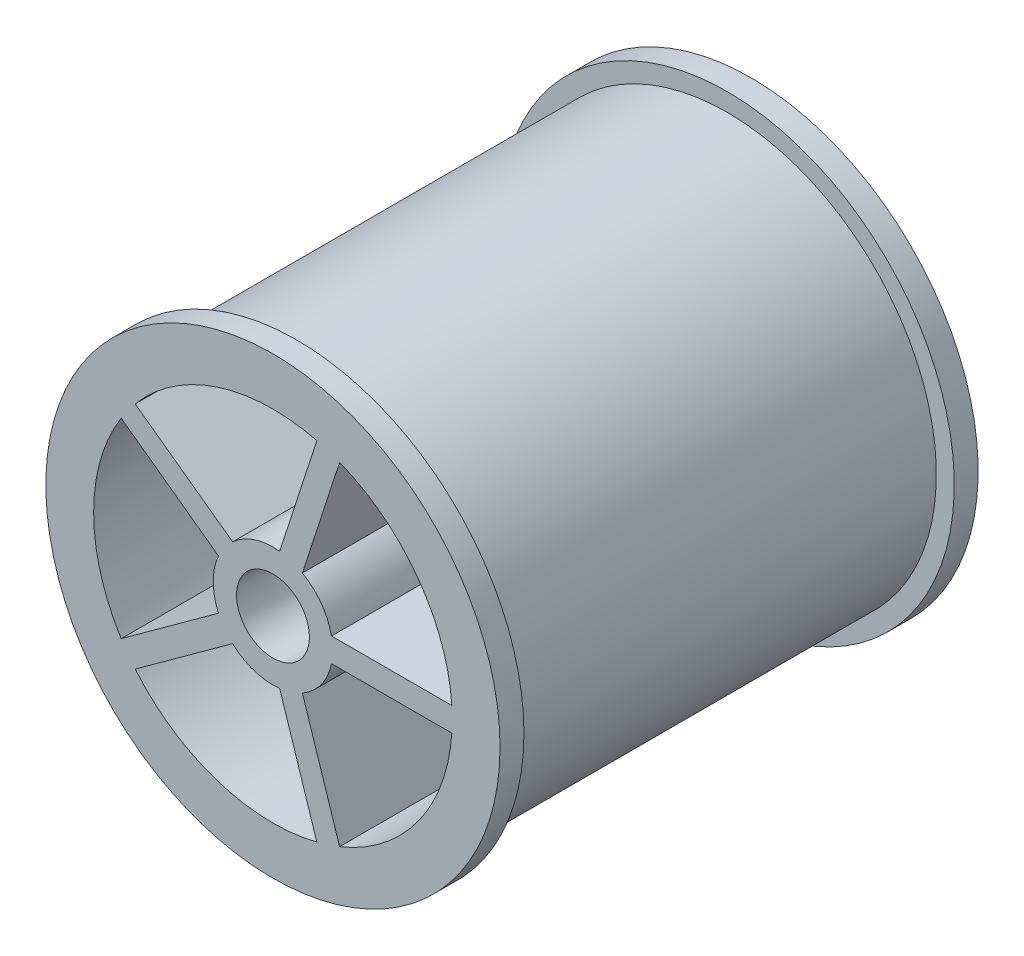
ISO-10303-21;
HEADER;
FILE_DESCRIPTION(('STEP AP214'),'2;1');
FILE_NAME('part.step','',(''),(''),'','','');
FILE_SCHEMA(('AUTOMOTIVE_DESIGN { 1 0 10303 214 1 1 1 1 }'));
ENDSEC;
DATA;
#1=APPLICATION_CONTEXT('core data for automotive mechanical design processes');
#2=APPLICATION_PROTOCOL_DEFINITION('international standard','automotive_design',2000,#1);
#3=PRODUCT_CONTEXT('',#1,'mechanical');
#4=PRODUCT('Part','Part','',(#3));
#5=PRODUCT_RELATED_PRODUCT_CATEGORY('part','',(#4));
#6=PRODUCT_DEFINITION_FORMATION('','',#4);
#7=PRODUCT_DEFINITION_CONTEXT('part definition',#1,'design');
#8=PRODUCT_DEFINITION('design','',#6,#7);
#9=PRODUCT_DEFINITION_SHAPE('','',#8);
#10=(LENGTH_UNIT() NAMED_UNIT(*) SI_UNIT(.MILLI.,.METRE.));
#11=(NAMED_UNIT(*) PLANE_ANGLE_UNIT() SI_UNIT($,.RADIAN.));
#12=(NAMED_UNIT(*) SI_UNIT($,.STERADIAN.) SOLID_ANGLE_UNIT());
#13=UNCERTAINTY_MEASURE_WITH_UNIT(LENGTH_MEASURE(1.E-05),#10,'distance_accuracy_value','');
#14=(GEOMETRIC_REPRESENTATION_CONTEXT(3) GLOBAL_UNCERTAINTY_ASSIGNED_CONTEXT((#13)) GLOBAL_UNIT_ASSIGNED_CONTEXT((#10,
#11,#12)) REPRESENTATION_CONTEXT('',''));
#15=CARTESIAN_POINT('',(0.,0.,0.));
#16=DIRECTION('',(0.,0.,1.));
#17=DIRECTION('',(1.,0.,0.));
#18=AXIS2_PLACEMENT_3D('',#15,#16,#17);
#19=CARTESIAN_POINT('',(0.,0.,0.));
#20=DIRECTION('',(0.,0.,1.));
#21=DIRECTION('',(1.,0.,0.));
#22=AXIS2_PLACEMENT_3D('',#19,#20,#21);
#23=PLANE('',#22);
#24=CARTESIAN_POINT('',(0.,0.,0.));
#25=DIRECTION('',(0.,0.,1.));
#26=DIRECTION('',(1.,0.,0.));
#27=AXIS2_PLACEMENT_3D('',#24,#25,#26);
#28=CIRCLE('',#27,6.3);
#29=CARTESIAN_POINT('',(6.3,0.,0.));
#30=VERTEX_POINT('',#29);
#31=EDGE_CURVE('E11',#30,#30,#28,.T.);
#32=ORIENTED_EDGE('',*,*,#31,.T.);
#33=EDGE_LOOP('',(#32));
#34=FACE_BOUND('',#33,.T.);
#35=CARTESIAN_POINT('',(0.,0.,0.));
#36=DIRECTION('',(0.,0.,-1.));
#37=DIRECTION('',(-1.,0.,0.));
#38=AXIS2_PLACEMENT_3D('',#35,#36,#37);
#39=CIRCLE('',#38,19.);
#40=CARTESIAN_POINT('',(-19.,0.,0.));
#41=VERTEX_POINT('',#40);
#42=EDGE_CURVE('E661',#41,#41,#39,.T.);
#43=ORIENTED_EDGE('',*,*,#42,.T.);
#44=EDGE_LOOP('',(#43));
#45=FACE_BOUND('',#44,.T.);
#46=ADVANCED_FACE('F35',(#34,#45),#23,.F.);
#47=CARTESIAN_POINT('',(0.,0.,2.5));
#48=DIRECTION('',(0.,0.,1.));
#49=DIRECTION('',(1.,0.,0.));
#50=AXIS2_PLACEMENT_3D('',#47,#48,#49);
#51=PLANE('',#50);
#52=DIRECTION('',(-0.309016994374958,0.95105651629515,0.));
#53=VECTOR('',#52,1.);
#54=CARTESIAN_POINT('',(3.96565107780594,-15.4410870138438,2.49999999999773));
#55=LINE('',#54,#53);
#56=CARTESIAN_POINT('',(2.43405505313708,-10.7273191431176,2.5));
#57=VERTEX_POINT('',#56);
#58=CARTESIAN_POINT('',(1.81287550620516,-8.81552507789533,2.5));
#59=VERTEX_POINT('',#58);
#60=EDGE_CURVE('E418',#57,#59,#55,.T.);
#61=ORIENTED_EDGE('',*,*,#60,.T.);
#62=CARTESIAN_POINT('',(0.,0.,2.5));
#63=DIRECTION('',(0.,0.,1.));
#64=DIRECTION('',(1.,0.,0.));
#65=AXIS2_PLACEMENT_3D('',#62,#63,#64);
#66=CIRCLE('',#65,9.);
#67=CARTESIAN_POINT('',(-6.64828272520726,-6.06632811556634,2.5));
#68=VERTEX_POINT('',#67);
#69=EDGE_CURVE('E702',#59,#68,#66,.F.);
#70=ORIENTED_EDGE('',*,*,#69,.T.);
#71=DIRECTION('',(-0.809016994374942,-0.58778525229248,0.));
#72=VECTOR('',#71,1.);
#73=CARTESIAN_POINT('',(-12.2843223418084,-10.1611505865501,2.49999999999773));
#74=LINE('',#73,#72);
#75=CARTESIAN_POINT('',(-8.27455189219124,-7.24788182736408,2.5));
#76=VERTEX_POINT('',#75);
#77=EDGE_CURVE('E961',#68,#76,#74,.T.);
#78=ORIENTED_EDGE('',*,*,#77,.T.);
#79=CARTESIAN_POINT('',(0.,0.,2.5));
#80=DIRECTION('',(0.,0.,1.));
#81=DIRECTION('',(1.,0.,0.));
#82=AXIS2_PLACEMENT_3D('',#79,#80,#81);
#83=CIRCLE('',#82,11.);
#84=EDGE_CURVE('E1052',#76,#57,#83,.T.);
#85=ORIENTED_EDGE('',*,*,#84,.T.);
#86=EDGE_LOOP('',(#61,#70,#78,#85));
#87=FACE_BOUND('',#86,.T.);
#88=ADVANCED_FACE('F770',(#87),#51,.T.);
#89=CARTESIAN_POINT('',(0.,0.,40.));
#90=DIRECTION('',(0.,0.,-1.));
#91=DIRECTION('',(-1.,0.,0.));
#92=AXIS2_PLACEMENT_3D('',#89,#90,#91);
#93=CYLINDRICAL_SURFACE('',#92,15.);
#94=DIRECTION('',(0.,0.,-1.));
#95=VECTOR('',#94,1.);
#96=CARTESIAN_POINT('',(3.67388636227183,-14.5431275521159,40.));
#97=LINE('',#96,#95);
#98=CARTESIAN_POINT('',(3.67388636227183,-14.5431275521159,40.));
#99=VERTEX_POINT('',#98);
#100=CARTESIAN_POINT('',(3.67388636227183,-14.5431275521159,6.5));
#101=VERTEX_POINT('',#100);
#102=EDGE_CURVE('E421',#99,#101,#97,.T.);
#103=ORIENTED_EDGE('',*,*,#102,.T.);
#104=CARTESIAN_POINT('',(0.,0.,6.5));
#105=DIRECTION('',(0.,0.,1.));
#106=DIRECTION('',(1.,0.,0.));
#107=AXIS2_PLACEMENT_3D('',#104,#105,#106);
#108=CIRCLE('',#107,15.);
#109=CARTESIAN_POINT('',(-11.5204723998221,-9.60618111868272,6.5));
#110=VERTEX_POINT('',#109);
#111=EDGE_CURVE('E58',#101,#110,#108,.F.);
#112=ORIENTED_EDGE('',*,*,#111,.T.);
#113=DIRECTION('',(0.,0.,-1.));
#114=VECTOR('',#113,1.);
#115=CARTESIAN_POINT('',(-11.5204723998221,-9.60618111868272,40.));
#116=LINE('',#115,#114);
#117=CARTESIAN_POINT('',(-11.5204723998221,-9.60618111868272,40.));
#118=VERTEX_POINT('',#117);
#119=EDGE_CURVE('E969',#110,#118,#116,.F.);
#120=ORIENTED_EDGE('',*,*,#119,.T.);
#121=CARTESIAN_POINT('',(0.,0.,40.));
#122=DIRECTION('',(0.,0.,1.));
#123=DIRECTION('',(1.,0.,0.));
#124=AXIS2_PLACEMENT_3D('',#121,#122,#123);
#125=CIRCLE('',#124,15.);
#126=EDGE_CURVE('E651',#99,#118,#125,.F.);
#127=ORIENTED_EDGE('',*,*,#126,.F.);
#128=EDGE_LOOP('',(#103,#112,#120,#127));
#129=FACE_BOUND('',#128,.T.);
#130=ADVANCED_FACE('F777',(#129),#93,.F.);
#131=CARTESIAN_POINT('',(0.,0.,5.));
#132=DIRECTION('',(0.,0.,-1.));
#133=DIRECTION('',(-1.,0.,0.));
#134=AXIS2_PLACEMENT_3D('',#131,#132,#133);
#135=CYLINDRICAL_SURFACE('',#134,5.05);
#136=DIRECTION('',(0.,0.,-1.));
#137=VECTOR('',#136,1.);
#138=CARTESIAN_POINT('',(0.578577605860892,-5.01674675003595,5.));
#139=LINE('',#138,#137);
#140=CARTESIAN_POINT('',(0.578577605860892,-5.01674675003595,5.86952398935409));
#141=VERTEX_POINT('',#140);
#142=CARTESIAN_POINT('',(0.578577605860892,-5.01674675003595,7.5));
#143=VERTEX_POINT('',#142);
#144=EDGE_CURVE('E422',#141,#143,#139,.F.);
#145=ORIENTED_EDGE('',*,*,#144,.T.);
#146=CARTESIAN_POINT('',(0.,0.,7.5));
#147=DIRECTION('',(0.,0.,-1.));
#148=DIRECTION('',(-1.,0.,0.));
#149=AXIS2_PLACEMENT_3D('',#146,#147,#148);
#150=CIRCLE('',#149,5.05);
#151=CARTESIAN_POINT('',(-3.41684886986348,-3.71855399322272,7.5));
#152=VERTEX_POINT('',#151);
#153=EDGE_CURVE('E640',#143,#152,#150,.T.);
#154=ORIENTED_EDGE('',*,*,#153,.T.);
#155=DIRECTION('',(0.,0.,-1.));
#156=VECTOR('',#155,1.);
#157=CARTESIAN_POINT('',(-3.41684886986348,-3.71855399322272,5.));
#158=LINE('',#157,#156);
#159=CARTESIAN_POINT('',(-3.41684886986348,-3.71855399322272,5.86952398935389));
#160=VERTEX_POINT('',#159);
#161=EDGE_CURVE('E970',#152,#160,#158,.T.);
#162=ORIENTED_EDGE('',*,*,#161,.T.);
#163=CARTESIAN_POINT('',(0.,0.,5.86952398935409));
#164=DIRECTION('',(0.,0.,1.));
#165=DIRECTION('',(1.,0.,0.));
#166=AXIS2_PLACEMENT_3D('',#163,#164,#165);
#167=CIRCLE('',#166,5.05);
#168=EDGE_CURVE('E749',#160,#141,#167,.T.);
#169=ORIENTED_EDGE('',*,*,#168,.T.);
#170=EDGE_LOOP('',(#145,#154,#162,#169));
#171=FACE_BOUND('',#170,.T.);
#172=ADVANCED_FACE('F833',(#171),#135,.T.);
#173=CARTESIAN_POINT('',(0.,0.,7.5));
#174=DIRECTION('',(0.,0.,-1.));
#175=DIRECTION('',(-1.,0.,0.));
#176=AXIS2_PLACEMENT_3D('',#173,#174,#175);
#177=PLANE('',#176);
#178=ORIENTED_EDGE('',*,*,#153,.F.);
#179=DIRECTION('',(0.309016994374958,-0.95105651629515,0.));
#180=VECTOR('',#179,1.);
#181=CARTESIAN_POINT('',(3.96565107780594,-15.4410870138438,7.49999999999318));
#182=LINE('',#181,#180);
#183=CARTESIAN_POINT('',(0.562811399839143,-4.9682233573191,7.5));
#184=VERTEX_POINT('',#183);
#185=EDGE_CURVE('E416',#184,#143,#182,.T.);
#186=ORIENTED_EDGE('',*,*,#185,.F.);
#187=CARTESIAN_POINT('',(0.,0.,7.5));
#188=DIRECTION('',(0.,0.,-1.));
#189=DIRECTION('',(-1.,0.,0.));
#190=AXIS2_PLACEMENT_3D('',#187,#188,#189);
#191=CIRCLE('',#190,5.);
#192=CARTESIAN_POINT('',(-3.37557240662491,-3.68856488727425,7.5));
#193=VERTEX_POINT('',#192);
#194=EDGE_CURVE('E694',#184,#193,#191,.T.);
#195=ORIENTED_EDGE('',*,*,#194,.T.);
#196=DIRECTION('',(0.809016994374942,0.58778525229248,0.));
#197=VECTOR('',#196,1.);
#198=CARTESIAN_POINT('',(-12.2843223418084,-10.1611505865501,7.49999999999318));
#199=LINE('',#198,#197);
#200=EDGE_CURVE('E974',#152,#193,#199,.T.);
#201=ORIENTED_EDGE('',*,*,#200,.F.);
#202=EDGE_LOOP('',(#178,#186,#195,#201));
#203=FACE_BOUND('',#202,.T.);
#204=ADVANCED_FACE('F819',(#203),#177,.F.);
#205=CARTESIAN_POINT('',(0.,0.,-11.642135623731));
#206=DIRECTION('',(0.,0.,1.));
#207=DIRECTION('',(1.,0.,0.));
#208=AXIS2_PLACEMENT_3D('',#205,#206,#207);
#209=CYLINDRICAL_SURFACE('',#208,5.);
#210=DIRECTION('',(0.,0.,1.));
#211=VECTOR('',#210,1.);
#212=CARTESIAN_POINT('',(0.562811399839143,-4.9682233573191,-11.642135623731));
#213=LINE('',#212,#211);
#214=CARTESIAN_POINT('',(0.562811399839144,-4.9682233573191,40.));
#215=VERTEX_POINT('',#214);
#216=EDGE_CURVE('E410',#184,#215,#213,.T.);
#217=ORIENTED_EDGE('',*,*,#216,.T.);
#218=CARTESIAN_POINT('',(0.,0.,40.));
#219=DIRECTION('',(0.,0.,1.));
#220=DIRECTION('',(1.,0.,0.));
#221=AXIS2_PLACEMENT_3D('',#218,#219,#220);
#222=CIRCLE('',#221,5.);
#223=CARTESIAN_POINT('',(-3.37557240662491,-3.68856488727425,40.));
#224=VERTEX_POINT('',#223);
#225=EDGE_CURVE('E1029',#224,#215,#222,.T.);
#226=ORIENTED_EDGE('',*,*,#225,.F.);
#227=DIRECTION('',(0.,0.,1.));
#228=VECTOR('',#227,1.);
#229=CARTESIAN_POINT('',(-3.37557240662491,-3.68856488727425,-11.642135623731));
#230=LINE('',#229,#228);
#231=EDGE_CURVE('E996',#224,#193,#230,.F.);
#232=ORIENTED_EDGE('',*,*,#231,.T.);
#233=ORIENTED_EDGE('',*,*,#194,.F.);
#234=EDGE_LOOP('',(#217,#226,#232,#233));
#235=FACE_BOUND('',#234,.T.);
#236=ADVANCED_FACE('F827',(#235),#209,.T.);
#237=CARTESIAN_POINT('',(0.,0.,6.5));
#238=DIRECTION('',(0.,0.,1.));
#239=DIRECTION('',(1.,0.,0.));
#240=AXIS2_PLACEMENT_3D('',#237,#238,#239);
#241=TOROIDAL_SURFACE('',#240,9.,4.);
#242=ORIENTED_EDGE('',*,*,#69,.F.);
#243=CARTESIAN_POINT('',(0.56281140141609,-4.96822336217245,6.5002));
#244=CARTESIAN_POINT('',(0.562805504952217,-4.96820521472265,6.38900610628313));
#245=CARTESIAN_POINT('',(0.564270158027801,-4.97271295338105,6.27781846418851));
#246=CARTESIAN_POINT('',(0.570108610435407,-4.99068186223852,6.05625838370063));
#247=CARTESIAN_POINT('',(0.574482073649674,-5.00414199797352,5.9458858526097));
#248=CARTESIAN_POINT('',(0.586097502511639,-5.03989061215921,5.7268967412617));
#249=CARTESIAN_POINT('',(0.593335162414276,-5.06216583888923,5.61827777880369));
#250=CARTESIAN_POINT('',(0.610610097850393,-5.11533262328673,5.40342803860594));
#251=CARTESIAN_POINT('',(0.620647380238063,-5.14622420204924,5.2971972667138));
#252=CARTESIAN_POINT('',(0.654851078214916,-5.25149236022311,4.98317348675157));
#253=CARTESIAN_POINT('',(0.683118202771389,-5.33848962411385,4.77988360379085));
#254=CARTESIAN_POINT('',(0.749660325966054,-5.54328522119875,4.39139107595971));
#255=CARTESIAN_POINT('',(0.787936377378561,-5.66108679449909,4.20619033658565));
#256=CARTESIAN_POINT('',(0.873883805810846,-5.92560578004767,3.85657933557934));
#257=CARTESIAN_POINT('',(0.921661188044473,-6.07264944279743,3.69244158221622));
#258=CARTESIAN_POINT('',(1.02494633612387,-6.39052844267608,3.39198318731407));
#259=CARTESIAN_POINT('',(1.08045509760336,-6.56136684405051,3.25566613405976));
#260=CARTESIAN_POINT('',(1.19851721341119,-6.92472467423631,3.01274967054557));
#261=CARTESIAN_POINT('',(1.26116168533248,-7.11752453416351,2.90661380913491));
#262=CARTESIAN_POINT('',(1.39104521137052,-7.51726492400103,2.72976272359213));
#263=CARTESIAN_POINT('',(1.45828323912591,-7.72420229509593,2.65903961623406));
#264=CARTESIAN_POINT('',(1.58345974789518,-8.10945597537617,2.56412911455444));
#265=CARTESIAN_POINT('',(1.64096945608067,-8.28645265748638,2.5339684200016));
#266=CARTESIAN_POINT('',(1.72773847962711,-8.55350025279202,2.50828509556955));
#267=CARTESIAN_POINT('',(1.75674580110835,-8.64277560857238,2.50298364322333));
#268=CARTESIAN_POINT('',(1.814808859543,-8.82147532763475,2.49891506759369));
#269=CARTESIAN_POINT('',(1.84386460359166,-8.91089971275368,2.50014900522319));
#270=CARTESIAN_POINT('',(1.87288002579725,-9.0002,2.50465891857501));
#271=B_SPLINE_CURVE_WITH_KNOTS('',3,(#243,#244,#245,#246,#247,#248,#249,#250,#251,#252,#253,
#254,#255,#256,#257,#258,#259,#260,#261,#262,#263,#264,#265,#266,#267,#268,#269,#270),
.UNSPECIFIED.,.F.,.F.,(4,2,2,2,2,2,2,2,2,2,2,2,2,4),(0.,0.33346908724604,0.666899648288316,
0.999830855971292,1.33276287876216,1.99812963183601,2.66356639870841,3.33689215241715,
4.01030469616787,4.69356133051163,5.37666579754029,5.9403697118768,6.2222262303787,
6.5041285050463),.UNSPECIFIED.);
#272=EDGE_CURVE('E408',#141,#59,#271,.T.);
#273=ORIENTED_EDGE('',*,*,#272,.F.);
#274=ORIENTED_EDGE('',*,*,#168,.F.);
#275=CARTESIAN_POINT('',(-9.0002,-7.77509603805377,3.73819511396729));
#276=CARTESIAN_POINT('',(-8.93699739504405,-7.72917665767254,3.65661883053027));
#277=CARTESIAN_POINT('',(-8.87098922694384,-7.68121891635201,3.5783681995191));
#278=CARTESIAN_POINT('',(-8.73387127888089,-7.58159689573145,3.42903514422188));
#279=CARTESIAN_POINT('',(-8.66276185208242,-7.52993287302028,3.35795222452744));
#280=CARTESIAN_POINT('',(-8.51600869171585,-7.42331046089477,3.22352114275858));
#281=CARTESIAN_POINT('',(-8.44036913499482,-7.36835510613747,3.16016601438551));
#282=CARTESIAN_POINT('',(-8.285044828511,-7.25550539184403,3.041555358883));
#283=CARTESIAN_POINT('',(-8.20536010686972,-7.19761105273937,2.9862997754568));
#284=CARTESIAN_POINT('',(-8.04249147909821,-7.07928006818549,2.88426084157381));
#285=CARTESIAN_POINT('',(-7.9593069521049,-7.01884297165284,2.83747900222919));
#286=CARTESIAN_POINT('',(-7.7900456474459,-6.89586743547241,2.75270857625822));
#287=CARTESIAN_POINT('',(-7.70396781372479,-6.83332822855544,2.71472324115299));
#288=CARTESIAN_POINT('',(-7.44238944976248,-6.64328042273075,2.61443201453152));
#289=CARTESIAN_POINT('',(-7.26334666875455,-6.51319822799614,2.56566758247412));
#290=CARTESIAN_POINT('',(-6.90065318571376,-6.24968598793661,2.50566475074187));
#291=CARTESIAN_POINT('',(-6.71698854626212,-6.11624581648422,2.49455832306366));
#292=CARTESIAN_POINT('',(-6.35068949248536,-5.85011397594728,2.51038320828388));
#293=CARTESIAN_POINT('',(-6.16805523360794,-5.71742241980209,2.53732011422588));
#294=CARTESIAN_POINT('',(-5.80798120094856,-5.45581332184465,2.62866008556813));
#295=CARTESIAN_POINT('',(-5.63057561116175,-5.32692061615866,2.69326886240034));
#296=CARTESIAN_POINT('',(-5.28699000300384,-5.07729105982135,2.85822316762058));
#297=CARTESIAN_POINT('',(-5.12081044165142,-4.95655454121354,2.95857014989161));
#298=CARTESIAN_POINT('',(-4.80367206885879,-4.72614002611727,3.19268795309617));
#299=CARTESIAN_POINT('',(-4.65278120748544,-4.61651139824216,3.32659952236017));
#300=CARTESIAN_POINT('',(-4.37139081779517,-4.41206931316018,3.62384487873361));
#301=CARTESIAN_POINT('',(-4.24088936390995,-4.31725445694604,3.78717588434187));
#302=CARTESIAN_POINT('',(-4.00431212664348,-4.14537103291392,4.13852880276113));
#303=CARTESIAN_POINT('',(-3.89818584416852,-4.06826577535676,4.32649837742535));
#304=CARTESIAN_POINT('',(-3.75962607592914,-3.96759621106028,4.62292621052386));
#305=CARTESIAN_POINT('',(-3.71686016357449,-3.93652495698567,4.72420663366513));
#306=CARTESIAN_POINT('',(-3.63852069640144,-3.87960800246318,4.9309185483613));
#307=CARTESIAN_POINT('',(-3.60294435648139,-3.85376027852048,5.03634841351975));
#308=CARTESIAN_POINT('',(-3.53894692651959,-3.80726342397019,5.2517420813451));
#309=CARTESIAN_POINT('',(-3.51060586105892,-3.78667243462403,5.36174215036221));
#310=CARTESIAN_POINT('',(-3.46182323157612,-3.75122977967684,5.58439084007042));
#311=CARTESIAN_POINT('',(-3.44138172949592,-3.73637815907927,5.69703948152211));
#312=CARTESIAN_POINT('',(-3.40856432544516,-3.71253491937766,5.92431313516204));
#313=CARTESIAN_POINT('',(-3.39620199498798,-3.70355316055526,6.03894114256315));
#314=CARTESIAN_POINT('',(-3.37969626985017,-3.69156104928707,6.26911140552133));
#315=CARTESIAN_POINT('',(-3.37555389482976,-3.68855143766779,6.38465377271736));
#316=CARTESIAN_POINT('',(-3.37557241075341,-3.68856489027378,6.5002));
#317=B_SPLINE_CURVE_WITH_KNOTS('',3,(#275,#276,#277,#278,#279,#280,#281,#282,#283,#284,#285,
#286,#287,#288,#289,#290,#291,#292,#293,#294,#295,#296,#297,#298,#299,#300,#301,#302,#303,#304,
#305,#306,#307,#308,#309,#310,#311,#312,#313,#314,#315,#316),.UNSPECIFIED.,.F.,.F.,(4,2,2,2,2,2,
2,2,2,2,2,2,2,2,2,2,2,2,2,2,4),(0.,0.338746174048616,0.677468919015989,1.01588402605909,
1.35429678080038,1.69276982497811,2.03136778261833,2.70775384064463,3.38650784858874,
4.06536165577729,4.74795760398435,5.43058132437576,6.11611687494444,6.80158764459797,
7.48562522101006,7.82801583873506,8.17027356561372,8.51616708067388,8.86206330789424,
9.20853909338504,9.55505785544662),.UNSPECIFIED.);
#318=EDGE_CURVE('E449',#68,#160,#317,.T.);
#319=ORIENTED_EDGE('',*,*,#318,.F.);
#320=EDGE_LOOP('',(#242,#273,#274,#319));
#321=FACE_BOUND('',#320,.T.);
#322=ADVANCED_FACE('F737',(#321),#241,.F.);
#323=CARTESIAN_POINT('',(0.,0.,6.5));
#324=DIRECTION('',(0.,0.,1.));
#325=DIRECTION('',(1.,0.,0.));
#326=AXIS2_PLACEMENT_3D('',#323,#324,#325);
#327=TOROIDAL_SURFACE('',#326,11.,4.);
#328=ORIENTED_EDGE('',*,*,#111,.F.);
#329=CARTESIAN_POINT('',(1.18987602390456,-6.89812982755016,6.5002));
#330=CARTESIAN_POINT('',(1.18987058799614,-6.89811309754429,6.38840751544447));
#331=CARTESIAN_POINT('',(1.19133574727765,-6.90262239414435,6.27662050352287));
#332=CARTESIAN_POINT('',(1.1971787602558,-6.92060533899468,6.05385497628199));
#333=CARTESIAN_POINT('',(1.20155638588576,-6.93407828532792,5.94287639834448));
#334=CARTESIAN_POINT('',(1.21318967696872,-6.96988187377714,5.72262428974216));
#335=CARTESIAN_POINT('',(1.22044228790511,-6.99220311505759,5.61334907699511));
#336=CARTESIAN_POINT('',(1.23776206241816,-7.04550789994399,5.39719220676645));
#337=CARTESIAN_POINT('',(1.2478292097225,-7.07649139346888,5.29031053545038));
#338=CARTESIAN_POINT('',(1.28215861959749,-7.18214645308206,4.97431813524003));
#339=CARTESIAN_POINT('',(1.31055563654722,-7.26954348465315,4.76973246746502));
#340=CARTESIAN_POINT('',(1.37748304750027,-7.47552487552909,4.37890392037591));
#341=CARTESIAN_POINT('',(1.41601266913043,-7.59410685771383,4.19265964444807));
#342=CARTESIAN_POINT('',(1.50234560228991,-7.85981230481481,3.84244040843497));
#343=CARTESIAN_POINT('',(1.55020074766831,-8.00709529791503,3.67859905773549));
#344=CARTESIAN_POINT('',(1.65367635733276,-8.32556047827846,3.37896576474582));
#345=CARTESIAN_POINT('',(1.70929816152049,-8.49674678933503,3.24317867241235));
#346=CARTESIAN_POINT('',(1.82721377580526,-8.85965373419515,3.00242117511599));
#347=CARTESIAN_POINT('',(1.88955775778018,-9.05152878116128,2.8977080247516));
#348=CARTESIAN_POINT('',(2.01878033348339,-9.44923497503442,2.72352356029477));
#349=CARTESIAN_POINT('',(2.08565874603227,-9.65506556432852,2.65405083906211));
#350=CARTESIAN_POINT('',(2.22227178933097,-10.0755172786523,2.55214276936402));
#351=CARTESIAN_POINT('',(2.2920147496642,-10.2901640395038,2.51982471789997));
#352=CARTESIAN_POINT('',(2.43222682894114,-10.7216924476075,2.49361932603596));
#353=CARTESIAN_POINT('',(2.50269596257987,-10.9385741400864,2.49973276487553));
#354=CARTESIAN_POINT('',(2.60729364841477,-11.2604927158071,2.5375472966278));
#355=CARTESIAN_POINT('',(2.64197118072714,-11.3672191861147,2.55492246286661));
#356=CARTESIAN_POINT('',(2.71074580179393,-11.5788857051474,2.59908103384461));
#357=CARTESIAN_POINT('',(2.74484310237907,-11.6838264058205,2.62586092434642));
#358=CARTESIAN_POINT('',(2.81222587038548,-11.8912092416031,2.68866155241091));
#359=CARTESIAN_POINT('',(2.84551104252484,-11.9936504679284,2.72468559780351));
#360=CARTESIAN_POINT('',(2.91100855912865,-12.1952310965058,2.80570374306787));
#361=CARTESIAN_POINT('',(2.94322130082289,-12.2943717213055,2.85069447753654));
#362=CARTESIAN_POINT('',(3.00626457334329,-12.4883989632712,2.94919969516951));
#363=CARTESIAN_POINT('',(3.03709875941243,-12.5832968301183,3.00268968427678));
#364=CARTESIAN_POINT('',(3.0972492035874,-12.7684208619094,3.11788727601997));
#365=CARTESIAN_POINT('',(3.1265660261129,-12.8586487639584,3.17959179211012));
#366=CARTESIAN_POINT('',(3.18349202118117,-13.0338489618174,3.31081927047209));
#367=CARTESIAN_POINT('',(3.2111006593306,-13.1188196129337,3.38034466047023));
#368=CARTESIAN_POINT('',(3.26439123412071,-13.2828311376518,3.52667822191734));
#369=CARTESIAN_POINT('',(3.29007388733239,-13.3618742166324,3.60348366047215));
#370=CARTESIAN_POINT('',(3.33926259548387,-13.5132614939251,3.76360639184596));
#371=CARTESIAN_POINT('',(3.36277509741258,-13.5856255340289,3.8469029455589));
#372=CARTESIAN_POINT('',(3.40753472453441,-13.7233815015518,4.01959025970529));
#373=CARTESIAN_POINT('',(3.42878269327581,-13.7887760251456,4.10897873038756));
#374=CARTESIAN_POINT('',(3.46888392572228,-13.9121949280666,4.29330493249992));
#375=CARTESIAN_POINT('',(3.48773555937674,-13.9702142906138,4.38824637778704));
#376=CARTESIAN_POINT('',(3.52288467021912,-14.0783921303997,4.58291042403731));
#377=CARTESIAN_POINT('',(3.53918309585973,-14.1285535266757,4.682631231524));
#378=CARTESIAN_POINT('',(3.56909309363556,-14.2206070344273,4.88601502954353));
#379=CARTESIAN_POINT('',(3.58270883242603,-14.2625119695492,4.98967160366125));
#380=CARTESIAN_POINT('',(3.60718251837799,-14.3378342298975,5.20029581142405));
#381=CARTESIAN_POINT('',(3.6180415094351,-14.3712547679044,5.30726217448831));
#382=CARTESIAN_POINT('',(3.63691969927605,-14.4293558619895,5.523657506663));
#383=CARTESIAN_POINT('',(3.64494201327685,-14.4540460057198,5.6330836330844));
#384=CARTESIAN_POINT('',(3.65810279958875,-14.4945507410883,5.85369229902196));
#385=CARTESIAN_POINT('',(3.66324268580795,-14.510369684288,5.96487394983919));
#386=CARTESIAN_POINT('',(3.6692463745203,-14.5288471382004,6.14694638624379));
#387=CARTESIAN_POINT('',(3.67098842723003,-14.534208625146,6.21754610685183));
#388=CARTESIAN_POINT('',(3.67330813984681,-14.5413479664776,6.35882814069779));
#389=CARTESIAN_POINT('',(3.67388772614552,-14.5431317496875,6.4295101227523));
#390=CARTESIAN_POINT('',(3.6738863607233,-14.54312754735,6.5002));
#391=B_SPLINE_CURVE_WITH_KNOTS('',3,(#329,#330,#331,#332,#333,#334,#335,#336,#337,#338,#339,
#340,#341,#342,#343,#344,#345,#346,#347,#348,#349,#350,#351,#352,#353,#354,#355,#356,#357,#358,
#359,#360,#361,#362,#363,#364,#365,#366,#367,#368,#369,#370,#371,#372,#373,#374,#375,#376,#377,
#378,#379,#380,#381,#382,#383,#384,#385,#386,#387,#388,#389,#390),.UNSPECIFIED.,.F.,.F.,(4,2,2,
2,2,2,2,2,2,2,2,2,2,2,2,2,2,2,2,2,2,2,2,2,2,2,2,2,2,2,4),(0.,0.335266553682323,0.67050685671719,
1.00539193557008,1.34027507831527,2.00965796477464,2.67898984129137,3.35215400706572,
4.02543445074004,4.70414257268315,5.38282359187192,6.0636413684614,6.74447294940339,
7.08480842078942,7.4250168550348,7.76534719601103,8.10555004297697,8.44478966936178,
8.78390218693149,9.12312026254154,9.46221149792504,9.80026056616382,10.1381832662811,
10.4763346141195,10.8143600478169,11.151856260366,11.4892244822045,11.8262210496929,
12.1630521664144,12.3754331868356,12.5874619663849),.UNSPECIFIED.);
#392=EDGE_CURVE('E402',#57,#101,#391,.T.);
#393=ORIENTED_EDGE('',*,*,#392,.F.);
#394=ORIENTED_EDGE('',*,*,#84,.F.);
#395=CARTESIAN_POINT('',(-11.520472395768,-9.60618111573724,6.5002));
#396=CARTESIAN_POINT('',(-11.520485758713,-9.60619082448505,6.38789374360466));
#397=CARTESIAN_POINT('',(-11.5166465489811,-9.60340147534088,6.27559241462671));
#398=CARTESIAN_POINT('',(-11.5013311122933,-9.59227415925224,6.0517938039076));
#399=CARTESIAN_POINT('',(-11.4898552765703,-9.58393647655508,5.94029648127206));
#400=CARTESIAN_POINT('',(-11.4593462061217,-9.56177033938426,5.71897185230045));
#401=CARTESIAN_POINT('',(-11.4403186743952,-9.54794602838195,5.60914335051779));
#402=CARTESIAN_POINT('',(-11.3948619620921,-9.51491979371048,5.39188510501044));
#403=CARTESIAN_POINT('',(-11.3684328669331,-9.49571793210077,5.28445533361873));
#404=CARTESIAN_POINT('',(-11.2782613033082,-9.43020445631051,4.96680718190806));
#405=CARTESIAN_POINT('',(-11.2036210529,-9.37597514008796,4.76113254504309));
#406=CARTESIAN_POINT('',(-11.0275370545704,-9.24804262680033,4.36832904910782));
#407=CARTESIAN_POINT('',(-10.9260982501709,-9.17434302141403,4.18119677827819));
#408=CARTESIAN_POINT('',(-10.699183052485,-9.00947948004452,3.83041530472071));
#409=CARTESIAN_POINT('',(-10.5736868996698,-8.9183011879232,3.66678560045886));
#410=CARTESIAN_POINT('',(-10.3022768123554,-8.72111021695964,3.36780837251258));
#411=CARTESIAN_POINT('',(-10.1563596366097,-8.61509518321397,3.23246534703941));
#412=CARTESIAN_POINT('',(-9.84794111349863,-8.39101600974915,2.99360769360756));
#413=CARTESIAN_POINT('',(-9.68540561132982,-8.2729270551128,2.89016044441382));
#414=CARTESIAN_POINT('',(-9.34863288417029,-8.02824734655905,2.71835511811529));
#415=CARTESIAN_POINT('',(-9.17439623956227,-7.90165701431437,2.64999530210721));
#416=CARTESIAN_POINT('',(-8.81858623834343,-7.64314591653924,2.55006316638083));
#417=CARTESIAN_POINT('',(-8.63699195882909,-7.51120994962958,2.51860467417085));
#418=CARTESIAN_POINT('',(-8.27210121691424,-7.246101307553,2.49367947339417));
#419=CARTESIAN_POINT('',(-8.08880468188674,-7.11292857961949,2.50021439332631));
#420=CARTESIAN_POINT('',(-7.72505108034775,-6.8486461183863,2.55112710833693));
#421=CARTESIAN_POINT('',(-7.54460581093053,-6.7175449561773,2.59563371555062));
#422=CARTESIAN_POINT('',(-7.19229244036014,-6.46157430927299,2.72136525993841));
#423=CARTESIAN_POINT('',(-7.02042448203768,-6.33670492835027,2.80259080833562));
#424=CARTESIAN_POINT('',(-6.68971291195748,-6.09642890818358,2.9997145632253));
#425=CARTESIAN_POINT('',(-6.53090180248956,-5.98104588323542,3.11569614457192));
#426=CARTESIAN_POINT('',(-6.23132211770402,-5.76338850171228,3.37896354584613));
#427=CARTESIAN_POINT('',(-6.09055278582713,-5.66111359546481,3.52624805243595));
#428=CARTESIAN_POINT('',(-5.83120409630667,-5.47268574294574,3.84795458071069));
#429=CARTESIAN_POINT('',(-5.71259870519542,-5.38651388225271,4.02234431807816));
#430=CARTESIAN_POINT('',(-5.5539046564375,-5.27121590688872,4.30044715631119));
#431=CARTESIAN_POINT('',(-5.50418122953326,-5.23508972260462,4.39597299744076));
#432=CARTESIAN_POINT('',(-5.41148637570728,-5.1677429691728,4.59189187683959));
#433=CARTESIAN_POINT('',(-5.36851237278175,-5.13652052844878,4.69228303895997));
#434=CARTESIAN_POINT('',(-5.28985903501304,-5.07937553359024,4.89666660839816));
#435=CARTESIAN_POINT('',(-5.25414155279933,-5.0534252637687,5.00063663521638));
#436=CARTESIAN_POINT('',(-5.18999244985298,-5.00681821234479,5.2119134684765));
#437=CARTESIAN_POINT('',(-5.16155799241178,-4.986159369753,5.31921895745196));
#438=CARTESIAN_POINT('',(-5.1122094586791,-4.9503055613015,5.53629995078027));
#439=CARTESIAN_POINT('',(-5.09128652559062,-4.93510416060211,5.64607238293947));
#440=CARTESIAN_POINT('',(-5.05708633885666,-4.91025627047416,5.8673764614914));
#441=CARTESIAN_POINT('',(-5.04380519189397,-4.90060695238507,5.9789071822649));
#442=CARTESIAN_POINT('',(-5.02867544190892,-4.88961454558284,6.15894361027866));
#443=CARTESIAN_POINT('',(-5.02438549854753,-4.88649771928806,6.22714973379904));
#444=CARTESIAN_POINT('',(-5.01867282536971,-4.88234721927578,6.36363476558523));
#445=CARTESIAN_POINT('',(-5.0172454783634,-4.88131019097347,6.43191337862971));
#446=CARTESIAN_POINT('',(-5.01724890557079,-4.88131268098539,6.5002));
#447=B_SPLINE_CURVE_WITH_KNOTS('',3,(#395,#396,#397,#398,#399,#400,#401,#402,#403,#404,#405,
#406,#407,#408,#409,#410,#411,#412,#413,#414,#415,#416,#417,#418,#419,#420,#421,#422,#423,#424,
#425,#426,#427,#428,#429,#430,#431,#432,#433,#434,#435,#436,#437,#438,#439,#440,#441,#442,#443,
#444,#445,#446),.UNSPECIFIED.,.F.,.F.,(4,2,2,2,2,2,2,2,2,2,2,2,2,2,2,2,2,2,2,2,2,2,2,2,2,4),(0.,
0.33680900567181,0.673600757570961,1.01013864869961,1.34667265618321,2.01944789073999,
2.69209910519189,3.3653051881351,4.03861824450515,4.7133440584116,5.38803643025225,
6.06480456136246,6.74160170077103,7.42070392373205,8.09981745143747,8.78057329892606,
9.46130059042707,10.1412232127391,10.4816561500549,10.8219588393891,11.1604234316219,
11.4987559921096,11.8366883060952,12.1744482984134,12.3796003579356,12.5844212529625),.UNSPECIFIED.);
#448=EDGE_CURVE('E444',#110,#76,#447,.T.);
#449=ORIENTED_EDGE('',*,*,#448,.F.);
#450=EDGE_LOOP('',(#328,#393,#394,#449));
#451=FACE_BOUND('',#450,.T.);
#452=ADVANCED_FACE('F1065',(#451),#327,.F.);
#453=DIRECTION('',(0.809016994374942,0.58778525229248,0.));
#454=VECTOR('',#453,1.);
#455=CARTESIAN_POINT('',(-13.4598928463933,-8.54311659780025,2.49999999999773));
#456=LINE('',#455,#454);
#457=CARTESIAN_POINT('',(-9.4501223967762,-5.62984783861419,2.5));
#458=VERTEX_POINT('',#457);
#459=CARTESIAN_POINT('',(-7.82385322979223,-4.44829412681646,2.5));
#460=VERTEX_POINT('',#459);
#461=EDGE_CURVE('E988',#458,#460,#456,.T.);
#462=ORIENTED_EDGE('',*,*,#461,.T.);
#463=CARTESIAN_POINT('',(-7.82385322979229,4.44829412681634,2.5));
#464=VERTEX_POINT('',#463);
#465=EDGE_CURVE('E705',#460,#464,#66,.F.);
#466=ORIENTED_EDGE('',*,*,#465,.T.);
#467=DIRECTION('',(-0.809016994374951,0.587785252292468,0.));
#468=VECTOR('',#467,1.);
#469=CARTESIAN_POINT('',(-13.4598928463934,8.54311659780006,2.49999999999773));
#470=LINE('',#469,#468);
#471=CARTESIAN_POINT('',(-9.45012239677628,5.62984783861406,2.5));
#472=VERTEX_POINT('',#471);
#473=EDGE_CURVE('E485',#464,#472,#470,.T.);
#474=ORIENTED_EDGE('',*,*,#473,.T.);
#475=EDGE_CURVE('E1054',#472,#458,#83,.T.);
#476=ORIENTED_EDGE('',*,*,#475,.T.);
#477=EDGE_LOOP('',(#462,#466,#474,#476));
#478=FACE_BOUND('',#477,.T.);
#479=ADVANCED_FACE('F780',(#478),#51,.T.);
#480=DIRECTION('',(0.,0.,-1.));
#481=VECTOR('',#480,1.);
#482=CARTESIAN_POINT('',(-12.6960429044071,-7.98814712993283,40.));
#483=LINE('',#482,#481);
#484=CARTESIAN_POINT('',(-12.6960429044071,-7.98814712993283,40.));
#485=VERTEX_POINT('',#484);
#486=CARTESIAN_POINT('',(-12.6960429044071,-7.98814712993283,6.5));
#487=VERTEX_POINT('',#486);
#488=EDGE_CURVE('E432',#485,#487,#483,.T.);
#489=ORIENTED_EDGE('',*,*,#488,.T.);
#490=CARTESIAN_POINT('',(-12.6960429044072,7.98814712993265,6.5));
#491=VERTEX_POINT('',#490);
#492=EDGE_CURVE('E928',#487,#491,#108,.F.);
#493=ORIENTED_EDGE('',*,*,#492,.T.);
#494=DIRECTION('',(0.,0.,-1.));
#495=VECTOR('',#494,1.);
#496=CARTESIAN_POINT('',(-12.6960429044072,7.98814712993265,40.));
#497=LINE('',#496,#495);
#498=CARTESIAN_POINT('',(-12.6960429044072,7.98814712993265,40.));
#499=VERTEX_POINT('',#498);
#500=EDGE_CURVE('E909',#491,#499,#497,.F.);
#501=ORIENTED_EDGE('',*,*,#500,.T.);
#502=EDGE_CURVE('E1010',#485,#499,#125,.F.);
#503=ORIENTED_EDGE('',*,*,#502,.F.);
#504=EDGE_LOOP('',(#489,#493,#501,#503));
#505=FACE_BOUND('',#504,.T.);
#506=ADVANCED_FACE('F1074',(#505),#93,.F.);
#507=DIRECTION('',(0.,0.,1.));
#508=VECTOR('',#507,1.);
#509=CARTESIAN_POINT('',(-4.55114291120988,-2.07053089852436,-11.642135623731));
#510=LINE('',#509,#508);
#511=CARTESIAN_POINT('',(-4.55114291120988,-2.07053089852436,6.5));
#512=VERTEX_POINT('',#511);
#513=CARTESIAN_POINT('',(-4.55114291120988,-2.07053089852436,40.));
#514=VERTEX_POINT('',#513);
#515=EDGE_CURVE('E991',#512,#514,#510,.T.);
#516=ORIENTED_EDGE('',*,*,#515,.T.);
#517=CARTESIAN_POINT('',(-4.5511429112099,2.0705308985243,40.));
#518=VERTEX_POINT('',#517);
#519=EDGE_CURVE('E1027',#518,#514,#222,.T.);
#520=ORIENTED_EDGE('',*,*,#519,.F.);
#521=DIRECTION('',(0.,0.,1.));
#522=VECTOR('',#521,1.);
#523=CARTESIAN_POINT('',(-4.5511429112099,2.0705308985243,-11.642135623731));
#524=LINE('',#523,#522);
#525=CARTESIAN_POINT('',(-4.5511429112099,2.0705308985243,6.5));
#526=VERTEX_POINT('',#525);
#527=EDGE_CURVE('E512',#518,#526,#524,.F.);
#528=ORIENTED_EDGE('',*,*,#527,.T.);
#529=CARTESIAN_POINT('',(0.,0.,6.5));
#530=DIRECTION('',(0.,0.,1.));
#531=DIRECTION('',(1.,0.,0.));
#532=AXIS2_PLACEMENT_3D('',#529,#530,#531);
#533=CIRCLE('',#532,5.);
#534=EDGE_CURVE('E707',#526,#512,#533,.T.);
#535=ORIENTED_EDGE('',*,*,#534,.T.);
#536=EDGE_LOOP('',(#516,#520,#528,#535));
#537=FACE_BOUND('',#536,.T.);
#538=ADVANCED_FACE('F1128',(#537),#209,.T.);
#539=ORIENTED_EDGE('',*,*,#465,.F.);
#540=CARTESIAN_POINT('',(-4.55114291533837,-2.07053090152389,6.5002));
#541=CARTESIAN_POINT('',(-4.55112748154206,-2.0705196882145,6.38901141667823));
#542=CARTESIAN_POINT('',(-4.55496162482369,-2.07330535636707,6.27782908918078));
#543=CARTESIAN_POINT('',(-4.57024543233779,-2.08440969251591,6.05627950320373));
#544=CARTESIAN_POINT('',(-4.58169421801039,-2.09272772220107,5.94591215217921));
#545=CARTESIAN_POINT('',(-4.61210237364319,-2.11482054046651,5.72692272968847));
#546=CARTESIAN_POINT('',(-4.63105118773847,-2.12858765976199,5.61829842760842));
#547=CARTESIAN_POINT('',(-4.6762790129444,-2.1614475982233,5.40343819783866));
#548=CARTESIAN_POINT('',(-4.70255804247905,-2.18054043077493,5.29720227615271));
#549=CARTESIAN_POINT('',(-4.79210782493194,-2.24560215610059,4.9831668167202));
#550=CARTESIAN_POINT('',(-4.86611495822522,-2.29937148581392,4.77987063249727));
#551=CARTESIAN_POINT('',(-5.04032612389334,-2.42594330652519,4.39137925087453));
#552=CARTESIAN_POINT('',(-5.1405312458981,-2.49874658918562,4.20618480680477));
#553=CARTESIAN_POINT('',(-5.36553679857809,-2.66222269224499,3.8565860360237));
#554=CARTESIAN_POINT('',(-5.49061459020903,-2.75309702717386,3.6924540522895));
#555=CARTESIAN_POINT('',(-5.76101647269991,-2.94955549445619,3.39199368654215));
#556=CARTESIAN_POINT('',(-5.90634471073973,-3.05514263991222,3.25567101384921));
#557=CARTESIAN_POINT('',(-6.21542968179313,-3.27970601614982,3.01276024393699));
#558=CARTESIAN_POINT('',(-6.37942292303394,-3.39885408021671,2.90663160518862));
#559=CARTESIAN_POINT('',(-6.71945133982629,-3.64589918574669,2.72977645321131));
#560=CARTESIAN_POINT('',(-6.89548597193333,-3.77379583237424,2.65904834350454));
#561=CARTESIAN_POINT('',(-7.25532828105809,-4.03523657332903,2.55483524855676));
#562=CARTESIAN_POINT('',(-7.43916275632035,-4.16880013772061,2.5214916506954));
#563=CARTESIAN_POINT('',(-7.80872888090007,-4.43730564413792,2.49359333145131));
#564=CARTESIAN_POINT('',(-7.99445995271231,-4.57224716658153,2.49902713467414));
#565=CARTESIAN_POINT('',(-8.31904828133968,-4.8080743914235,2.5427340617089));
#566=CARTESIAN_POINT('',(-8.4586382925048,-4.9094924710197,2.5729675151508));
#567=CARTESIAN_POINT('',(-8.66464297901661,-5.05916363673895,2.63484287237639));
#568=CARTESIAN_POINT('',(-8.73273222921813,-5.10863337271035,2.65821476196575));
#569=CARTESIAN_POINT('',(-8.86755248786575,-5.20658602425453,2.71037779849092));
#570=CARTESIAN_POINT('',(-8.93428323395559,-5.25506874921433,2.7391699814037));
#571=CARTESIAN_POINT('',(-9.0002,-5.30296008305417,2.77062421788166));
#572=B_SPLINE_CURVE_WITH_KNOTS('',3,(#540,#541,#542,#543,#544,#545,#546,#547,#548,#549,#550,
#551,#552,#553,#554,#555,#556,#557,#558,#559,#560,#561,#562,#563,#564,#565,#566,#567,#568,#569,
#570,#571),.UNSPECIFIED.,.F.,.F.,(4,2,2,2,2,2,2,2,2,2,2,2,2,2,2,4),(0.,0.333453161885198,
0.66686785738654,0.999814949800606,1.33276287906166,1.99815079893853,2.66356639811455,
3.33686650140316,4.01030469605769,4.69350065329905,5.37666579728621,6.06240603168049,
6.74794334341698,7.27194656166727,7.53382522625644,7.79575399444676),.UNSPECIFIED.);
#573=EDGE_CURVE('E431',#512,#460,#572,.T.);
#574=ORIENTED_EDGE('',*,*,#573,.F.);
#575=ORIENTED_EDGE('',*,*,#534,.F.);
#576=CARTESIAN_POINT('',(-9.0002,5.30296008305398,2.77062421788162));
#577=CARTESIAN_POINT('',(-8.91438214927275,5.24060976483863,2.72966363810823));
#578=CARTESIAN_POINT('',(-8.82715887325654,5.1772383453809,2.69322096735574));
#579=CARTESIAN_POINT('',(-8.65054096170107,5.04891792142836,2.62957080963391));
#580=CARTESIAN_POINT('',(-8.56114649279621,4.98396903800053,2.60236261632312));
#581=CARTESIAN_POINT('',(-8.38089294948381,4.85300717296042,2.55739455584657));
#582=CARTESIAN_POINT('',(-8.29003525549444,4.78699519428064,2.53962626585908));
#583=CARTESIAN_POINT('',(-8.1074578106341,4.65434491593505,2.51360374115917));
#584=CARTESIAN_POINT('',(-8.01573806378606,4.58770661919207,2.50534946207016));
#585=CARTESIAN_POINT('',(-7.74018770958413,4.38750756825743,2.49496604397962));
#586=CARTESIAN_POINT('',(-7.5558632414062,4.25358800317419,2.50719084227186));
#587=CARTESIAN_POINT('',(-7.19159199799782,3.98892945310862,2.56955056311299));
#588=CARTESIAN_POINT('',(-7.01164464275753,3.85819004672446,2.61968043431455));
#589=CARTESIAN_POINT('',(-6.66030102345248,3.60292396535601,2.75661409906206));
#590=CARTESIAN_POINT('',(-6.48894217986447,3.47842447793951,2.84356500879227));
#591=CARTESIAN_POINT('',(-6.16038513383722,3.2397138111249,3.05170129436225));
#592=CARTESIAN_POINT('',(-6.00318978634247,3.12550470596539,3.17289355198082));
#593=CARTESIAN_POINT('',(-5.70701895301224,2.91032399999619,3.44651864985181));
#594=CARTESIAN_POINT('',(-5.56809706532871,2.80939134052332,3.59904017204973));
#595=CARTESIAN_POINT('',(-5.31306830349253,2.62410209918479,3.93088011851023));
#596=CARTESIAN_POINT('',(-5.19696019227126,2.53974461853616,4.11019708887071));
#597=CARTESIAN_POINT('',(-4.9916124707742,2.39055076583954,4.4896521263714));
#598=CARTESIAN_POINT('',(-4.9022400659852,2.32561791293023,4.689680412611));
#599=CARTESIAN_POINT('',(-4.75247792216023,2.21680934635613,5.10564343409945));
#600=CARTESIAN_POINT('',(-4.69207180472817,2.17292173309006,5.32156910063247));
#601=CARTESIAN_POINT('',(-4.61533198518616,2.11716699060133,5.6987253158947));
#602=CARTESIAN_POINT('',(-4.59129332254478,2.099701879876,5.85762583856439));
#603=CARTESIAN_POINT('',(-4.55918454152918,2.07637348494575,6.17772542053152));
#604=CARTESIAN_POINT('',(-4.55110009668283,2.07049979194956,6.33892228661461));
#605=CARTESIAN_POINT('',(-4.5511429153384,2.07053090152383,6.5002));
#606=B_SPLINE_CURVE_WITH_KNOTS('',3,(#576,#577,#578,#579,#580,#581,#582,#583,#584,#585,#586,
#587,#588,#589,#590,#591,#592,#593,#594,#595,#596,#597,#598,#599,#600,#601,#602,#603,#604,#605),
.UNSPECIFIED.,.F.,.F.,(4,2,2,2,2,2,2,2,2,2,2,2,2,2,4),(0.,0.34101731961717,0.682008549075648,
1.02269501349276,1.36337988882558,2.04436592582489,2.72526122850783,3.40890306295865,
4.09268239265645,4.77842461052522,5.46412963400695,6.14636998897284,6.8282241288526,
7.31202916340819,7.79539955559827),.UNSPECIFIED.);
#607=EDGE_CURVE('E471',#464,#526,#606,.T.);
#608=ORIENTED_EDGE('',*,*,#607,.F.);
#609=EDGE_LOOP('',(#539,#574,#575,#608));
#610=FACE_BOUND('',#609,.T.);
#611=ADVANCED_FACE('F1125',(#610),#241,.F.);
#612=ORIENTED_EDGE('',*,*,#492,.F.);
#613=CARTESIAN_POINT('',(-6.19281941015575,-3.26327869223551,6.5002));
#614=CARTESIAN_POINT('',(-6.19280517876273,-3.26326835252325,6.38840751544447));
#615=CARTESIAN_POINT('',(-6.19664101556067,-3.26605525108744,6.27662050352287));
#616=CARTESIAN_POINT('',(-6.21193822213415,-3.27716932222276,6.05385497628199));
#617=CARTESIAN_POINT('',(-6.22339899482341,-3.28549606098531,5.94287639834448));
#618=CARTESIAN_POINT('',(-6.25385534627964,-3.30762389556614,5.72262428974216));
#619=CARTESIAN_POINT('',(-6.27284292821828,-3.32141918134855,5.61334907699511));
#620=CARTESIAN_POINT('',(-6.31818668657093,-3.35436335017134,5.39719220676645));
#621=CARTESIAN_POINT('',(-6.34454282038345,-3.37351220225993,5.29031053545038));
#622=CARTESIAN_POINT('',(-6.43441838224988,-3.43881062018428,4.97431813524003));
#623=CARTESIAN_POINT('',(-6.5087627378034,-3.49282495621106,4.76973246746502));
#624=CARTESIAN_POINT('',(-6.68398097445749,-3.62012845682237,4.37890392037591));
#625=CARTESIAN_POINT('',(-6.78485283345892,-3.69341615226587,4.19265964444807));
#626=CARTESIAN_POINT('',(-7.01087538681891,-3.85763114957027,3.84244040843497));
#627=CARTESIAN_POINT('',(-7.13616178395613,-3.94865704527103,3.67859905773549));
#628=CARTESIAN_POINT('',(-7.40706444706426,-4.145479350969,3.37896576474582));
#629=CARTESIAN_POINT('',(-7.55268422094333,-4.25127830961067,3.24317867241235));
#630=CARTESIAN_POINT('',(-7.86139130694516,-4.47556713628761,3.00242117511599));
#631=CARTESIAN_POINT('',(-8.02460997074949,-4.59415243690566,2.8977080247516));
#632=CARTESIAN_POINT('',(-8.36291906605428,-4.83994838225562,2.72352356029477));
#633=CARTESIAN_POINT('',(-8.53800902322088,-4.9671586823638,2.65405083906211));
#634=CARTESIAN_POINT('',(-8.89566661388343,-5.22701213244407,2.55214276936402));
#635=CARTESIAN_POINT('',(-9.07825605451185,-5.35967112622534,2.51982471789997));
#636=CARTESIAN_POINT('',(-9.44533604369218,-5.62637034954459,2.49361932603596));
#637=CARTESIAN_POINT('',(-9.62982663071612,-5.76041060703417,2.49973276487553));
#638=CARTESIAN_POINT('',(-9.90366692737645,-5.9593672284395,2.5375472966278));
#639=CARTESIAN_POINT('',(-9.9944538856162,-6.02532781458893,2.55492246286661));
#640=CARTESIAN_POINT('',(-10.1745081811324,-6.15614491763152,2.59908103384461));
#641=CARTESIAN_POINT('',(-10.263776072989,-6.22100183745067,2.62586092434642));
#642=CARTESIAN_POINT('',(-10.4401864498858,-6.34917147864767,2.68866155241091));
#643=CARTESIAN_POINT('',(-10.527328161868,-6.41248363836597,2.72468559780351));
#644=CARTESIAN_POINT('',(-10.6988028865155,-6.53706731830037,2.80570374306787));
#645=CARTESIAN_POINT('',(-10.7831369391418,-6.59833959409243,2.85069447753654));
#646=CARTESIAN_POINT('',(-10.9481863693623,-6.71825502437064,2.94919969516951));
#647=CARTESIAN_POINT('',(-11.0289113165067,-6.77690513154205,3.00268968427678));
#648=CARTESIAN_POINT('',(-11.1863872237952,-6.89131807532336,3.11788727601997));
#649=CARTESIAN_POINT('',(-11.2631396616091,-6.94708198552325,3.17959179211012));
#650=CARTESIAN_POINT('',(-11.4121738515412,-7.05536166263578,3.31081927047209));
#651=CARTESIAN_POINT('',(-11.4844542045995,-7.10787641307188,3.38034466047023));
#652=CARTESIAN_POINT('',(-11.62397074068,-7.20924110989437,3.52667822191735));
#653=CARTESIAN_POINT('',(-11.6912087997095,-7.2580924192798,3.60348366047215));
#654=CARTESIAN_POINT('',(-11.8199865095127,-7.35165490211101,3.76360639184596));
#655=CARTESIAN_POINT('',(-11.8815430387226,-7.39637833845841,3.8469029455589));
#656=CARTESIAN_POINT('',(-11.9987252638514,-7.48151620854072,4.01959025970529));
#657=CARTESIAN_POINT('',(-12.0543531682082,-7.52193224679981,4.10897873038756));
#658=CARTESIAN_POINT('',(-12.1593395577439,-7.59820932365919,4.29330493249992));
#659=CARTESIAN_POINT('',(-12.2086937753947,-7.63406726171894,4.38824637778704));
#660=CARTESIAN_POINT('',(-12.3007153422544,-7.7009248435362,4.58291042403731));
#661=CARTESIAN_POINT('',(-12.3433851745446,-7.7319262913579,4.682631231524));
#662=CARTESIAN_POINT('',(-12.4216905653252,-7.78881848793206,4.88601502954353));
#663=CARTESIAN_POINT('',(-12.4573370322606,-7.81471716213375,4.98967160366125));
#664=CARTESIAN_POINT('',(-12.5214099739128,-7.86126887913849,5.20029581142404));
#665=CARTESIAN_POINT('',(-12.5498391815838,-7.88192390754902,5.3072621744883));
#666=CARTESIAN_POINT('',(-12.5992629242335,-7.91783235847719,5.523657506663));
#667=CARTESIAN_POINT('',(-12.620265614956,-7.93309170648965,5.6330836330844));
#668=CARTESIAN_POINT('',(-12.6547210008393,-7.95812500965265,5.85369229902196));
#669=CARTESIAN_POINT('',(-12.6681773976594,-7.96790165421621,5.96487394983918));
#670=CARTESIAN_POINT('',(-12.6838952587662,-7.9793213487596,6.14694638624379));
#671=CARTESIAN_POINT('',(-12.6884560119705,-7.98263492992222,6.21754610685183));
#672=CARTESIAN_POINT('',(-12.6945290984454,-7.98704728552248,6.35882814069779));
#673=CARTESIAN_POINT('',(-12.6960464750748,-7.98814972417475,6.4295101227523));
#674=CARTESIAN_POINT('',(-12.696042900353,-7.98814712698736,6.5002));
#675=B_SPLINE_CURVE_WITH_KNOTS('',3,(#613,#614,#615,#616,#617,#618,#619,#620,#621,#622,#623,
#624,#625,#626,#627,#628,#629,#630,#631,#632,#633,#634,#635,#636,#637,#638,#639,#640,#641,#642,
#643,#644,#645,#646,#647,#648,#649,#650,#651,#652,#653,#654,#655,#656,#657,#658,#659,#660,#661,
#662,#663,#664,#665,#666,#667,#668,#669,#670,#671,#672,#673,#674),.UNSPECIFIED.,.F.,.F.,(4,2,2,
2,2,2,2,2,2,2,2,2,2,2,2,2,2,2,2,2,2,2,2,2,2,2,2,2,2,2,4),(0.,0.335266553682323,
0.670506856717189,1.00539193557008,1.34027507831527,2.00965796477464,2.67898984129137,
3.35215400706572,4.02543445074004,4.70414257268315,5.38282359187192,6.0636413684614,
6.74447294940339,7.08480842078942,7.4250168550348,7.76534719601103,8.10555004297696,
8.44478966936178,8.78390218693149,9.12312026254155,9.46221149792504,9.80026056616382,
10.1381832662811,10.4763346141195,10.8143600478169,11.151856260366,11.4892244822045,
11.8262210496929,12.1630521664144,12.3754331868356,12.5874619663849),.UNSPECIFIED.);
#676=EDGE_CURVE('E425',#458,#487,#675,.T.);
#677=ORIENTED_EDGE('',*,*,#676,.F.);
#678=ORIENTED_EDGE('',*,*,#475,.F.);
#679=CARTESIAN_POINT('',(-12.6960429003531,7.98814712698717,6.5002));
#680=CARTESIAN_POINT('',(-12.6960562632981,7.98815683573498,6.38789374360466));
#681=CARTESIAN_POINT('',(-12.6922170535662,7.98536748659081,6.27559241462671));
#682=CARTESIAN_POINT('',(-12.6769016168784,7.97424017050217,6.05179380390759));
#683=CARTESIAN_POINT('',(-12.6654257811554,7.96590248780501,5.94029648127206));
#684=CARTESIAN_POINT('',(-12.6349167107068,7.94373635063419,5.71897185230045));
#685=CARTESIAN_POINT('',(-12.6158891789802,7.92991203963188,5.60914335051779));
#686=CARTESIAN_POINT('',(-12.5704324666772,7.89688580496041,5.39188510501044));
#687=CARTESIAN_POINT('',(-12.5440033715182,7.87768394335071,5.28445533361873));
#688=CARTESIAN_POINT('',(-12.4538318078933,7.81217046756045,4.96680718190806));
#689=CARTESIAN_POINT('',(-12.379191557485,7.7579411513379,4.76113254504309));
#690=CARTESIAN_POINT('',(-12.2031075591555,7.63000863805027,4.36832904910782));
#691=CARTESIAN_POINT('',(-12.1016687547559,7.55630903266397,4.18119677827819));
#692=CARTESIAN_POINT('',(-11.8747535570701,7.39144549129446,3.83041530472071));
#693=CARTESIAN_POINT('',(-11.7492574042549,7.30026719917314,3.66678560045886));
#694=CARTESIAN_POINT('',(-11.4778473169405,7.10307622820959,3.36780837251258));
#695=CARTESIAN_POINT('',(-11.3319301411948,6.99706119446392,3.23246534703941));
#696=CARTESIAN_POINT('',(-11.0235116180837,6.77298202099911,2.99360769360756));
#697=CARTESIAN_POINT('',(-10.8609761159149,6.65489306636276,2.89016044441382));
#698=CARTESIAN_POINT('',(-10.5242033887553,6.41021335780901,2.71835511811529));
#699=CARTESIAN_POINT('',(-10.3499667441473,6.28362302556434,2.64999530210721));
#700=CARTESIAN_POINT('',(-9.99415674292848,6.02511192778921,2.55006316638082));
#701=CARTESIAN_POINT('',(-9.81256246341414,5.89317596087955,2.51860467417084));
#702=CARTESIAN_POINT('',(-9.44767172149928,5.62806731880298,2.49367947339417));
#703=CARTESIAN_POINT('',(-9.26437518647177,5.49489459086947,2.50021439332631));
#704=CARTESIAN_POINT('',(-8.90062158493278,5.23061212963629,2.55112710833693));
#705=CARTESIAN_POINT('',(-8.72017631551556,5.09951096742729,2.59563371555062));
#706=CARTESIAN_POINT('',(-8.36786294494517,4.84354032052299,2.72136525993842));
#707=CARTESIAN_POINT('',(-8.19599498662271,4.71867093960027,2.80259080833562));
#708=CARTESIAN_POINT('',(-7.8652834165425,4.47839491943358,2.9997145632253));
#709=CARTESIAN_POINT('',(-7.70647230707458,4.36301189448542,3.11569614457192));
#710=CARTESIAN_POINT('',(-7.40689262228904,4.14535451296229,3.37896354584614));
#711=CARTESIAN_POINT('',(-7.26612329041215,4.04307960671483,3.52624805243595));
#712=CARTESIAN_POINT('',(-7.00677460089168,3.85465175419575,3.84795458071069));
#713=CARTESIAN_POINT('',(-6.88816920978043,3.76847989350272,4.02234431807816));
#714=CARTESIAN_POINT('',(-6.72947516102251,3.65318191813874,4.30044715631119));
#715=CARTESIAN_POINT('',(-6.67975173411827,3.61705573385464,4.39597299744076));
#716=CARTESIAN_POINT('',(-6.58705688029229,3.54970898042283,4.59189187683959));
#717=CARTESIAN_POINT('',(-6.54408287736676,3.5184865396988,4.69228303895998));
#718=CARTESIAN_POINT('',(-6.46542953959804,3.46134154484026,4.89666660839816));
#719=CARTESIAN_POINT('',(-6.42971205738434,3.43539127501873,5.00063663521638));
#720=CARTESIAN_POINT('',(-6.36556295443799,3.38878422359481,5.2119134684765));
#721=CARTESIAN_POINT('',(-6.33712849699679,3.36812538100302,5.31921895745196));
#722=CARTESIAN_POINT('',(-6.28777996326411,3.33227157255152,5.53629995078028));
#723=CARTESIAN_POINT('',(-6.26685703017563,3.31707017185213,5.64607238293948));
#724=CARTESIAN_POINT('',(-6.23265684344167,3.29222228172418,5.8673764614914));
#725=CARTESIAN_POINT('',(-6.21937569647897,3.2825729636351,5.9789071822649));
#726=CARTESIAN_POINT('',(-6.20424594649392,3.27158055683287,6.15894361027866));
#727=CARTESIAN_POINT('',(-6.19995600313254,3.26846373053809,6.22714973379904));
#728=CARTESIAN_POINT('',(-6.19424332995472,3.26431323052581,6.36363476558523));
#729=CARTESIAN_POINT('',(-6.19281598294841,3.2632762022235,6.43191337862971));
#730=CARTESIAN_POINT('',(-6.19281941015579,3.26327869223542,6.5002));
#731=B_SPLINE_CURVE_WITH_KNOTS('',3,(#679,#680,#681,#682,#683,#684,#685,#686,#687,#688,#689,
#690,#691,#692,#693,#694,#695,#696,#697,#698,#699,#700,#701,#702,#703,#704,#705,#706,#707,#708,
#709,#710,#711,#712,#713,#714,#715,#716,#717,#718,#719,#720,#721,#722,#723,#724,#725,#726,#727,
#728,#729,#730),.UNSPECIFIED.,.F.,.F.,(4,2,2,2,2,2,2,2,2,2,2,2,2,2,2,2,2,2,2,2,2,2,2,2,2,4),(0.,
0.336809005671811,0.673600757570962,1.01013864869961,1.34667265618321,2.01944789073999,
2.6920991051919,3.3653051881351,4.03861824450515,4.7133440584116,5.38803643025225,
6.06480456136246,6.74160170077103,7.42070392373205,8.09981745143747,8.78057329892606,
9.46130059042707,10.1412232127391,10.4816561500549,10.8219588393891,11.1604234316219,
11.4987559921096,11.8366883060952,12.1744482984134,12.3796003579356,12.5844212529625),.UNSPECIFIED.);
#732=EDGE_CURVE('E478',#491,#472,#731,.T.);
#733=ORIENTED_EDGE('',*,*,#732,.F.);
#734=EDGE_LOOP('',(#612,#677,#678,#733));
#735=FACE_BOUND('',#734,.T.);
#736=ADVANCED_FACE('F871',(#735),#327,.F.);
#737=DIRECTION('',(0.809016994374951,-0.587785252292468,0.));
#738=VECTOR('',#737,1.);
#739=CARTESIAN_POINT('',(-12.2843223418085,10.16115058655,2.49999999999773));
#740=LINE('',#739,#738);
#741=CARTESIAN_POINT('',(-8.27455189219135,7.24788182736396,2.5));
#742=VERTEX_POINT('',#741);
#743=CARTESIAN_POINT('',(-6.64828272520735,6.06632811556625,2.5));
#744=VERTEX_POINT('',#743);
#745=EDGE_CURVE('E503',#742,#744,#740,.T.);
#746=ORIENTED_EDGE('',*,*,#745,.T.);
#747=CARTESIAN_POINT('',(1.81287550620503,8.81552507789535,2.49999999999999));
#748=VERTEX_POINT('',#747);
#749=EDGE_CURVE('E708',#744,#748,#66,.F.);
#750=ORIENTED_EDGE('',*,*,#749,.T.);
#751=DIRECTION('',(0.309016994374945,0.951056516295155,0.));
#752=VECTOR('',#751,1.);
#753=CARTESIAN_POINT('',(3.96565107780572,15.4410870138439,2.49999999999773));
#754=LINE('',#753,#752);
#755=CARTESIAN_POINT('',(2.43405505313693,10.7273191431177,2.5));
#756=VERTEX_POINT('',#755);
#757=EDGE_CURVE('E520',#748,#756,#754,.T.);
#758=ORIENTED_EDGE('',*,*,#757,.T.);
#759=EDGE_CURVE('E703',#756,#742,#83,.T.);
#760=ORIENTED_EDGE('',*,*,#759,.T.);
#761=EDGE_LOOP('',(#746,#750,#758,#760));
#762=FACE_BOUND('',#761,.T.);
#763=ADVANCED_FACE('F868',(#762),#51,.T.);
#764=DIRECTION('',(0.,0.,-1.));
#765=VECTOR('',#764,1.);
#766=CARTESIAN_POINT('',(-11.5204723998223,9.60618111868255,40.));
#767=LINE('',#766,#765);
#768=CARTESIAN_POINT('',(-11.5204723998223,9.60618111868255,40.));
#769=VERTEX_POINT('',#768);
#770=CARTESIAN_POINT('',(-11.5204723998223,9.60618111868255,6.5));
#771=VERTEX_POINT('',#770);
#772=EDGE_CURVE('E501',#769,#771,#767,.T.);
#773=ORIENTED_EDGE('',*,*,#772,.T.);
#774=CARTESIAN_POINT('',(3.67388636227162,14.543127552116,6.5));
#775=VERTEX_POINT('',#774);
#776=EDGE_CURVE('E924',#771,#775,#108,.F.);
#777=ORIENTED_EDGE('',*,*,#776,.T.);
#778=DIRECTION('',(0.,0.,-1.));
#779=VECTOR('',#778,1.);
#780=CARTESIAN_POINT('',(3.67388636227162,14.543127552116,40.));
#781=LINE('',#780,#779);
#782=CARTESIAN_POINT('',(3.67388636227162,14.543127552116,40.));
#783=VERTEX_POINT('',#782);
#784=EDGE_CURVE('E1009',#775,#783,#781,.F.);
#785=ORIENTED_EDGE('',*,*,#784,.T.);
#786=EDGE_CURVE('E1005',#769,#783,#125,.F.);
#787=ORIENTED_EDGE('',*,*,#786,.F.);
#788=EDGE_LOOP('',(#773,#777,#785,#787));
#789=FACE_BOUND('',#788,.T.);
#790=ADVANCED_FACE('F1008',(#789),#93,.F.);
#791=DIRECTION('',(0.,0.,1.));
#792=VECTOR('',#791,1.);
#793=CARTESIAN_POINT('',(-3.37557240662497,3.6885648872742,-11.642135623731));
#794=LINE('',#793,#792);
#795=CARTESIAN_POINT('',(-3.37557240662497,3.6885648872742,7.5));
#796=VERTEX_POINT('',#795);
#797=CARTESIAN_POINT('',(-3.37557240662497,3.6885648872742,40.));
#798=VERTEX_POINT('',#797);
#799=EDGE_CURVE('E912',#796,#798,#794,.T.);
#800=ORIENTED_EDGE('',*,*,#799,.T.);
#801=CARTESIAN_POINT('',(0.562811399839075,4.96822335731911,40.));
#802=VERTEX_POINT('',#801);
#803=EDGE_CURVE('E611',#802,#798,#222,.T.);
#804=ORIENTED_EDGE('',*,*,#803,.F.);
#805=DIRECTION('',(0.,0.,1.));
#806=VECTOR('',#805,1.);
#807=CARTESIAN_POINT('',(0.562811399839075,4.96822335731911,-11.642135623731));
#808=LINE('',#807,#806);
#809=CARTESIAN_POINT('',(0.562811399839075,4.96822335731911,7.5));
#810=VERTEX_POINT('',#809);
#811=EDGE_CURVE('E519',#802,#810,#808,.F.);
#812=ORIENTED_EDGE('',*,*,#811,.T.);
#813=EDGE_CURVE('E1053',#796,#810,#191,.T.);
#814=ORIENTED_EDGE('',*,*,#813,.F.);
#815=EDGE_LOOP('',(#800,#804,#812,#814));
#816=FACE_BOUND('',#815,.T.);
#817=ADVANCED_FACE('F1025',(#816),#209,.T.);
#818=ORIENTED_EDGE('',*,*,#749,.F.);
#819=CARTESIAN_POINT('',(-3.37557241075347,3.68856489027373,6.5002));
#820=CARTESIAN_POINT('',(-3.37555697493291,3.68855367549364,6.3890096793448));
#821=CARTESIAN_POINT('',(-3.37939123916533,3.6913394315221,6.27782561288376));
#822=CARTESIAN_POINT('',(-3.3946755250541,3.70244411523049,6.05627259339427));
#823=CARTESIAN_POINT('',(-3.406124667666,3.71076240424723,5.94590354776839));
#824=CARTESIAN_POINT('',(-3.43653328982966,3.73285556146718,5.72691422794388));
#825=CARTESIAN_POINT('',(-3.45548197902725,3.74662259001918,5.61829167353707));
#826=CARTESIAN_POINT('',(-3.50070933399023,3.77948218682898,5.40343487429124));
#827=CARTESIAN_POINT('',(-3.52698801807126,3.79857476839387,5.29720063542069));
#828=CARTESIAN_POINT('',(-3.61653651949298,3.86363556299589,4.9831695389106));
#829=CARTESIAN_POINT('',(-3.69054239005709,3.91740397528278,4.77987594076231));
#830=CARTESIAN_POINT('',(-3.86475314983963,4.04397550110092,4.39138404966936));
#831=CARTESIAN_POINT('',(-3.96495980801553,4.11677989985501,4.2061869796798));
#832=CARTESIAN_POINT('',(-4.18996882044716,4.28025851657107,3.85658137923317));
#833=CARTESIAN_POINT('',(-4.31504885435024,4.37113448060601,3.69244552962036));
#834=CARTESIAN_POINT('',(-4.58545582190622,4.56759664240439,3.39198596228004));
#835=CARTESIAN_POINT('',(-4.73078581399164,4.67318506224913,3.25566645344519));
#836=CARTESIAN_POINT('',(-5.03984480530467,4.89772956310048,3.01276691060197));
#837=CARTESIAN_POINT('',(-5.20380964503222,5.01685699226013,2.9066458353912));
#838=CARTESIAN_POINT('',(-5.54389384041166,5.26394262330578,2.72977770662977));
#839=CARTESIAN_POINT('',(-5.72001370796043,5.39190119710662,2.6590321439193));
#840=CARTESIAN_POINT('',(-5.98966605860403,5.58781509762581,2.58092034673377));
#841=CARTESIAN_POINT('',(-6.08068309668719,5.65394284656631,2.55953376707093));
#842=CARTESIAN_POINT('',(-6.26384369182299,5.78701680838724,2.52633567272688));
#843=CARTESIAN_POINT('',(-6.35598681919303,5.85396270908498,2.51452061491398));
#844=CARTESIAN_POINT('',(-6.54076503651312,5.98821194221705,2.50056427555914));
#845=CARTESIAN_POINT('',(-6.63340022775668,6.0555153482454,2.49842506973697));
#846=CARTESIAN_POINT('',(-6.81845150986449,6.18996297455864,2.50384978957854));
#847=CARTESIAN_POINT('',(-6.91086767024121,6.25710724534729,2.51141005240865));
#848=CARTESIAN_POINT('',(-7.0945463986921,6.39055765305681,2.53614754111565));
#849=CARTESIAN_POINT('',(-7.18581175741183,6.45686581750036,2.55329312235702));
#850=CARTESIAN_POINT('',(-7.36680762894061,6.58836701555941,2.59706094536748));
#851=CARTESIAN_POINT('',(-7.45653870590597,6.65356045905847,2.62367962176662));
#852=CARTESIAN_POINT('',(-7.63390672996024,6.78242587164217,2.68623569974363));
#853=CARTESIAN_POINT('',(-7.72154241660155,6.84609692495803,2.72217856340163));
#854=CARTESIAN_POINT('',(-7.89399793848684,6.97139319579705,2.80311333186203));
#855=CARTESIAN_POINT('',(-7.97881876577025,7.03301913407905,2.84810200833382));
#856=CARTESIAN_POINT('',(-8.14938685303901,7.15694410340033,2.94939318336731));
#857=CARTESIAN_POINT('',(-8.23495309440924,7.21911161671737,3.00616221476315));
#858=CARTESIAN_POINT('',(-8.40163767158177,7.3402150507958,3.12893808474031));
#859=CARTESIAN_POINT('',(-8.48275573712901,7.3991507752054,3.19494548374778));
#860=CARTESIAN_POINT('',(-8.63999775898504,7.51339379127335,3.33578544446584));
#861=CARTESIAN_POINT('',(-8.71611408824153,7.56869554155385,3.41063101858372));
#862=CARTESIAN_POINT('',(-8.86261199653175,7.67513250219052,3.56846145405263));
#863=CARTESIAN_POINT('',(-8.93299334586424,7.72626754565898,3.65144664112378));
#864=CARTESIAN_POINT('',(-9.0002,7.77509603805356,3.73819511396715));
#865=B_SPLINE_CURVE_WITH_KNOTS('',3,(#819,#820,#821,#822,#823,#824,#825,#826,#827,#828,#829,
#830,#831,#832,#833,#834,#835,#836,#837,#838,#839,#840,#841,#842,#843,#844,#845,#846,#847,#848,
#849,#850,#851,#852,#853,#854,#855,#856,#857,#858,#859,#860,#861,#862,#863,#864),.UNSPECIFIED.,
.F.,.F.,(4,2,2,2,2,2,2,2,2,2,2,2,2,2,2,2,2,2,2,2,2,2,4),(0.,0.333458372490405,0.666878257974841,
0.999820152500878,1.33276287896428,1.99814217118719,2.66356639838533,3.33688464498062,
4.01030469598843,4.6934708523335,5.37666579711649,5.71988352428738,6.06297414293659,
6.40613835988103,6.74917302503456,7.09108183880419,7.43286210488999,7.77484303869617,
8.11670213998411,8.47633088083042,8.83598144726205,9.19616828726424,9.55636954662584),.UNSPECIFIED.);
#866=CARTESIAN_POINT('',(-3.41684886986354,3.71855399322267,5.86952398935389));
#867=VERTEX_POINT('',#866);
#868=EDGE_CURVE('E502',#867,#744,#865,.T.);
#869=ORIENTED_EDGE('',*,*,#868,.F.);
#870=CARTESIAN_POINT('',(0.,0.,5.86952398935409));
#871=DIRECTION('',(0.,0.,1.));
#872=DIRECTION('',(1.,0.,0.));
#873=AXIS2_PLACEMENT_3D('',#870,#871,#872);
#874=CIRCLE('',#873,5.05);
#875=CARTESIAN_POINT('',(0.578577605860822,5.01674675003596,5.86952398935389));
#876=VERTEX_POINT('',#875);
#877=EDGE_CURVE('E723',#876,#867,#874,.T.);
#878=ORIENTED_EDGE('',*,*,#877,.F.);
#879=CARTESIAN_POINT('',(1.87288002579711,9.0002,2.50465891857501));
#880=CARTESIAN_POINT('',(1.83761595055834,8.89166833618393,2.49916813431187));
#881=CARTESIAN_POINT('',(1.80228182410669,8.78292107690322,2.49853204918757));
#882=CARTESIAN_POINT('',(1.73172541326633,8.56577077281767,2.50690960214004));
#883=CARTESIAN_POINT('',(1.69650312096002,8.45736770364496,2.51592254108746));
#884=CARTESIAN_POINT('',(1.62644804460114,8.24176034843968,2.54352551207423));
#885=CARTESIAN_POINT('',(1.59161494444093,8.13455508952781,2.56210709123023));
#886=CARTESIAN_POINT('',(1.52256449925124,7.92203967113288,2.60867698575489));
#887=CARTESIAN_POINT('',(1.48834715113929,7.81672950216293,2.63666525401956));
#888=CARTESIAN_POINT('',(1.38695518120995,7.50467710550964,2.73449904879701));
#889=CARTESIAN_POINT('',(1.32100358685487,7.30169896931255,2.81822829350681));
#890=CARTESIAN_POINT('',(1.19440663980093,6.91207362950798,3.02019675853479));
#891=CARTESIAN_POINT('',(1.13376086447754,6.72542512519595,3.13843322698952));
#892=CARTESIAN_POINT('',(1.01931648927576,6.37320155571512,3.406434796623));
#893=CARTESIAN_POINT('',(0.965533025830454,6.20767307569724,3.556267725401));
#894=CARTESIAN_POINT('',(0.866538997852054,5.90300078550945,3.88317008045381));
#895=CARTESIAN_POINT('',(0.821329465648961,5.7638601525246,4.06024278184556));
#896=CARTESIAN_POINT('',(0.741046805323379,5.51677553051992,4.43579816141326));
#897=CARTESIAN_POINT('',(0.705927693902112,5.40869001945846,4.6341778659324));
#898=CARTESIAN_POINT('',(0.646684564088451,5.22635841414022,5.04737857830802));
#899=CARTESIAN_POINT('',(0.622554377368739,5.15209333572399,5.26219028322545));
#900=CARTESIAN_POINT('',(0.590570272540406,5.05365638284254,5.64793422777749));
#901=CARTESIAN_POINT('',(0.580174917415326,5.021662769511,5.81669287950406));
#902=CARTESIAN_POINT('',(0.569764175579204,4.98962180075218,6.07192002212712));
#903=CARTESIAN_POINT('',(0.567157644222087,4.98159972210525,6.15733968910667));
#904=CARTESIAN_POINT('',(0.563680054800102,4.97089680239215,6.32856632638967));
#905=CARTESIAN_POINT('',(0.562809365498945,4.96821709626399,6.41437337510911));
#906=CARTESIAN_POINT('',(0.56281140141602,4.96822336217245,6.5002));
#907=B_SPLINE_CURVE_WITH_KNOTS('',3,(#879,#880,#881,#882,#883,#884,#885,#886,#887,#888,#889,
#890,#891,#892,#893,#894,#895,#896,#897,#898,#899,#900,#901,#902,#903,#904,#905,#906),
.UNSPECIFIED.,.F.,.F.,(4,2,2,2,2,2,2,2,2,2,2,2,2,4),(0.,0.342632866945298,0.685240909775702,
1.0275468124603,1.36985100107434,2.05410156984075,2.73829758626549,3.42397758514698,
4.10974008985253,4.79232603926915,5.47452836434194,5.98925842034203,6.24659820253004,
6.50399264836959),.UNSPECIFIED.);
#908=EDGE_CURVE('E515',#748,#876,#907,.T.);
#909=ORIENTED_EDGE('',*,*,#908,.F.);
#910=EDGE_LOOP('',(#818,#869,#878,#909));
#911=FACE_BOUND('',#910,.T.);
#912=ADVANCED_FACE('F869',(#911),#241,.F.);
#913=ORIENTED_EDGE('',*,*,#776,.F.);
#914=CARTESIAN_POINT('',(-5.01724890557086,4.88131268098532,6.5002));
#915=CARTESIAN_POINT('',(-5.01723467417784,4.88130234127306,6.38840751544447));
#916=CARTESIAN_POINT('',(-5.02107051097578,4.88408923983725,6.27662050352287));
#917=CARTESIAN_POINT('',(-5.03636771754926,4.89520331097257,6.05385497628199));
#918=CARTESIAN_POINT('',(-5.04782849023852,4.90353004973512,5.94287639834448));
#919=CARTESIAN_POINT('',(-5.07828484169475,4.92565788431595,5.72262428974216));
#920=CARTESIAN_POINT('',(-5.09727242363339,4.93945317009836,5.61334907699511));
#921=CARTESIAN_POINT('',(-5.14261618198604,4.97239733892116,5.39719220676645));
#922=CARTESIAN_POINT('',(-5.16897231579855,4.99154619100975,5.29031053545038));
#923=CARTESIAN_POINT('',(-5.25884787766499,5.05684460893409,4.97431813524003));
#924=CARTESIAN_POINT('',(-5.33319223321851,5.11085894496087,4.76973246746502));
#925=CARTESIAN_POINT('',(-5.50841046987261,5.23816244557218,4.37890392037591));
#926=CARTESIAN_POINT('',(-5.60928232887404,5.31145014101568,4.19265964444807));
#927=CARTESIAN_POINT('',(-5.83530488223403,5.47566513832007,3.84244040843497));
#928=CARTESIAN_POINT('',(-5.96059127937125,5.56669103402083,3.67859905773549));
#929=CARTESIAN_POINT('',(-6.23149394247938,5.76351333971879,3.37896576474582));
#930=CARTESIAN_POINT('',(-6.37711371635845,5.86931229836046,3.24317867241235));
#931=CARTESIAN_POINT('',(-6.68582080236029,6.0936011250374,3.00242117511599));
#932=CARTESIAN_POINT('',(-6.84903946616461,6.21218642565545,2.8977080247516));
#933=CARTESIAN_POINT('',(-7.18734856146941,6.45798237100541,2.72352356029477));
#934=CARTESIAN_POINT('',(-7.36243851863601,6.58519267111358,2.65405083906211));
#935=CARTESIAN_POINT('',(-7.72009610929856,6.84504612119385,2.55214276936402));
#936=CARTESIAN_POINT('',(-7.90268554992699,6.97770511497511,2.51982471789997));
#937=CARTESIAN_POINT('',(-8.26976553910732,7.24440433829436,2.49361932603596));
#938=CARTESIAN_POINT('',(-8.45425612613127,7.37844459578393,2.49973276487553));
#939=CARTESIAN_POINT('',(-8.72809642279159,7.57740121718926,2.5375472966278));
#940=CARTESIAN_POINT('',(-8.81888338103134,7.64336180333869,2.55492246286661));
#941=CARTESIAN_POINT('',(-8.99893767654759,7.77417890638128,2.59908103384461));
#942=CARTESIAN_POINT('',(-9.08820556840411,7.83903582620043,2.62586092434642));
#943=CARTESIAN_POINT('',(-9.26461594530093,7.96720546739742,2.68866155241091));
#944=CARTESIAN_POINT('',(-9.35175765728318,8.03051762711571,2.7246855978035));
#945=CARTESIAN_POINT('',(-9.52323238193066,8.15510130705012,2.80570374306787));
#946=CARTESIAN_POINT('',(-9.60756643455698,8.21637358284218,2.85069447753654));
#947=CARTESIAN_POINT('',(-9.77261586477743,8.33628901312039,2.94919969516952));
#948=CARTESIAN_POINT('',(-9.85334081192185,8.3949391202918,3.00268968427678));
#949=CARTESIAN_POINT('',(-10.0108167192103,8.50935206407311,3.11788727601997));
#950=CARTESIAN_POINT('',(-10.0875691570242,8.565115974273,3.17959179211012));
#951=CARTESIAN_POINT('',(-10.2366033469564,8.67339565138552,3.31081927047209));
#952=CARTESIAN_POINT('',(-10.3088837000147,8.72591040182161,3.38034466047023));
#953=CARTESIAN_POINT('',(-10.4484002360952,8.82727509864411,3.52667822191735));
#954=CARTESIAN_POINT('',(-10.5156382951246,8.87612640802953,3.60348366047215));
#955=CARTESIAN_POINT('',(-10.6444160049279,8.96968889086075,3.76360639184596));
#956=CARTESIAN_POINT('',(-10.7059725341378,9.01441232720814,3.8469029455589));
#957=CARTESIAN_POINT('',(-10.8231547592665,9.09955019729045,4.01959025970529));
#958=CARTESIAN_POINT('',(-10.8787826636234,9.13996623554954,4.10897873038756));
#959=CARTESIAN_POINT('',(-10.9837690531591,9.21624331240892,4.29330493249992));
#960=CARTESIAN_POINT('',(-11.0331232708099,9.25210125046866,4.38824637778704));
#961=CARTESIAN_POINT('',(-11.1251448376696,9.31895883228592,4.58291042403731));
#962=CARTESIAN_POINT('',(-11.1678146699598,9.34996028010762,4.682631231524));
#963=CARTESIAN_POINT('',(-11.2461200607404,9.40685247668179,4.88601502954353));
#964=CARTESIAN_POINT('',(-11.2817665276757,9.43275115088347,4.98967160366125));
#965=CARTESIAN_POINT('',(-11.3458394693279,9.47930286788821,5.20029581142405));
#966=CARTESIAN_POINT('',(-11.374268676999,9.49995789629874,5.3072621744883));
#967=CARTESIAN_POINT('',(-11.4236924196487,9.53586634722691,5.523657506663));
#968=CARTESIAN_POINT('',(-11.4446951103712,9.55112569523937,5.6330836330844));
#969=CARTESIAN_POINT('',(-11.4791504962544,9.57615899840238,5.85369229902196));
#970=CARTESIAN_POINT('',(-11.4926068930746,9.58593564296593,5.96487394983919));
#971=CARTESIAN_POINT('',(-11.5083247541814,9.59735533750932,6.14694638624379));
#972=CARTESIAN_POINT('',(-11.5128855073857,9.60066891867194,6.21754610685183));
#973=CARTESIAN_POINT('',(-11.5189585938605,9.60508127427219,6.35882814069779));
#974=CARTESIAN_POINT('',(-11.52047597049,9.60618371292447,6.4295101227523));
#975=CARTESIAN_POINT('',(-11.5204723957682,9.60618111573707,6.5002));
#976=B_SPLINE_CURVE_WITH_KNOTS('',3,(#914,#915,#916,#917,#918,#919,#920,#921,#922,#923,#924,
#925,#926,#927,#928,#929,#930,#931,#932,#933,#934,#935,#936,#937,#938,#939,#940,#941,#942,#943,
#944,#945,#946,#947,#948,#949,#950,#951,#952,#953,#954,#955,#956,#957,#958,#959,#960,#961,#962,
#963,#964,#965,#966,#967,#968,#969,#970,#971,#972,#973,#974,#975),.UNSPECIFIED.,.F.,.F.,(4,2,2,
2,2,2,2,2,2,2,2,2,2,2,2,2,2,2,2,2,2,2,2,2,2,2,2,2,2,2,4),(0.,0.335266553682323,
0.670506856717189,1.00539193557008,1.34027507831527,2.00965796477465,2.67898984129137,
3.35215400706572,4.02543445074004,4.70414257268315,5.38282359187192,6.0636413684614,
6.74447294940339,7.08480842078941,7.4250168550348,7.76534719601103,8.10555004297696,
8.44478966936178,8.78390218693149,9.12312026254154,9.46221149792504,9.80026056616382,
10.1381832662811,10.4763346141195,10.8143600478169,11.151856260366,11.4892244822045,
11.8262210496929,12.1630521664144,12.3754331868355,12.5874619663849),.UNSPECIFIED.);
#977=EDGE_CURVE('E495',#742,#771,#976,.T.);
#978=ORIENTED_EDGE('',*,*,#977,.F.);
#979=ORIENTED_EDGE('',*,*,#759,.F.);
#980=CARTESIAN_POINT('',(3.67388636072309,14.5431275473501,6.5002));
#981=CARTESIAN_POINT('',(3.67389146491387,14.543143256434,6.38789374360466));
#982=CARTESIAN_POINT('',(3.67242501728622,14.5386299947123,6.27559241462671));
#983=CARTESIAN_POINT('',(3.66657504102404,14.5206256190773,6.0517938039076));
#984=CARTESIAN_POINT('',(3.66219166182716,14.5071349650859,5.94029648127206));
#985=CARTESIAN_POINT('',(3.65053823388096,14.4712694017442,5.71897185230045));
#986=CARTESIAN_POINT('',(3.64327036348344,14.4489011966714,5.60914335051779));
#987=CARTESIAN_POINT('',(3.6259074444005,14.3954636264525,5.39188510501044));
#988=CARTESIAN_POINT('',(3.61581242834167,14.3643943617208,5.28445533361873));
#989=CARTESIAN_POINT('',(3.58136995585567,14.258391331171,4.96680718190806));
#990=CARTESIAN_POINT('',(3.55285991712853,14.1706464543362,4.76113254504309));
#991=CARTESIAN_POINT('',(3.48560181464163,13.9636472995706,4.36832904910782));
#992=CARTESIAN_POINT('',(3.44685563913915,13.8443988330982,4.18119677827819));
#993=CARTESIAN_POINT('',(3.36018174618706,13.5776440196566,3.83041530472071));
#994=CARTESIAN_POINT('',(3.31224648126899,13.4301144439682,3.66678560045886));
#995=CARTESIAN_POINT('',(3.20857705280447,13.1110527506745,3.36780837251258));
#996=CARTESIAN_POINT('',(3.15284165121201,12.9395168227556,3.23246534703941));
#997=CARTESIAN_POINT('',(3.03503625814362,12.5769491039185,2.99360769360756));
#998=CARTESIAN_POINT('',(2.97295322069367,12.385877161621,2.89016044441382));
#999=CARTESIAN_POINT('',(2.84431748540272,11.9899770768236,2.71835511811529));
#1000=CARTESIAN_POINT('',(2.7777650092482,11.7851496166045,2.64999530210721));
#1001=CARTESIAN_POINT('',(2.64185768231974,11.3668698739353,2.55006316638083));
#1002=CARTESIAN_POINT('',(2.57249483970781,11.1533929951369,2.51860467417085));
#1003=CARTESIAN_POINT('',(2.43311897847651,10.7244382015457,2.49367947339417));
#1004=CARTESIAN_POINT('',(2.36310593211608,10.5089602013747,2.50021439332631));
#1005=CARTESIAN_POINT('',(2.22416441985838,10.081342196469,2.55112710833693));
#1006=CARTESIAN_POINT('',(2.15524046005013,9.86921606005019,2.59563371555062));
#1007=CARTESIAN_POINT('',(2.02066872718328,9.45504685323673,2.72136525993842));
#1008=CARTESIAN_POINT('',(1.95502100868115,9.25300395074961,2.80259080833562));
#1009=CARTESIAN_POINT('',(1.82870042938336,8.86422918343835,2.9997145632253));
#1010=CARTESIAN_POINT('',(1.76803998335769,8.67753552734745,3.11569614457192));
#1011=CARTESIAN_POINT('',(1.6536107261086,8.32535848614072,3.37896354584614));
#1012=CARTESIAN_POINT('',(1.59984162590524,8.15987421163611,3.52624805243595));
#1013=CARTESIAN_POINT('',(1.50077924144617,7.8549915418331,3.84795458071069));
#1014=CARTESIAN_POINT('',(1.45547601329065,7.71556254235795,4.02234431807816));
#1015=CARTESIAN_POINT('',(1.39486028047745,7.52900649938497,4.30044715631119));
#1016=CARTESIAN_POINT('',(1.37586762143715,7.47055310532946,4.39597299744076));
#1017=CARTESIAN_POINT('',(1.34046133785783,7.36158376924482,4.59189187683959));
#1018=CARTESIAN_POINT('',(1.32404672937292,7.31106479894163,4.69228303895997));
#1019=CARTESIAN_POINT('',(1.29400382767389,7.21860225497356,4.89666660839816));
#1020=CARTESIAN_POINT('',(1.28036096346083,7.1766138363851,5.00063663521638));
#1021=CARTESIAN_POINT('',(1.25585818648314,7.10120204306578,5.2119134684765));
#1022=CARTESIAN_POINT('',(1.24499719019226,7.06777533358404,5.31921895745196));
#1023=CARTESIAN_POINT('',(1.22614772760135,7.00976265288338,5.53629995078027));
#1024=CARTESIAN_POINT('',(1.21815587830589,6.98516626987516,5.64607238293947));
#1025=CARTESIAN_POINT('',(1.20509256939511,6.94496153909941,5.8673764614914));
#1026=CARTESIAN_POINT('',(1.20001962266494,6.92934861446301,5.9789071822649));
#1027=CARTESIAN_POINT('',(1.19424057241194,6.91156252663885,6.15894361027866));
#1028=CARTESIAN_POINT('',(1.19260195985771,6.90651939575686,6.22714973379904));
#1029=CARTESIAN_POINT('',(1.1904199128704,6.89980374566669,6.36363476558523));
#1030=CARTESIAN_POINT('',(1.18987471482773,6.89812579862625,6.43191337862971));
#1031=CARTESIAN_POINT('',(1.18987602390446,6.89812982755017,6.5002));
#1032=B_SPLINE_CURVE_WITH_KNOTS('',3,(#980,#981,#982,#983,#984,#985,#986,#987,#988,#989,#990,
#991,#992,#993,#994,#995,#996,#997,#998,#999,#1000,#1001,#1002,#1003,#1004,#1005,#1006,#1007,
#1008,#1009,#1010,#1011,#1012,#1013,#1014,#1015,#1016,#1017,#1018,#1019,#1020,#1021,#1022,#1023,
#1024,#1025,#1026,#1027,#1028,#1029,#1030,#1031),.UNSPECIFIED.,.F.,.F.,(4,2,2,2,2,2,2,2,2,2,2,2,
2,2,2,2,2,2,2,2,2,2,2,2,2,4),(0.,0.33680900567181,0.673600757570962,1.01013864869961,
1.34667265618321,2.01944789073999,2.6920991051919,3.3653051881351,4.03861824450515,
4.7133440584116,5.38803643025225,6.06480456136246,6.74160170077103,7.42070392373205,
8.09981745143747,8.78057329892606,9.46130059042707,10.1412232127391,10.4816561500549,
10.8219588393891,11.1604234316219,11.4987559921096,11.8366883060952,12.1744482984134,
12.3796003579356,12.5844212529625),.UNSPECIFIED.);
#1033=EDGE_CURVE('E526',#775,#756,#1032,.T.);
#1034=ORIENTED_EDGE('',*,*,#1033,.F.);
#1035=EDGE_LOOP('',(#913,#978,#979,#1034));
#1036=FACE_BOUND('',#1035,.T.);
#1037=ADVANCED_FACE('F860',(#1036),#327,.F.);
#1038=CARTESIAN_POINT('',(0.,0.,7.5));
#1039=DIRECTION('',(0.,0.,-1.));
#1040=DIRECTION('',(-1.,0.,0.));
#1041=AXIS2_PLACEMENT_3D('',#1038,#1039,#1040);
#1042=CIRCLE('',#1041,5.05);
#1043=CARTESIAN_POINT('',(2.48069063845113,4.39871276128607,7.5));
#1044=VERTEX_POINT('',#1043);
#1045=CARTESIAN_POINT('',(4.05,3.0166206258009,7.5));
#1046=VERTEX_POINT('',#1045);
#1047=EDGE_CURVE('E629',#1044,#1046,#1042,.T.);
#1048=ORIENTED_EDGE('',*,*,#1047,.F.);
#1049=DIRECTION('',(0.309016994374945,0.951056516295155,0.));
#1050=VECTOR('',#1049,1.);
#1051=CARTESIAN_POINT('',(5.86776411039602,14.823053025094,7.49999999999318));
#1052=LINE('',#1051,#1050);
#1053=CARTESIAN_POINT('',(2.46492443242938,4.35018936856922,7.5));
#1054=VERTEX_POINT('',#1053);
#1055=EDGE_CURVE('E542',#1054,#1044,#1052,.T.);
#1056=ORIENTED_EDGE('',*,*,#1055,.F.);
#1057=CARTESIAN_POINT('',(4.05,2.93214938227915,7.5));
#1058=VERTEX_POINT('',#1057);
#1059=EDGE_CURVE('E698',#1054,#1058,#191,.T.);
#1060=ORIENTED_EDGE('',*,*,#1059,.T.);
#1061=DIRECTION('',(0.,-1.,0.));
#1062=VECTOR('',#1061,1.);
#1063=CARTESIAN_POINT('',(4.05,0.,7.5));
#1064=LINE('',#1063,#1062);
#1065=EDGE_CURVE('E644',#1046,#1058,#1064,.T.);
#1066=ORIENTED_EDGE('',*,*,#1065,.F.);
#1067=EDGE_LOOP('',(#1048,#1056,#1060,#1066));
#1068=FACE_BOUND('',#1067,.T.);
#1069=ADVANCED_FACE('F835',(#1068),#177,.F.);
#1070=DIRECTION('',(-0.309016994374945,-0.951056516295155,0.));
#1071=VECTOR('',#1070,1.);
#1072=CARTESIAN_POINT('',(5.86776411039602,14.823053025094,2.49999999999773));
#1073=LINE('',#1072,#1071);
#1074=CARTESIAN_POINT('',(4.33616808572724,10.1092851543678,2.5));
#1075=VERTEX_POINT('',#1074);
#1076=CARTESIAN_POINT('',(3.71498853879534,8.19749108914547,2.5));
#1077=VERTEX_POINT('',#1076);
#1078=EDGE_CURVE('E545',#1075,#1077,#1073,.T.);
#1079=ORIENTED_EDGE('',*,*,#1078,.T.);
#1080=CARTESIAN_POINT('',(8.94427190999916,1.,2.5));
#1081=VERTEX_POINT('',#1080);
#1082=EDGE_CURVE('E944',#1077,#1081,#66,.F.);
#1083=ORIENTED_EDGE('',*,*,#1082,.T.);
#1084=DIRECTION('',(1.,0.,0.));
#1085=VECTOR('',#1084,1.);
#1086=CARTESIAN_POINT('',(15.9108,1.,2.49999999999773));
#1087=LINE('',#1086,#1085);
#1088=CARTESIAN_POINT('',(10.9544511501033,1.,2.5));
#1089=VERTEX_POINT('',#1088);
#1090=EDGE_CURVE('E565',#1081,#1089,#1087,.T.);
#1091=ORIENTED_EDGE('',*,*,#1090,.T.);
#1092=EDGE_CURVE('E699',#1089,#1075,#83,.T.);
#1093=ORIENTED_EDGE('',*,*,#1092,.T.);
#1094=EDGE_LOOP('',(#1079,#1083,#1091,#1093));
#1095=FACE_BOUND('',#1094,.T.);
#1096=ADVANCED_FACE('F859',(#1095),#51,.T.);
#1097=DIRECTION('',(0.,0.,-1.));
#1098=VECTOR('',#1097,1.);
#1099=CARTESIAN_POINT('',(5.57599939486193,13.9250935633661,40.));
#1100=LINE('',#1099,#1098);
#1101=CARTESIAN_POINT('',(5.57599939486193,13.9250935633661,40.));
#1102=VERTEX_POINT('',#1101);
#1103=CARTESIAN_POINT('',(5.57599939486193,13.9250935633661,6.5));
#1104=VERTEX_POINT('',#1103);
#1105=EDGE_CURVE('E548',#1102,#1104,#1100,.T.);
#1106=ORIENTED_EDGE('',*,*,#1105,.T.);
#1107=CARTESIAN_POINT('',(14.9666295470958,1.,6.5));
#1108=VERTEX_POINT('',#1107);
#1109=EDGE_CURVE('E748',#1104,#1108,#108,.F.);
#1110=ORIENTED_EDGE('',*,*,#1109,.T.);
#1111=DIRECTION('',(0.,0.,-1.));
#1112=VECTOR('',#1111,1.);
#1113=CARTESIAN_POINT('',(14.9666295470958,1.,40.));
#1114=LINE('',#1113,#1112);
#1115=CARTESIAN_POINT('',(14.9666295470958,1.,40.));
#1116=VERTEX_POINT('',#1115);
#1117=EDGE_CURVE('E600',#1108,#1116,#1114,.F.);
#1118=ORIENTED_EDGE('',*,*,#1117,.T.);
#1119=EDGE_CURVE('E643',#1102,#1116,#125,.F.);
#1120=ORIENTED_EDGE('',*,*,#1119,.F.);
#1121=EDGE_LOOP('',(#1106,#1110,#1118,#1120));
#1122=FACE_BOUND('',#1121,.T.);
#1123=ADVANCED_FACE('F866',(#1122),#93,.F.);
#1124=CARTESIAN_POINT('',(0.,0.,5.));
#1125=DIRECTION('',(0.,0.,-1.));
#1126=DIRECTION('',(-1.,0.,0.));
#1127=AXIS2_PLACEMENT_3D('',#1124,#1125,#1126);
#1128=CYLINDRICAL_SURFACE('',#1127,5.05);
#1129=DIRECTION('',(0.,0.,-1.));
#1130=VECTOR('',#1129,1.);
#1131=CARTESIAN_POINT('',(2.48069063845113,4.39871276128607,5.));
#1132=LINE('',#1131,#1130);
#1133=CARTESIAN_POINT('',(2.48069063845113,4.39871276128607,5.86952398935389));
#1134=VERTEX_POINT('',#1133);
#1135=EDGE_CURVE('E543',#1134,#1044,#1132,.F.);
#1136=ORIENTED_EDGE('',*,*,#1135,.T.);
#1137=ORIENTED_EDGE('',*,*,#1047,.T.);
#1138=DIRECTION('',(0.,0.,-1.));
#1139=VECTOR('',#1138,1.);
#1140=CARTESIAN_POINT('',(4.05,3.0166206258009,7.5));
#1141=LINE('',#1140,#1139);
#1142=CARTESIAN_POINT('',(4.05,3.0166206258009,5.86952398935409));
#1143=VERTEX_POINT('',#1142);
#1144=EDGE_CURVE('E630',#1046,#1143,#1141,.T.);
#1145=ORIENTED_EDGE('',*,*,#1144,.T.);
#1146=EDGE_CURVE('E724',#1143,#1134,#874,.T.);
#1147=ORIENTED_EDGE('',*,*,#1146,.T.);
#1148=EDGE_LOOP('',(#1136,#1137,#1145,#1147));
#1149=FACE_BOUND('',#1148,.T.);
#1150=ADVANCED_FACE('F879',(#1149),#1128,.T.);
#1151=DIRECTION('',(0.,0.,1.));
#1152=VECTOR('',#1151,1.);
#1153=CARTESIAN_POINT('',(2.46492443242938,4.35018936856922,-11.642135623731));
#1154=LINE('',#1153,#1152);
#1155=CARTESIAN_POINT('',(2.46492443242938,4.35018936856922,40.));
#1156=VERTEX_POINT('',#1155);
#1157=EDGE_CURVE('E1014',#1054,#1156,#1154,.T.);
#1158=ORIENTED_EDGE('',*,*,#1157,.T.);
#1159=CARTESIAN_POINT('',(4.89897948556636,0.999999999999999,40.));
#1160=VERTEX_POINT('',#1159);
#1161=EDGE_CURVE('E607',#1160,#1156,#222,.T.);
#1162=ORIENTED_EDGE('',*,*,#1161,.F.);
#1163=DIRECTION('',(0.,0.,1.));
#1164=VECTOR('',#1163,1.);
#1165=CARTESIAN_POINT('',(4.89897948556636,0.999999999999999,-11.642135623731));
#1166=LINE('',#1165,#1164);
#1167=CARTESIAN_POINT('',(4.89897948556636,0.999999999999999,6.5));
#1168=VERTEX_POINT('',#1167);
#1169=EDGE_CURVE('E945',#1160,#1168,#1166,.F.);
#1170=ORIENTED_EDGE('',*,*,#1169,.T.);
#1171=CARTESIAN_POINT('',(0.,0.,6.5));
#1172=DIRECTION('',(0.,0.,1.));
#1173=DIRECTION('',(1.,0.,0.));
#1174=AXIS2_PLACEMENT_3D('',#1171,#1172,#1173);
#1175=CIRCLE('',#1174,5.);
#1176=CARTESIAN_POINT('',(4.05,2.93214938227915,6.5));
#1177=VERTEX_POINT('',#1176);
#1178=EDGE_CURVE('E712',#1168,#1177,#1175,.T.);
#1179=ORIENTED_EDGE('',*,*,#1178,.T.);
#1180=DIRECTION('',(0.,0.,1.));
#1181=VECTOR('',#1180,1.);
#1182=CARTESIAN_POINT('',(4.05,2.93214938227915,-11.642135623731));
#1183=LINE('',#1182,#1181);
#1184=EDGE_CURVE('E626',#1177,#1058,#1183,.T.);
#1185=ORIENTED_EDGE('',*,*,#1184,.T.);
#1186=ORIENTED_EDGE('',*,*,#1059,.F.);
#1187=EDGE_LOOP('',(#1158,#1162,#1170,#1179,#1185,#1186));
#1188=FACE_BOUND('',#1187,.T.);
#1189=ADVANCED_FACE('F828',(#1188),#209,.T.);
#1190=ORIENTED_EDGE('',*,*,#1082,.F.);
#1191=CARTESIAN_POINT('',(2.46492443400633,4.35018937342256,6.5002));
#1192=CARTESIAN_POINT('',(2.46491853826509,4.35017122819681,6.38901064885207));
#1193=CARTESIAN_POINT('',(2.46638307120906,4.35467859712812,6.27782755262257));
#1194=CARTESIAN_POINT('',(2.472221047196,4.37264603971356,6.05627644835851));
#1195=CARTESIAN_POINT('',(2.4765941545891,4.38610508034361,5.94590834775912));
#1196=CARTESIAN_POINT('',(2.48820911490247,4.42185225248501,5.72691897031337));
#1197=CARTESIAN_POINT('',(2.49544689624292,4.44412785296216,5.61829544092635));
#1198=CARTESIAN_POINT('',(2.51272231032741,4.4972961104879,5.40343672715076));
#1199=CARTESIAN_POINT('',(2.52275995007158,4.52818878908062,5.29720154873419));
#1200=CARTESIAN_POINT('',(2.55696457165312,4.63345978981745,4.98316918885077));
#1201=CARTESIAN_POINT('',(2.5852323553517,4.720459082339,4.77987526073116));
#1202=CARTESIAN_POINT('',(2.65177497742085,4.92525621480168,4.39138343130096));
#1203=CARTESIAN_POINT('',(2.69005045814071,5.04305603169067,4.20618669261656));
#1204=CARTESIAN_POINT('',(2.77599689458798,5.30757196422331,3.85657847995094));
#1205=CARTESIAN_POINT('',(2.82377407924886,5.45461501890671,3.6924401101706));
#1206=CARTESIAN_POINT('',(2.92706061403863,5.77249828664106,3.39198144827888));
#1207=CARTESIAN_POINT('',(2.98257087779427,5.94334131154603,3.25566444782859));
#1208=CARTESIAN_POINT('',(3.10061194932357,6.30663437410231,3.01278329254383));
#1209=CARTESIAN_POINT('',(3.16323209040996,6.49935935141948,2.9066742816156));
#1210=CARTESIAN_POINT('',(3.29313148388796,6.89914857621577,2.72979674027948));
#1211=CARTESIAN_POINT('',(3.3604121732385,7.10621724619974,2.65903916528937));
#1212=CARTESIAN_POINT('',(3.46344430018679,7.42331752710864,2.58090139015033));
#1213=CARTESIAN_POINT('',(3.49823510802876,7.53039262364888,2.55950270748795));
#1214=CARTESIAN_POINT('',(3.56824747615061,7.74586853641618,2.52629464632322));
#1215=CARTESIAN_POINT('',(3.60346886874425,7.85426883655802,2.51448164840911));
#1216=CARTESIAN_POINT('',(3.67405002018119,8.07149528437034,2.50055247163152));
#1217=CARTESIAN_POINT('',(3.70940957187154,8.18032079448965,2.49842509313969));
#1218=CARTESIAN_POINT('',(3.78004388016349,8.39771084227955,2.50386223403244));
#1219=CARTESIAN_POINT('',(3.81531867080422,8.50627548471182,2.51142181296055));
#1220=CARTESIAN_POINT('',(3.87149248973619,8.67916072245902,2.53122724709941));
#1221=CARTESIAN_POINT('',(3.8924997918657,8.74381455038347,2.54039056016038));
#1222=CARTESIAN_POINT('',(3.93430937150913,8.87249120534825,2.56214755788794));
#1223=CARTESIAN_POINT('',(3.955111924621,8.9365148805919,2.57473569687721));
#1224=CARTESIAN_POINT('',(3.97580447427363,9.00019999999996,2.58903104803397));
#1225=B_SPLINE_CURVE_WITH_KNOTS('',3,(#1191,#1192,#1193,#1194,#1195,#1196,#1197,#1198,#1199,
#1200,#1201,#1202,#1203,#1204,#1205,#1206,#1207,#1208,#1209,#1210,#1211,#1212,#1213,#1214,#1215,
#1216,#1217,#1218,#1219,#1220,#1221,#1222,#1223,#1224),.UNSPECIFIED.,.F.,.F.,(4,2,2,2,2,2,2,2,2,
2,2,2,2,2,2,2,4),(0.,0.333455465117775,0.666872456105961,0.999817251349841,1.33276287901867,
1.99814327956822,2.66356639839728,3.33689573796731,4.01030469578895,4.69337946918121,
5.37666579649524,5.7201321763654,6.06346880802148,6.40640833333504,6.74917302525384,
6.95487977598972,7.1602553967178),.UNSPECIFIED.);
#1226=EDGE_CURVE('E535',#1134,#1077,#1225,.T.);
#1227=ORIENTED_EDGE('',*,*,#1226,.F.);
#1228=ORIENTED_EDGE('',*,*,#1146,.F.);
#1229=CARTESIAN_POINT('',(4.05,2.93214938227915,6.5));
#1230=CARTESIAN_POINT('',(4.05,2.93210716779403,6.4267965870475));
#1231=CARTESIAN_POINT('',(4.05,2.9355753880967,6.35361547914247));
#1232=CARTESIAN_POINT('',(4.05,2.94915747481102,6.20842708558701));
#1233=CARTESIAN_POINT('',(4.05,2.95922088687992,6.13641510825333));
#1234=CARTESIAN_POINT('',(4.05,2.98562490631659,5.99358431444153));
#1235=CARTESIAN_POINT('',(4.05,3.00196422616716,5.92276525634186));
#1236=CARTESIAN_POINT('',(4.05,3.04051745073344,5.78215736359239));
#1237=CARTESIAN_POINT('',(4.05,3.06277518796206,5.71238049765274));
#1238=CARTESIAN_POINT('',(4.05,3.08765996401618,5.64359514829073));
#1239=B_SPLINE_CURVE_WITH_KNOTS('',3,(#1229,#1230,#1231,#1232,#1233,#1234,#1235,#1236,#1237,
#1238),.UNSPECIFIED.,.F.,.F.,(4,2,2,2,4),(0.,0.219493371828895,0.437326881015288,
0.655115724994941,0.874564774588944),.UNSPECIFIED.);
#1240=EDGE_CURVE('E716',#1177,#1143,#1239,.T.);
#1241=ORIENTED_EDGE('',*,*,#1240,.F.);
#1242=ORIENTED_EDGE('',*,*,#1178,.F.);
#1243=CARTESIAN_POINT('',(6.31941981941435,0.999999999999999,3.46193061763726));
#1244=CARTESIAN_POINT('',(6.14707920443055,0.999999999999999,3.60772883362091));
#1245=CARTESIAN_POINT('',(5.98680351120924,0.999999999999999,3.7680267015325));
#1246=CARTESIAN_POINT('',(5.6951437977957,0.999999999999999,4.1132768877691));
#1247=CARTESIAN_POINT('',(5.56379215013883,0.999999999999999,4.29825646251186));
#1248=CARTESIAN_POINT('',(5.33408255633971,0.999999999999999,4.68778079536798));
#1249=CARTESIAN_POINT('',(5.2357323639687,0.999999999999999,4.89233013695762));
#1250=CARTESIAN_POINT('',(5.07530901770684,0.999999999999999,5.31513523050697));
#1251=CARTESIAN_POINT('',(5.01322394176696,0.999999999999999,5.53338645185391));
#1252=CARTESIAN_POINT('',(4.92796726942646,0.999999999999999,5.97451330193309));
#1253=CARTESIAN_POINT('',(4.90431543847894,0.999999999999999,6.19729607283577));
#1254=CARTESIAN_POINT('',(4.89525770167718,0.999999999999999,6.64363641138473));
#1255=CARTESIAN_POINT('',(4.90985034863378,0.999999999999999,6.86719394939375));
#1256=CARTESIAN_POINT('',(4.97635776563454,0.999999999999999,7.30593570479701));
#1257=CARTESIAN_POINT('',(5.02782533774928,0.999999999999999,7.52118798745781));
#1258=CARTESIAN_POINT('',(5.16586510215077,0.999999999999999,7.94011819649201));
#1259=CARTESIAN_POINT('',(5.25243908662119,0.999999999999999,8.14379553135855));
#1260=CARTESIAN_POINT('',(5.4588481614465,0.999999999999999,8.53573743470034));
#1261=CARTESIAN_POINT('',(5.57895954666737,0.999999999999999,8.72385637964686));
#1262=CARTESIAN_POINT('',(5.84853448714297,0.999999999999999,9.07773047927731));
#1263=CARTESIAN_POINT('',(5.99800051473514,0.999999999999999,9.24348374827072));
#1264=CARTESIAN_POINT('',(6.32494730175,0.999999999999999,9.55098551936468));
#1265=CARTESIAN_POINT('',(6.50287881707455,0.999999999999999,9.69225494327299));
#1266=CARTESIAN_POINT('',(6.87974122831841,0.999999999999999,9.94327103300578));
#1267=CARTESIAN_POINT('',(7.07867330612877,0.999999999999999,10.0530159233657));
#1268=CARTESIAN_POINT('',(7.49404407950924,0.999999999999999,10.2388582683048));
#1269=CARTESIAN_POINT('',(7.71063573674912,0.999999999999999,10.314614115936));
#1270=CARTESIAN_POINT('',(8.15346808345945,0.999999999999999,10.4286800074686));
#1271=CARTESIAN_POINT('',(8.37970883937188,0.999999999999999,10.4669897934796));
#1272=CARTESIAN_POINT('',(8.8353524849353,0.999999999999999,10.5049759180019));
#1273=CARTESIAN_POINT('',(9.06475446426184,1.,10.5046631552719));
#1274=CARTESIAN_POINT('',(9.52021799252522,1.,10.4653276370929));
#1275=CARTESIAN_POINT('',(9.74627961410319,1.,10.4263057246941));
#1276=CARTESIAN_POINT('',(10.1874418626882,1.,10.3108544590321));
#1277=CARTESIAN_POINT('',(10.4025913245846,1.,10.2346117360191));
#1278=CARTESIAN_POINT('',(10.8169286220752,1.,10.0468916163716));
#1279=CARTESIAN_POINT('',(11.016116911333,1.,9.93541522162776));
#1280=CARTESIAN_POINT('',(11.391724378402,1.,9.68105843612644));
#1281=CARTESIAN_POINT('',(11.5682620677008,1.,9.5383530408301));
#1282=CARTESIAN_POINT('',(11.8947422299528,1.,9.22521276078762));
#1283=CARTESIAN_POINT('',(12.0446853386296,1.,9.05477853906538));
#1284=CARTESIAN_POINT('',(12.3130496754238,1.,8.69181822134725));
#1285=CARTESIAN_POINT('',(12.4316040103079,1.,8.49939053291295));
#1286=CARTESIAN_POINT('',(12.634618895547,1.,8.09732019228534));
#1287=CARTESIAN_POINT('',(12.7190800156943,1.,7.8876778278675));
#1288=CARTESIAN_POINT('',(12.8512823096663,1.,7.45776054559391));
#1289=CARTESIAN_POINT('',(12.8991252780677,1.,7.23751692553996));
#1290=CARTESIAN_POINT('',(12.9571028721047,1.,6.7921215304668));
#1291=CARTESIAN_POINT('',(12.9672378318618,1.,6.56696979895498));
#1292=CARTESIAN_POINT('',(12.9495195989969,1.,6.11846167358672));
#1293=CARTESIAN_POINT('',(12.9217159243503,1.,5.89510332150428));
#1294=CARTESIAN_POINT('',(12.829007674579,1.,5.45622518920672));
#1295=CARTESIAN_POINT('',(12.764103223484,1.,5.24070538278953));
#1296=CARTESIAN_POINT('',(12.5990477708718,1.,4.82358819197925));
#1297=CARTESIAN_POINT('',(12.49889289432,1.,4.62199234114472));
#1298=CARTESIAN_POINT('',(12.2662084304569,1.,4.23844293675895));
#1299=CARTESIAN_POINT('',(12.1336786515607,1.,4.05648949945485));
#1300=CARTESIAN_POINT('',(11.8398065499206,1.,3.71707910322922));
#1301=CARTESIAN_POINT('',(11.678420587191,1.,3.55965993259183));
#1302=CARTESIAN_POINT('',(11.3315798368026,1.,3.27405412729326));
#1303=CARTESIAN_POINT('',(11.1461247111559,1.,3.14586790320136));
#1304=CARTESIAN_POINT('',(10.7558204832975,1.,2.92193340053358));
#1305=CARTESIAN_POINT('',(10.5509143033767,1.,2.82628461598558));
#1306=CARTESIAN_POINT('',(10.1280101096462,1.,2.67057834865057));
#1307=CARTESIAN_POINT('',(9.91001234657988,1.,2.61052018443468));
#1308=CARTESIAN_POINT('',(9.46608502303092,1.,2.52739165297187));
#1309=CARTESIAN_POINT('',(9.24012479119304,0.999999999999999,2.50448514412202));
#1310=CARTESIAN_POINT('',(8.78749290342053,0.999999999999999,2.49670898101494));
#1311=CARTESIAN_POINT('',(8.56082107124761,0.999999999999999,2.51184963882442));
#1312=CARTESIAN_POINT('',(8.11184022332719,0.999999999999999,2.5798511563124));
#1313=CARTESIAN_POINT('',(7.88956544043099,0.999999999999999,2.63293723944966));
#1314=CARTESIAN_POINT('',(7.4571959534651,0.999999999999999,2.77548082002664));
#1315=CARTESIAN_POINT('',(7.24708786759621,0.999999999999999,2.86489745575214));
#1316=CARTESIAN_POINT('',(6.91653327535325,0.999999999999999,3.03954616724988));
#1317=CARTESIAN_POINT('',(6.79078775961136,0.999999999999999,3.11494332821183));
#1318=CARTESIAN_POINT('',(6.54814165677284,0.999999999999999,3.27883573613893));
#1319=CARTESIAN_POINT('',(6.4312411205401,0.999999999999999,3.36733105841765));
#1320=CARTESIAN_POINT('',(6.31941981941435,0.999999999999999,3.46193061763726));
#1321=B_SPLINE_CURVE_WITH_KNOTS('',3,(#1243,#1244,#1245,#1246,#1247,#1248,#1249,#1250,#1251,
#1252,#1253,#1254,#1255,#1256,#1257,#1258,#1259,#1260,#1261,#1262,#1263,#1264,#1265,#1266,#1267,
#1268,#1269,#1270,#1271,#1272,#1273,#1274,#1275,#1276,#1277,#1278,#1279,#1280,#1281,#1282,#1283,
#1284,#1285,#1286,#1287,#1288,#1289,#1290,#1291,#1292,#1293,#1294,#1295,#1296,#1297,#1298,#1299,
#1300,#1301,#1302,#1303,#1304,#1305,#1306,#1307,#1308,#1309,#1310,#1311,#1312,#1313,#1314,#1315,
#1316,#1317,#1318,#1319,#1320),.UNSPECIFIED.,.T.,.F.,(4,2,2,2,2,2,2,2,2,2,2,2,2,2,2,2,2,2,2,2,2,
2,2,2,2,2,2,2,2,2,2,2,2,2,2,2,2,2,4),(0.,0.676694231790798,1.35414203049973,2.0317488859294,
2.70913285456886,3.37798575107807,4.04681333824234,4.70766415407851,5.36854871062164,
6.03504726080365,6.70160196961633,7.38000521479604,8.05844666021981,8.74356188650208,
9.42868183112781,10.1136084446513,10.7985201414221,11.480032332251,12.1615251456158,
12.8392926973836,13.5170440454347,14.1918735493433,14.8666917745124,15.5396271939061,
16.2125566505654,16.884608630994,17.5566583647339,18.2287819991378,18.900909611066,
19.5740624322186,20.2472247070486,20.9224272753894,21.5976169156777,22.2757764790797,
22.9541198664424,23.6365233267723,24.3181613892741,24.7572244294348,25.1962899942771),.UNSPECIFIED.);
#1322=EDGE_CURVE('E564',#1081,#1168,#1321,.T.);
#1323=ORIENTED_EDGE('',*,*,#1322,.F.);
#1324=EDGE_LOOP('',(#1190,#1227,#1228,#1241,#1242,#1323));
#1325=FACE_BOUND('',#1324,.T.);
#1326=ADVANCED_FACE('F738',(#1325),#241,.F.);
#1327=ORIENTED_EDGE('',*,*,#1109,.F.);
#1328=CARTESIAN_POINT('',(3.09198905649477,6.28009583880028,6.5002));
#1329=CARTESIAN_POINT('',(3.09198362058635,6.28007910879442,6.38840751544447));
#1330=CARTESIAN_POINT('',(3.09344877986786,6.28458840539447,6.27662050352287));
#1331=CARTESIAN_POINT('',(3.09929179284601,6.3025713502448,6.05385497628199));
#1332=CARTESIAN_POINT('',(3.10366941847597,6.31604429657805,5.94287639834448));
#1333=CARTESIAN_POINT('',(3.11530270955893,6.35184788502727,5.72262428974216));
#1334=CARTESIAN_POINT('',(3.12255532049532,6.37416912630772,5.61334907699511));
#1335=CARTESIAN_POINT('',(3.13987509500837,6.42747391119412,5.39719220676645));
#1336=CARTESIAN_POINT('',(3.14994224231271,6.45845740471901,5.29031053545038));
#1337=CARTESIAN_POINT('',(3.18427165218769,6.56411246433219,4.97431813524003));
#1338=CARTESIAN_POINT('',(3.21266866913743,6.65150949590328,4.76973246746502));
#1339=CARTESIAN_POINT('',(3.27959608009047,6.85749088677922,4.37890392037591));
#1340=CARTESIAN_POINT('',(3.31812570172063,6.97607286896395,4.19265964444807));
#1341=CARTESIAN_POINT('',(3.40445863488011,7.24177831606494,3.84244040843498));
#1342=CARTESIAN_POINT('',(3.45231378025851,7.38906130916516,3.6785990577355));
#1343=CARTESIAN_POINT('',(3.55578938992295,7.7075264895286,3.37896576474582));
#1344=CARTESIAN_POINT('',(3.61141119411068,7.87871280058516,3.24317867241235));
#1345=CARTESIAN_POINT('',(3.72932680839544,8.24161974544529,3.002421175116));
#1346=CARTESIAN_POINT('',(3.79167079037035,8.43349479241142,2.8977080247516));
#1347=CARTESIAN_POINT('',(3.92089336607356,8.83120098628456,2.72352356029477));
#1348=CARTESIAN_POINT('',(3.98777177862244,9.03703157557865,2.65405083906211));
#1349=CARTESIAN_POINT('',(4.12438482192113,9.45748328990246,2.55214276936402));
#1350=CARTESIAN_POINT('',(4.19412778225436,9.67213005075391,2.51982471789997));
#1351=CARTESIAN_POINT('',(4.3343398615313,10.1036584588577,2.49361932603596));
#1352=CARTESIAN_POINT('',(4.40480899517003,10.3205401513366,2.49973276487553));
#1353=CARTESIAN_POINT('',(4.50940668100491,10.6424587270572,2.5375472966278));
#1354=CARTESIAN_POINT('',(4.54408421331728,10.7491851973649,2.55492246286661));
#1355=CARTESIAN_POINT('',(4.61285883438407,10.9608517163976,2.59908103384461));
#1356=CARTESIAN_POINT('',(4.64695613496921,11.0657924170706,2.62586092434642));
#1357=CARTESIAN_POINT('',(4.71433890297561,11.2731752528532,2.68866155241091));
#1358=CARTESIAN_POINT('',(4.74762407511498,11.3756164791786,2.7246855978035));
#1359=CARTESIAN_POINT('',(4.81312159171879,11.577197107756,2.80570374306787));
#1360=CARTESIAN_POINT('',(4.84533433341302,11.6763377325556,2.85069447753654));
#1361=CARTESIAN_POINT('',(4.90837760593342,11.8703649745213,2.94919969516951));
#1362=CARTESIAN_POINT('',(4.93921179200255,11.9652628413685,3.00268968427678));
#1363=CARTESIAN_POINT('',(4.99936223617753,12.1503868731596,3.11788727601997));
#1364=CARTESIAN_POINT('',(5.02867905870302,12.2406147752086,3.17959179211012));
#1365=CARTESIAN_POINT('',(5.08560505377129,12.4158149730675,3.31081927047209));
#1366=CARTESIAN_POINT('',(5.11321369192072,12.5007856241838,3.38034466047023));
#1367=CARTESIAN_POINT('',(5.16650426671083,12.664797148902,3.52667822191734));
#1368=CARTESIAN_POINT('',(5.1921869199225,12.7438402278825,3.60348366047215));
#1369=CARTESIAN_POINT('',(5.24137562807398,12.8952275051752,3.76360639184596));
#1370=CARTESIAN_POINT('',(5.26488813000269,12.967591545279,3.8469029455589));
#1371=CARTESIAN_POINT('',(5.30964775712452,13.105347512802,4.01959025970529));
#1372=CARTESIAN_POINT('',(5.33089572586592,13.1707420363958,4.10897873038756));
#1373=CARTESIAN_POINT('',(5.37099695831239,13.2941609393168,4.29330493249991));
#1374=CARTESIAN_POINT('',(5.38984859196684,13.3521803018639,4.38824637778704));
#1375=CARTESIAN_POINT('',(5.42499770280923,13.4603581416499,4.58291042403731));
#1376=CARTESIAN_POINT('',(5.44129612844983,13.5105195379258,4.682631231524));
#1377=CARTESIAN_POINT('',(5.47120612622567,13.6025730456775,4.88601502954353));
#1378=CARTESIAN_POINT('',(5.48482186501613,13.6444779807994,4.98967160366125));
#1379=CARTESIAN_POINT('',(5.50929555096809,13.7198002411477,5.20029581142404));
#1380=CARTESIAN_POINT('',(5.52015454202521,13.7532207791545,5.3072621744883));
#1381=CARTESIAN_POINT('',(5.53903273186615,13.8113218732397,5.523657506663));
#1382=CARTESIAN_POINT('',(5.54705504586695,13.83601201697,5.6330836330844));
#1383=CARTESIAN_POINT('',(5.56021583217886,13.8765167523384,5.85369229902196));
#1384=CARTESIAN_POINT('',(5.56535571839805,13.8923356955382,5.96487394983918));
#1385=CARTESIAN_POINT('',(5.5713594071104,13.9108131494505,6.14694638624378));
#1386=CARTESIAN_POINT('',(5.57310145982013,13.9161746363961,6.21754610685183));
#1387=CARTESIAN_POINT('',(5.57542117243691,13.9233139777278,6.35882814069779));
#1388=CARTESIAN_POINT('',(5.57600075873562,13.9250977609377,6.4295101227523));
#1389=CARTESIAN_POINT('',(5.5759993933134,13.9250935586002,6.5002));
#1390=B_SPLINE_CURVE_WITH_KNOTS('',3,(#1328,#1329,#1330,#1331,#1332,#1333,#1334,#1335,#1336,
#1337,#1338,#1339,#1340,#1341,#1342,#1343,#1344,#1345,#1346,#1347,#1348,#1349,#1350,#1351,#1352,
#1353,#1354,#1355,#1356,#1357,#1358,#1359,#1360,#1361,#1362,#1363,#1364,#1365,#1366,#1367,#1368,
#1369,#1370,#1371,#1372,#1373,#1374,#1375,#1376,#1377,#1378,#1379,#1380,#1381,#1382,#1383,#1384,
#1385,#1386,#1387,#1388,#1389),.UNSPECIFIED.,.F.,.F.,(4,2,2,2,2,2,2,2,2,2,2,2,2,2,2,2,2,2,2,2,2,
2,2,2,2,2,2,2,2,2,4),(0.,0.335266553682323,0.670506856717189,1.00539193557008,1.34027507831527,
2.00965796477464,2.67898984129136,3.35215400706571,4.02543445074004,4.70414257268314,
5.38282359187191,6.0636413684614,6.74447294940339,7.08480842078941,7.4250168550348,
7.76534719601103,8.10555004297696,8.44478966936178,8.78390218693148,9.12312026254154,
9.46221149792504,9.80026056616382,10.1381832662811,10.4763346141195,10.8143600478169,
11.151856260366,11.4892244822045,11.8262210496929,12.1630521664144,12.3754331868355,
12.5874619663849),.UNSPECIFIED.);
#1391=EDGE_CURVE('E541',#1075,#1104,#1390,.T.);
#1392=ORIENTED_EDGE('',*,*,#1391,.F.);
#1393=ORIENTED_EDGE('',*,*,#1092,.F.);
#1394=CARTESIAN_POINT('',(7.16962245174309,0.999999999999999,5.1379909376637));
#1395=CARTESIAN_POINT('',(7.09315422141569,0.999999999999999,5.34715047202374));
#1396=CARTESIAN_POINT('',(7.03423007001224,0.999999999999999,5.56289013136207));
#1397=CARTESIAN_POINT('',(6.95339861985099,0.999999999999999,6.0013699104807));
#1398=CARTESIAN_POINT('',(6.93153220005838,0.999999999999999,6.22411748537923));
#1399=CARTESIAN_POINT('',(6.92558154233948,0.999999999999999,6.67005256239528));
#1400=CARTESIAN_POINT('',(6.94148302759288,0.999999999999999,6.89323986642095));
#1401=CARTESIAN_POINT('',(7.01054579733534,0.999999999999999,7.33371293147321));
#1402=CARTESIAN_POINT('',(7.06369898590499,0.999999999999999,7.55099996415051));
#1403=CARTESIAN_POINT('',(7.20561078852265,0.999999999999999,7.97358239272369));
#1404=CARTESIAN_POINT('',(7.2943653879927,0.999999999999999,8.17887913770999));
#1405=CARTESIAN_POINT('',(7.50483069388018,0.999999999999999,8.57182574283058));
#1406=CARTESIAN_POINT('',(7.62654382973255,0.999999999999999,8.75947430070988));
#1407=CARTESIAN_POINT('',(7.90042923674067,0.999999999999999,9.11332432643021));
#1408=CARTESIAN_POINT('',(8.05282483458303,0.999999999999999,9.27935291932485));
#1409=CARTESIAN_POINT('',(8.38312195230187,0.999999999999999,9.5837312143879));
#1410=CARTESIAN_POINT('',(8.56102453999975,0.999999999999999,9.72207975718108));
#1411=CARTESIAN_POINT('',(8.93888794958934,0.999999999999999,9.96832371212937));
#1412=CARTESIAN_POINT('',(9.1390183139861,1.,10.0759590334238));
#1413=CARTESIAN_POINT('',(9.55446553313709,1.,10.256235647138));
#1414=CARTESIAN_POINT('',(9.76978269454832,1.,10.3288762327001));
#1415=CARTESIAN_POINT('',(10.2102819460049,1.,10.4372858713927));
#1416=CARTESIAN_POINT('',(10.4354948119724,1.,10.4729299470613));
#1417=CARTESIAN_POINT('',(10.8887097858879,1.,10.5058563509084));
#1418=CARTESIAN_POINT('',(11.1167118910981,1.,10.5031387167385));
#1419=CARTESIAN_POINT('',(11.5687440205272,1.,10.4593846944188));
#1420=CARTESIAN_POINT('',(11.7927783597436,1.,10.4183929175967));
#1421=CARTESIAN_POINT('',(12.2307422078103,1.,10.2992567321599));
#1422=CARTESIAN_POINT('',(12.4446718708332,1.,10.2211128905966));
#1423=CARTESIAN_POINT('',(12.8556221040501,1.,10.030153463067));
#1424=CARTESIAN_POINT('',(13.0526944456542,1.,9.91744929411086));
#1425=CARTESIAN_POINT('',(13.4250353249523,1.,9.66044981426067));
#1426=CARTESIAN_POINT('',(13.6003042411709,1.,9.51615505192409));
#1427=CARTESIAN_POINT('',(13.9234475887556,1.,9.20059187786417));
#1428=CARTESIAN_POINT('',(14.0714112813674,1.,9.02941486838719));
#1429=CARTESIAN_POINT('',(14.3364107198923,1.,8.66459476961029));
#1430=CARTESIAN_POINT('',(14.4534469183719,1.,8.47095200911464));
#1431=CARTESIAN_POINT('',(14.6529610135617,1.,8.06723898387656));
#1432=CARTESIAN_POINT('',(14.7355274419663,1.,7.85721246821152));
#1433=CARTESIAN_POINT('',(14.8641662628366,1.,7.42626596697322));
#1434=CARTESIAN_POINT('',(14.9102390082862,1.,7.20534608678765));
#1435=CARTESIAN_POINT('',(14.9645239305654,1.,6.7592500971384));
#1436=CARTESIAN_POINT('',(14.972794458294,1.,6.53408108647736));
#1437=CARTESIAN_POINT('',(14.9513969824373,1.,6.08555364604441));
#1438=CARTESIAN_POINT('',(14.9217291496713,1.,5.86219520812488));
#1439=CARTESIAN_POINT('',(14.8253276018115,1.,5.42373011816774));
#1440=CARTESIAN_POINT('',(14.7586102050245,1.,5.20861987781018));
#1441=CARTESIAN_POINT('',(14.5900316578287,1.,4.79264290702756));
#1442=CARTESIAN_POINT('',(14.488170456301,1.,4.59177619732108));
#1443=CARTESIAN_POINT('',(14.2521367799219,1.,4.20983574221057));
#1444=CARTESIAN_POINT('',(14.1179427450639,1.,4.02877532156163));
#1445=CARTESIAN_POINT('',(13.8211110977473,1.,3.6917050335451));
#1446=CARTESIAN_POINT('',(13.6584733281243,1.,3.53569530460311));
#1447=CARTESIAN_POINT('',(13.3090738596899,1.,3.25284900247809));
#1448=CARTESIAN_POINT('',(13.1222701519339,1.,3.12606432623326));
#1449=CARTESIAN_POINT('',(12.7300755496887,1.,2.90555701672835));
#1450=CARTESIAN_POINT('',(12.5246843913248,1.,2.81183485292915));
#1451=CARTESIAN_POINT('',(12.1005430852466,1.,2.65982679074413));
#1452=CARTESIAN_POINT('',(11.881757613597,1.,2.60163946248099));
#1453=CARTESIAN_POINT('',(11.4375364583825,1.,2.52268608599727));
#1454=CARTESIAN_POINT('',(11.2121006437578,1.,2.50192077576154));
#1455=CARTESIAN_POINT('',(10.7601578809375,1.,2.49832799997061));
#1456=CARTESIAN_POINT('',(10.5336499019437,1.,2.51563017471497));
#1457=CARTESIAN_POINT('',(10.0867317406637,1.,2.58789683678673));
#1458=CARTESIAN_POINT('',(9.86632145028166,1.,2.64286065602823));
#1459=CARTESIAN_POINT('',(9.43717705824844,1.,2.78908342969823));
#1460=CARTESIAN_POINT('',(9.22847846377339,1.,2.88044660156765));
#1461=CARTESIAN_POINT('',(8.82930883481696,1.,3.09692219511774));
#1462=CARTESIAN_POINT('',(8.63884259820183,0.999999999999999,3.22204346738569));
#1463=CARTESIAN_POINT('',(8.2814761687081,0.999999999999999,3.50263612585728));
#1464=CARTESIAN_POINT('',(8.1145993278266,0.999999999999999,3.65813722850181));
#1465=CARTESIAN_POINT('',(7.80962361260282,0.999999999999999,3.99494933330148));
#1466=CARTESIAN_POINT('',(7.67148977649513,0.999999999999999,4.17622852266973));
#1467=CARTESIAN_POINT('',(7.47279669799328,0.999999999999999,4.48883170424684));
#1468=CARTESIAN_POINT('',(7.40239033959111,0.999999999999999,4.61401151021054));
#1469=CARTESIAN_POINT('',(7.27543610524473,0.999999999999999,4.87121411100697));
#1470=CARTESIAN_POINT('',(7.21888821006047,0.999999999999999,5.00323689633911));
#1471=CARTESIAN_POINT('',(7.16962245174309,0.999999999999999,5.1379909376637));
#1472=B_SPLINE_CURVE_WITH_KNOTS('',3,(#1394,#1395,#1396,#1397,#1398,#1399,#1400,#1401,#1402,
#1403,#1404,#1405,#1406,#1407,#1408,#1409,#1410,#1411,#1412,#1413,#1414,#1415,#1416,#1417,#1418,
#1419,#1420,#1421,#1422,#1423,#1424,#1425,#1426,#1427,#1428,#1429,#1430,#1431,#1432,#1433,#1434,
#1435,#1436,#1437,#1438,#1439,#1440,#1441,#1442,#1443,#1444,#1445,#1446,#1447,#1448,#1449,#1450,
#1451,#1452,#1453,#1454,#1455,#1456,#1457,#1458,#1459,#1460,#1461,#1462,#1463,#1464,#1465,#1466,
#1467,#1468,#1469,#1470,#1471),.UNSPECIFIED.,.T.,.F.,(4,2,2,2,2,2,2,2,2,2,2,2,2,2,2,2,2,2,2,2,2,
2,2,2,2,2,2,2,2,2,2,2,2,2,2,2,2,2,4),(0.,0.667577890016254,1.33589171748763,2.00395295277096,
2.67186904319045,3.33970983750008,4.00759987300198,4.6805394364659,5.35350718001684,
6.03201531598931,6.71053715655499,7.39134371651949,8.0721496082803,8.75216295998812,
9.43216593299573,10.1099993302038,10.7878209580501,11.4633859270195,12.1389410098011,
12.8127501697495,13.4865528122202,14.1593150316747,14.8320742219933,15.5045373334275,
16.1770014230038,16.8499151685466,17.5228326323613,18.1969359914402,18.8710489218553,
19.5470233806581,20.2230111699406,20.9013046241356,21.5795860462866,22.2598236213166,
22.940239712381,23.6213247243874,24.3015763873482,24.7316736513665,25.1617703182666),.UNSPECIFIED.);
#1473=EDGE_CURVE('E556',#1108,#1089,#1472,.T.);
#1474=ORIENTED_EDGE('',*,*,#1473,.F.);
#1475=EDGE_LOOP('',(#1327,#1392,#1393,#1474));
#1476=FACE_BOUND('',#1475,.T.);
#1477=ADVANCED_FACE('F855',(#1476),#327,.F.);
#1478=CARTESIAN_POINT('',(4.05,2.02484567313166,5.));
#1479=DIRECTION('',(1.,0.,0.));
#1480=DIRECTION('',(0.,0.,-1.));
#1481=AXIS2_PLACEMENT_3D('',#1478,#1479,#1480);
#1482=PLANE('',#1481);
#1483=ORIENTED_EDGE('',*,*,#1184,.F.);
#1484=ORIENTED_EDGE('',*,*,#1240,.T.);
#1485=ORIENTED_EDGE('',*,*,#1144,.F.);
#1486=ORIENTED_EDGE('',*,*,#1065,.T.);
#1487=EDGE_LOOP('',(#1483,#1484,#1485,#1486));
#1488=FACE_BOUND('',#1487,.T.);
#1489=ADVANCED_FACE('F831',(#1488),#1482,.T.);
#1490=CARTESIAN_POINT('',(-3.41684886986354,3.71855399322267,7.5));
#1491=VERTEX_POINT('',#1490);
#1492=CARTESIAN_POINT('',(0.578577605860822,5.01674675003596,7.5));
#1493=VERTEX_POINT('',#1492);
#1494=EDGE_CURVE('E635',#1491,#1493,#1042,.T.);
#1495=ORIENTED_EDGE('',*,*,#1494,.F.);
#1496=DIRECTION('',(-0.809016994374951,0.587785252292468,0.));
#1497=VECTOR('',#1496,1.);
#1498=CARTESIAN_POINT('',(-12.2843223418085,10.16115058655,7.49999999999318));
#1499=LINE('',#1498,#1497);
#1500=EDGE_CURVE('E484',#796,#1491,#1499,.T.);
#1501=ORIENTED_EDGE('',*,*,#1500,.F.);
#1502=ORIENTED_EDGE('',*,*,#813,.T.);
#1503=DIRECTION('',(-0.309016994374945,-0.951056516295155,0.));
#1504=VECTOR('',#1503,1.);
#1505=CARTESIAN_POINT('',(3.96565107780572,15.4410870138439,7.49999999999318));
#1506=LINE('',#1505,#1504);
#1507=EDGE_CURVE('E508',#1493,#810,#1506,.T.);
#1508=ORIENTED_EDGE('',*,*,#1507,.F.);
#1509=EDGE_LOOP('',(#1495,#1501,#1502,#1508));
#1510=FACE_BOUND('',#1509,.T.);
#1511=ADVANCED_FACE('F787',(#1510),#177,.F.);
#1512=CARTESIAN_POINT('',(0.,0.,40.));
#1513=DIRECTION('',(0.,0.,1.));
#1514=DIRECTION('',(1.,0.,0.));
#1515=AXIS2_PLACEMENT_3D('',#1512,#1513,#1514);
#1516=PLANE('',#1515);
#1517=DIRECTION('',(0.309016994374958,-0.95105651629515,0.));
#1518=VECTOR('',#1517,1.);
#1519=CARTESIAN_POINT('',(3.96565107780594,-15.4410870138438,40.));
#1520=LINE('',#1519,#1518);
#1521=EDGE_CURVE('E374',#215,#99,#1520,.T.);
#1522=ORIENTED_EDGE('',*,*,#1521,.T.);
#1523=ORIENTED_EDGE('',*,*,#126,.T.);
#1524=DIRECTION('',(0.809016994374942,0.58778525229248,0.));
#1525=VECTOR('',#1524,1.);
#1526=CARTESIAN_POINT('',(-12.2843223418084,-10.1611505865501,40.));
#1527=LINE('',#1526,#1525);
#1528=EDGE_CURVE('E976',#118,#224,#1527,.T.);
#1529=ORIENTED_EDGE('',*,*,#1528,.T.);
#1530=ORIENTED_EDGE('',*,*,#225,.T.);
#1531=EDGE_LOOP('',(#1522,#1523,#1529,#1530));
#1532=FACE_BOUND('',#1531,.T.);
#1533=DIRECTION('',(-0.809016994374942,-0.58778525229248,0.));
#1534=VECTOR('',#1533,1.);
#1535=CARTESIAN_POINT('',(-13.4598928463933,-8.54311659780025,40.));
#1536=LINE('',#1535,#1534);
#1537=EDGE_CURVE('E980',#514,#485,#1536,.T.);
#1538=ORIENTED_EDGE('',*,*,#1537,.T.);
#1539=ORIENTED_EDGE('',*,*,#502,.T.);
#1540=DIRECTION('',(0.809016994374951,-0.587785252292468,0.));
#1541=VECTOR('',#1540,1.);
#1542=CARTESIAN_POINT('',(-13.4598928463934,8.54311659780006,40.));
#1543=LINE('',#1542,#1541);
#1544=EDGE_CURVE('E998',#499,#518,#1543,.T.);
#1545=ORIENTED_EDGE('',*,*,#1544,.T.);
#1546=ORIENTED_EDGE('',*,*,#519,.T.);
#1547=EDGE_LOOP('',(#1538,#1539,#1545,#1546));
#1548=FACE_BOUND('',#1547,.T.);
#1549=DIRECTION('',(-0.809016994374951,0.587785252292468,0.));
#1550=VECTOR('',#1549,1.);
#1551=CARTESIAN_POINT('',(-12.2843223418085,10.16115058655,40.));
#1552=LINE('',#1551,#1550);
#1553=EDGE_CURVE('E984',#798,#769,#1552,.T.);
#1554=ORIENTED_EDGE('',*,*,#1553,.T.);
#1555=ORIENTED_EDGE('',*,*,#786,.T.);
#1556=DIRECTION('',(-0.309016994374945,-0.951056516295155,0.));
#1557=VECTOR('',#1556,1.);
#1558=CARTESIAN_POINT('',(3.96565107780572,15.4410870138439,40.));
#1559=LINE('',#1558,#1557);
#1560=EDGE_CURVE('E505',#783,#802,#1559,.T.);
#1561=ORIENTED_EDGE('',*,*,#1560,.T.);
#1562=ORIENTED_EDGE('',*,*,#803,.T.);
#1563=EDGE_LOOP('',(#1554,#1555,#1561,#1562));
#1564=FACE_BOUND('',#1563,.T.);
#1565=DIRECTION('',(0.309016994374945,0.951056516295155,0.));
#1566=VECTOR('',#1565,1.);
#1567=CARTESIAN_POINT('',(5.86776411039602,14.823053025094,40.));
#1568=LINE('',#1567,#1566);
#1569=EDGE_CURVE('E509',#1156,#1102,#1568,.T.);
#1570=ORIENTED_EDGE('',*,*,#1569,.T.);
#1571=ORIENTED_EDGE('',*,*,#1119,.T.);
#1572=DIRECTION('',(-1.,0.,0.));
#1573=VECTOR('',#1572,1.);
#1574=CARTESIAN_POINT('',(15.9108,1.,40.));
#1575=LINE('',#1574,#1573);
#1576=EDGE_CURVE('E553',#1116,#1160,#1575,.T.);
#1577=ORIENTED_EDGE('',*,*,#1576,.T.);
#1578=ORIENTED_EDGE('',*,*,#1161,.T.);
#1579=EDGE_LOOP('',(#1570,#1571,#1577,#1578));
#1580=FACE_BOUND('',#1579,.T.);
#1581=CARTESIAN_POINT('',(0.,0.,40.));
#1582=DIRECTION('',(0.,0.,1.));
#1583=DIRECTION('',(1.,0.,0.));
#1584=AXIS2_PLACEMENT_3D('',#1581,#1582,#1583);
#1585=CIRCLE('',#1584,19.);
#1586=CARTESIAN_POINT('',(19.,0.,40.));
#1587=VERTEX_POINT('',#1586);
#1588=EDGE_CURVE('E668',#1587,#1587,#1585,.T.);
#1589=ORIENTED_EDGE('',*,*,#1588,.T.);
#1590=EDGE_LOOP('',(#1589));
#1591=FACE_BOUND('',#1590,.T.);
#1592=CARTESIAN_POINT('',(14.9666295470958,-1.,40.));
#1593=VERTEX_POINT('',#1592);
#1594=CARTESIAN_POINT('',(5.57599939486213,-13.925093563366,40.));
#1595=VERTEX_POINT('',#1594);
#1596=EDGE_CURVE('E647',#1593,#1595,#125,.F.);
#1597=ORIENTED_EDGE('',*,*,#1596,.T.);
#1598=DIRECTION('',(-0.309016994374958,0.95105651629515,0.));
#1599=VECTOR('',#1598,1.);
#1600=CARTESIAN_POINT('',(5.86776411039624,-14.8230530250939,40.));
#1601=LINE('',#1600,#1599);
#1602=CARTESIAN_POINT('',(2.46492443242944,-4.35018936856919,40.));
#1603=VERTEX_POINT('',#1602);
#1604=EDGE_CURVE('E375',#1595,#1603,#1601,.T.);
#1605=ORIENTED_EDGE('',*,*,#1604,.T.);
#1606=CARTESIAN_POINT('',(4.89897948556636,-1.,40.));
#1607=VERTEX_POINT('',#1606);
#1608=EDGE_CURVE('E606',#1603,#1607,#222,.T.);
#1609=ORIENTED_EDGE('',*,*,#1608,.T.);
#1610=DIRECTION('',(1.,0.,0.));
#1611=VECTOR('',#1610,1.);
#1612=CARTESIAN_POINT('',(15.9108,-1.,40.));
#1613=LINE('',#1612,#1611);
#1614=EDGE_CURVE('E557',#1607,#1593,#1613,.T.);
#1615=ORIENTED_EDGE('',*,*,#1614,.T.);
#1616=EDGE_LOOP('',(#1597,#1605,#1609,#1615));
#1617=FACE_BOUND('',#1616,.T.);
#1618=CARTESIAN_POINT('',(0.,0.,40.));
#1619=DIRECTION('',(0.,0.,1.));
#1620=DIRECTION('',(1.,0.,0.));
#1621=AXIS2_PLACEMENT_3D('',#1618,#1619,#1620);
#1622=CIRCLE('',#1621,3.05);
#1623=CARTESIAN_POINT('',(3.05,0.,40.));
#1624=VERTEX_POINT('',#1623);
#1625=EDGE_CURVE('E597',#1624,#1624,#1622,.T.);
#1626=ORIENTED_EDGE('',*,*,#1625,.F.);
#1627=EDGE_LOOP('',(#1626));
#1628=FACE_BOUND('',#1627,.T.);
#1629=ADVANCED_FACE('F784',(#1532,#1548,#1564,#1580,#1591,#1617,#1628),#1516,.T.);
#1630=CARTESIAN_POINT('',(0.,0.,40.));
#1631=DIRECTION('',(0.,0.,-1.));
#1632=DIRECTION('',(-1.,0.,0.));
#1633=AXIS2_PLACEMENT_3D('',#1630,#1631,#1632);
#1634=CYLINDRICAL_SURFACE('',#1633,17.5);
#1635=CARTESIAN_POINT('',(0.,0.,38.));
#1636=DIRECTION('',(0.,0.,1.));
#1637=DIRECTION('',(1.,0.,0.));
#1638=AXIS2_PLACEMENT_3D('',#1635,#1636,#1637);
#1639=CIRCLE('',#1638,17.5);
#1640=CARTESIAN_POINT('',(17.5,0.,38.));
#1641=VERTEX_POINT('',#1640);
#1642=EDGE_CURVE('E674',#1641,#1641,#1639,.T.);
#1643=ORIENTED_EDGE('',*,*,#1642,.F.);
#1644=EDGE_LOOP('',(#1643));
#1645=FACE_BOUND('',#1644,.T.);
#1646=CARTESIAN_POINT('',(0.,0.,2.));
#1647=DIRECTION('',(0.,0.,-1.));
#1648=DIRECTION('',(-1.,0.,0.));
#1649=AXIS2_PLACEMENT_3D('',#1646,#1647,#1648);
#1650=CIRCLE('',#1649,17.5);
#1651=CARTESIAN_POINT('',(-17.5,0.,2.));
#1652=VERTEX_POINT('',#1651);
#1653=EDGE_CURVE('E679',#1652,#1652,#1650,.T.);
#1654=ORIENTED_EDGE('',*,*,#1653,.F.);
#1655=EDGE_LOOP('',(#1654));
#1656=FACE_BOUND('',#1655,.T.);
#1657=ADVANCED_FACE('F739',(#1645,#1656),#1634,.T.);
#1658=CARTESIAN_POINT('',(0.,0.,38.));
#1659=DIRECTION('',(0.,0.,1.));
#1660=DIRECTION('',(1.,0.,0.));
#1661=AXIS2_PLACEMENT_3D('',#1658,#1659,#1660);
#1662=PLANE('',#1661);
#1663=CARTESIAN_POINT('',(0.,0.,38.));
#1664=DIRECTION('',(0.,0.,1.));
#1665=DIRECTION('',(1.,0.,0.));
#1666=AXIS2_PLACEMENT_3D('',#1663,#1664,#1665);
#1667=CIRCLE('',#1666,19.);
#1668=CARTESIAN_POINT('',(19.,0.,38.));
#1669=VERTEX_POINT('',#1668);
#1670=EDGE_CURVE('E671',#1669,#1669,#1667,.T.);
#1671=ORIENTED_EDGE('',*,*,#1670,.F.);
#1672=EDGE_LOOP('',(#1671));
#1673=FACE_BOUND('',#1672,.T.);
#1674=ORIENTED_EDGE('',*,*,#1642,.T.);
#1675=EDGE_LOOP('',(#1674));
#1676=FACE_BOUND('',#1675,.T.);
#1677=ADVANCED_FACE('F793',(#1673,#1676),#1662,.F.);
#1678=CARTESIAN_POINT('',(0.,0.,38.));
#1679=DIRECTION('',(0.,0.,1.));
#1680=DIRECTION('',(1.,0.,0.));
#1681=AXIS2_PLACEMENT_3D('',#1678,#1679,#1680);
#1682=CYLINDRICAL_SURFACE('',#1681,19.);
#1683=ORIENTED_EDGE('',*,*,#1670,.T.);
#1684=EDGE_LOOP('',(#1683));
#1685=FACE_BOUND('',#1684,.T.);
#1686=ORIENTED_EDGE('',*,*,#1588,.F.);
#1687=EDGE_LOOP('',(#1686));
#1688=FACE_BOUND('',#1687,.T.);
#1689=ADVANCED_FACE('F789',(#1685,#1688),#1682,.T.);
#1690=CARTESIAN_POINT('',(0.,0.,2.));
#1691=DIRECTION('',(0.,0.,-1.));
#1692=DIRECTION('',(-1.,0.,0.));
#1693=AXIS2_PLACEMENT_3D('',#1690,#1691,#1692);
#1694=PLANE('',#1693);
#1695=CARTESIAN_POINT('',(0.,0.,2.));
#1696=DIRECTION('',(0.,0.,-1.));
#1697=DIRECTION('',(-1.,0.,0.));
#1698=AXIS2_PLACEMENT_3D('',#1695,#1696,#1697);
#1699=CIRCLE('',#1698,19.);
#1700=CARTESIAN_POINT('',(-19.,0.,2.));
#1701=VERTEX_POINT('',#1700);
#1702=EDGE_CURVE('E665',#1701,#1701,#1699,.T.);
#1703=ORIENTED_EDGE('',*,*,#1702,.F.);
#1704=EDGE_LOOP('',(#1703));
#1705=FACE_BOUND('',#1704,.T.);
#1706=ORIENTED_EDGE('',*,*,#1653,.T.);
#1707=EDGE_LOOP('',(#1706));
#1708=FACE_BOUND('',#1707,.T.);
#1709=ADVANCED_FACE('F792',(#1705,#1708),#1694,.F.);
#1710=CARTESIAN_POINT('',(0.,0.,2.));
#1711=DIRECTION('',(0.,0.,-1.));
#1712=DIRECTION('',(-1.,0.,0.));
#1713=AXIS2_PLACEMENT_3D('',#1710,#1711,#1712);
#1714=CYLINDRICAL_SURFACE('',#1713,19.);
#1715=ORIENTED_EDGE('',*,*,#1702,.T.);
#1716=EDGE_LOOP('',(#1715));
#1717=FACE_BOUND('',#1716,.T.);
#1718=ORIENTED_EDGE('',*,*,#42,.F.);
#1719=EDGE_LOOP('',(#1718));
#1720=FACE_BOUND('',#1719,.T.);
#1721=ADVANCED_FACE('F798',(#1717,#1720),#1714,.T.);
#1722=DIRECTION('',(0.309016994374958,-0.95105651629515,0.));
#1723=VECTOR('',#1722,1.);
#1724=CARTESIAN_POINT('',(5.86776411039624,-14.8230530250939,2.49999999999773));
#1725=LINE('',#1724,#1723);
#1726=CARTESIAN_POINT('',(3.71498853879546,-8.19749108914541,2.5));
#1727=VERTEX_POINT('',#1726);
#1728=CARTESIAN_POINT('',(4.33616808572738,-10.1092851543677,2.5));
#1729=VERTEX_POINT('',#1728);
#1730=EDGE_CURVE('E388',#1727,#1729,#1725,.T.);
#1731=ORIENTED_EDGE('',*,*,#1730,.T.);
#1732=CARTESIAN_POINT('',(10.9544511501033,-1.,2.5));
#1733=VERTEX_POINT('',#1732);
#1734=EDGE_CURVE('E704',#1729,#1733,#83,.T.);
#1735=ORIENTED_EDGE('',*,*,#1734,.T.);
#1736=DIRECTION('',(-1.,0.,0.));
#1737=VECTOR('',#1736,1.);
#1738=CARTESIAN_POINT('',(15.9108,-1.,2.49999999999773));
#1739=LINE('',#1738,#1737);
#1740=CARTESIAN_POINT('',(8.94427190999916,-1.,2.5));
#1741=VERTEX_POINT('',#1740);
#1742=EDGE_CURVE('E586',#1733,#1741,#1739,.T.);
#1743=ORIENTED_EDGE('',*,*,#1742,.T.);
#1744=EDGE_CURVE('E709',#1741,#1727,#66,.F.);
#1745=ORIENTED_EDGE('',*,*,#1744,.T.);
#1746=EDGE_LOOP('',(#1731,#1735,#1743,#1745));
#1747=FACE_BOUND('',#1746,.T.);
#1748=ADVANCED_FACE('F781',(#1747),#51,.T.);
#1749=DIRECTION('',(0.,0.,-1.));
#1750=VECTOR('',#1749,1.);
#1751=CARTESIAN_POINT('',(5.57599939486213,-13.925093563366,40.));
#1752=LINE('',#1751,#1750);
#1753=CARTESIAN_POINT('',(5.57599939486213,-13.925093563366,6.5));
#1754=VERTEX_POINT('',#1753);
#1755=EDGE_CURVE('E50',#1754,#1595,#1752,.F.);
#1756=ORIENTED_EDGE('',*,*,#1755,.T.);
#1757=ORIENTED_EDGE('',*,*,#1596,.F.);
#1758=DIRECTION('',(0.,0.,-1.));
#1759=VECTOR('',#1758,1.);
#1760=CARTESIAN_POINT('',(14.9666295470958,-1.,40.));
#1761=LINE('',#1760,#1759);
#1762=CARTESIAN_POINT('',(14.9666295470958,-1.,6.5));
#1763=VERTEX_POINT('',#1762);
#1764=EDGE_CURVE('E589',#1593,#1763,#1761,.T.);
#1765=ORIENTED_EDGE('',*,*,#1764,.T.);
#1766=EDGE_CURVE('E750',#1763,#1754,#108,.F.);
#1767=ORIENTED_EDGE('',*,*,#1766,.T.);
#1768=EDGE_LOOP('',(#1756,#1757,#1765,#1767));
#1769=FACE_BOUND('',#1768,.T.);
#1770=ADVANCED_FACE('F1075',(#1769),#93,.F.);
#1771=DIRECTION('',(0.,0.,-1.));
#1772=VECTOR('',#1771,1.);
#1773=CARTESIAN_POINT('',(-3.41684886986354,3.71855399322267,5.));
#1774=LINE('',#1773,#1772);
#1775=EDGE_CURVE('E895',#867,#1491,#1774,.F.);
#1776=ORIENTED_EDGE('',*,*,#1775,.T.);
#1777=ORIENTED_EDGE('',*,*,#1494,.T.);
#1778=DIRECTION('',(0.,0.,-1.));
#1779=VECTOR('',#1778,1.);
#1780=CARTESIAN_POINT('',(0.578577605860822,5.01674675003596,5.));
#1781=LINE('',#1780,#1779);
#1782=EDGE_CURVE('E516',#1493,#876,#1781,.T.);
#1783=ORIENTED_EDGE('',*,*,#1782,.T.);
#1784=ORIENTED_EDGE('',*,*,#877,.T.);
#1785=EDGE_LOOP('',(#1776,#1777,#1783,#1784));
#1786=FACE_BOUND('',#1785,.T.);
#1787=ADVANCED_FACE('F894',(#1786),#1128,.T.);
#1788=DIRECTION('',(0.,0.,-1.));
#1789=VECTOR('',#1788,1.);
#1790=CARTESIAN_POINT('',(2.48069063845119,-4.39871276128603,5.));
#1791=LINE('',#1790,#1789);
#1792=CARTESIAN_POINT('',(2.48069063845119,-4.39871276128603,7.5));
#1793=VERTEX_POINT('',#1792);
#1794=CARTESIAN_POINT('',(2.480690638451,-4.39871276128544,5.8695239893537));
#1795=VERTEX_POINT('',#1794);
#1796=EDGE_CURVE('E1083',#1793,#1795,#1791,.T.);
#1797=ORIENTED_EDGE('',*,*,#1796,.T.);
#1798=CARTESIAN_POINT('',(4.05,-3.0166206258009,5.86952398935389));
#1799=VERTEX_POINT('',#1798);
#1800=EDGE_CURVE('E889',#1795,#1799,#167,.T.);
#1801=ORIENTED_EDGE('',*,*,#1800,.T.);
#1802=DIRECTION('',(0.,0.,-1.));
#1803=VECTOR('',#1802,1.);
#1804=CARTESIAN_POINT('',(4.05,-3.0166206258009,7.5));
#1805=LINE('',#1804,#1803);
#1806=CARTESIAN_POINT('',(4.05,-3.0166206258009,7.5));
#1807=VERTEX_POINT('',#1806);
#1808=EDGE_CURVE('E633',#1807,#1799,#1805,.T.);
#1809=ORIENTED_EDGE('',*,*,#1808,.F.);
#1810=EDGE_CURVE('E634',#1807,#1793,#150,.T.);
#1811=ORIENTED_EDGE('',*,*,#1810,.T.);
#1812=EDGE_LOOP('',(#1797,#1801,#1809,#1811));
#1813=FACE_BOUND('',#1812,.T.);
#1814=ADVANCED_FACE('F829',(#1813),#135,.T.);
#1815=ORIENTED_EDGE('',*,*,#1808,.T.);
#1816=CARTESIAN_POINT('',(4.05,-3.01662062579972,5.86952398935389));
#1817=CARTESIAN_POINT('',(4.05,-2.99689112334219,5.94321599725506));
#1818=CARTESIAN_POINT('',(4.05,-2.98041281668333,6.01781523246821));
#1819=CARTESIAN_POINT('',(4.05,-2.95452250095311,6.16753511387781));
#1820=CARTESIAN_POINT('',(4.05,-2.94504842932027,6.24264507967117));
#1821=CARTESIAN_POINT('',(4.05,-2.93336046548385,6.39344632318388));
#1822=CARTESIAN_POINT('',(4.05,-2.93114741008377,6.46913766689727));
#1823=CARTESIAN_POINT('',(4.05,-2.93401836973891,6.62106702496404));
#1824=CARTESIAN_POINT('',(4.05,-2.93916859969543,6.69730378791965));
#1825=CARTESIAN_POINT('',(4.05,-2.94803821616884,6.7731055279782));
#1826=B_SPLINE_CURVE_WITH_KNOTS('',3,(#1816,#1817,#1818,#1819,#1820,#1821,#1822,#1823,#1824,
#1825),.UNSPECIFIED.,.F.,.F.,(4,2,2,2,4),(0.,0.22884240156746,0.455631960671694,
0.682447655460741,0.911315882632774),.UNSPECIFIED.);
#1827=CARTESIAN_POINT('',(4.05,-2.93214938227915,6.5));
#1828=VERTEX_POINT('',#1827);
#1829=EDGE_CURVE('E743',#1799,#1828,#1826,.T.);
#1830=ORIENTED_EDGE('',*,*,#1829,.T.);
#1831=DIRECTION('',(0.,0.,1.));
#1832=VECTOR('',#1831,1.);
#1833=CARTESIAN_POINT('',(4.05,-2.93214938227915,-11.642135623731));
#1834=LINE('',#1833,#1832);
#1835=CARTESIAN_POINT('',(4.05,-2.93214938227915,7.5));
#1836=VERTEX_POINT('',#1835);
#1837=EDGE_CURVE('E615',#1836,#1828,#1834,.F.);
#1838=ORIENTED_EDGE('',*,*,#1837,.F.);
#1839=EDGE_CURVE('E637',#1836,#1807,#1064,.T.);
#1840=ORIENTED_EDGE('',*,*,#1839,.T.);
#1841=EDGE_LOOP('',(#1815,#1830,#1838,#1840));
#1842=FACE_BOUND('',#1841,.T.);
#1843=ADVANCED_FACE('F726',(#1842),#1482,.T.);
#1844=CARTESIAN_POINT('',(2.46492443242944,-4.35018936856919,7.5));
#1845=VERTEX_POINT('',#1844);
#1846=EDGE_CURVE('E695',#1836,#1845,#191,.T.);
#1847=ORIENTED_EDGE('',*,*,#1846,.T.);
#1848=DIRECTION('',(-0.309016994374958,0.95105651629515,0.));
#1849=VECTOR('',#1848,1.);
#1850=CARTESIAN_POINT('',(5.86776411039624,-14.8230530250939,7.49999999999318));
#1851=LINE('',#1850,#1849);
#1852=EDGE_CURVE('E409',#1793,#1845,#1851,.T.);
#1853=ORIENTED_EDGE('',*,*,#1852,.F.);
#1854=ORIENTED_EDGE('',*,*,#1810,.F.);
#1855=ORIENTED_EDGE('',*,*,#1839,.F.);
#1856=EDGE_LOOP('',(#1847,#1853,#1854,#1855));
#1857=FACE_BOUND('',#1856,.T.);
#1858=ADVANCED_FACE('F816',(#1857),#177,.F.);
#1859=DIRECTION('',(0.,0.,1.));
#1860=VECTOR('',#1859,1.);
#1861=CARTESIAN_POINT('',(2.46492443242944,-4.35018936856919,-11.642135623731));
#1862=LINE('',#1861,#1860);
#1863=EDGE_CURVE('E1087',#1603,#1845,#1862,.F.);
#1864=ORIENTED_EDGE('',*,*,#1863,.T.);
#1865=ORIENTED_EDGE('',*,*,#1846,.F.);
#1866=ORIENTED_EDGE('',*,*,#1837,.T.);
#1867=CARTESIAN_POINT('',(4.89897948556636,-1.,6.5));
#1868=VERTEX_POINT('',#1867);
#1869=EDGE_CURVE('E713',#1828,#1868,#1175,.T.);
#1870=ORIENTED_EDGE('',*,*,#1869,.T.);
#1871=DIRECTION('',(0.,0.,1.));
#1872=VECTOR('',#1871,1.);
#1873=CARTESIAN_POINT('',(4.89897948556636,-1.,-11.642135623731));
#1874=LINE('',#1873,#1872);
#1875=EDGE_CURVE('E584',#1868,#1607,#1874,.T.);
#1876=ORIENTED_EDGE('',*,*,#1875,.T.);
#1877=ORIENTED_EDGE('',*,*,#1608,.F.);
#1878=EDGE_LOOP('',(#1864,#1865,#1866,#1870,#1876,#1877));
#1879=FACE_BOUND('',#1878,.T.);
#1880=ADVANCED_FACE('F735',(#1879),#209,.T.);
#1881=ORIENTED_EDGE('',*,*,#1800,.F.);
#1882=CARTESIAN_POINT('',(3.97580447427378,-9.00019999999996,2.58903104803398));
#1883=CARTESIAN_POINT('',(3.94135532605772,-8.89417642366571,2.56522044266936));
#1884=CARTESIAN_POINT('',(3.9065940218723,-8.7871921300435,2.54615755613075));
#1885=CARTESIAN_POINT('',(3.83670073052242,-8.572082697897,2.51759707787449));
#1886=CARTESIAN_POINT('',(3.80156877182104,-8.46395764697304,2.50809875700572));
#1887=CARTESIAN_POINT('',(3.73121323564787,-8.24742557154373,2.49873770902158));
#1888=CARTESIAN_POINT('',(3.69598976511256,-8.13901887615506,2.4988665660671));
#1889=CARTESIAN_POINT('',(3.62567212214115,-7.92260342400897,2.5087191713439));
#1890=CARTESIAN_POINT('',(3.59057794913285,-7.81459466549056,2.51844287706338));
#1891=CARTESIAN_POINT('',(3.52075970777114,-7.59971621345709,2.5474112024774));
#1892=CARTESIAN_POINT('',(3.48603568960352,-7.49284667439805,2.56665709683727));
#1893=CARTESIAN_POINT('',(3.41720578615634,-7.28101001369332,2.61451324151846));
#1894=CARTESIAN_POINT('',(3.38310013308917,-7.17604360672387,2.64312693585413));
#1895=CARTESIAN_POINT('',(3.28210908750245,-6.86522512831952,2.74271872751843));
#1896=CARTESIAN_POINT('',(3.21646643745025,-6.66319782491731,2.82748234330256));
#1897=CARTESIAN_POINT('',(3.09029157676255,-6.27487153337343,3.03163852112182));
#1898=CARTESIAN_POINT('',(3.0297782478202,-6.08863065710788,3.15115241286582));
#1899=CARTESIAN_POINT('',(2.91579725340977,-5.73783322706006,3.42134943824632));
#1900=CARTESIAN_POINT('',(2.86233028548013,-5.57327882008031,3.57203565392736));
#1901=CARTESIAN_POINT('',(2.76400896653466,-5.27067691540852,3.90047714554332));
#1902=CARTESIAN_POINT('',(2.71915152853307,-5.13261991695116,4.07822267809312));
#1903=CARTESIAN_POINT('',(2.65936472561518,-4.94861505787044,4.36120354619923));
#1904=CARTESIAN_POINT('',(2.64067538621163,-4.89109518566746,4.45833024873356));
#1905=CARTESIAN_POINT('',(2.60593513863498,-4.78417569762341,4.65739123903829));
#1906=CARTESIAN_POINT('',(2.58988319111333,-4.73477288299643,4.75932361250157));
#1907=CARTESIAN_POINT('',(2.56069161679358,-4.6449304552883,4.96626461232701));
#1908=CARTESIAN_POINT('',(2.54752528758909,-4.60440866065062,5.07123387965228));
#1909=CARTESIAN_POINT('',(2.5240214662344,-4.53207133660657,5.28439519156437));
#1910=CARTESIAN_POINT('',(2.51368282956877,-4.50025228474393,5.39258591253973));
#1911=CARTESIAN_POINT('',(2.49592966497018,-4.44561366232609,5.61128296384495));
#1912=CARTESIAN_POINT('',(2.48851100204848,-4.42278136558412,5.72178578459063));
#1913=CARTESIAN_POINT('',(2.47664530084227,-4.38626249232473,5.94440175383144));
#1914=CARTESIAN_POINT('',(2.47219657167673,-4.3725707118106,6.05651394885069));
#1915=CARTESIAN_POINT('',(2.46780747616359,-4.35906246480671,6.22411982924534));
#1916=CARTESIAN_POINT('',(2.4667249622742,-4.35573082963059,6.27932268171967));
#1917=CARTESIAN_POINT('',(2.46528351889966,-4.35129452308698,6.38974812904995));
#1918=CARTESIAN_POINT('',(2.46492355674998,-4.35018667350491,6.4449705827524));
#1919=CARTESIAN_POINT('',(2.46492443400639,-4.35018937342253,6.5002));
#1920=B_SPLINE_CURVE_WITH_KNOTS('',3,(#1882,#1883,#1884,#1885,#1886,#1887,#1888,#1889,#1890,
#1891,#1892,#1893,#1894,#1895,#1896,#1897,#1898,#1899,#1900,#1901,#1902,#1903,#1904,#1905,#1906,
#1907,#1908,#1909,#1910,#1911,#1912,#1913,#1914,#1915,#1916,#1917,#1918,#1919),.UNSPECIFIED.,
.F.,.F.,(4,2,2,2,2,2,2,2,2,2,2,2,2,2,2,2,2,2,4),(0.,0.341875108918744,0.683724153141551,
1.02527436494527,1.3668230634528,1.70841749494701,2.05013765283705,2.73277400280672,
3.41782298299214,4.10293972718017,4.78781035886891,5.13071904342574,5.47349226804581,
5.81294543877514,6.15226101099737,6.49109433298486,6.82973458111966,6.99563375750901,
7.16129566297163),.UNSPECIFIED.);
#1921=EDGE_CURVE('E387',#1727,#1795,#1920,.T.);
#1922=ORIENTED_EDGE('',*,*,#1921,.F.);
#1923=ORIENTED_EDGE('',*,*,#1744,.F.);
#1924=CARTESIAN_POINT('',(6.31941981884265,-0.999999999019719,3.46193061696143));
#1925=CARTESIAN_POINT('',(6.49385134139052,-0.999999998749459,3.3143880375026));
#1926=CARTESIAN_POINT('',(6.68089427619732,-0.999999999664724,3.18148505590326));
#1927=CARTESIAN_POINT('',(7.07479225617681,-1.00000000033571,2.94882580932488));
#1928=CARTESIAN_POINT('',(7.2816725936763,-1.00000000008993,2.84911260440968));
#1929=CARTESIAN_POINT('',(7.70915882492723,-0.999999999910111,2.68585853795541));
#1930=CARTESIAN_POINT('',(7.92975818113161,-0.999999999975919,2.62230059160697));
#1931=CARTESIAN_POINT('',(8.3784380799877,-1.00000000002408,2.53319295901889));
#1932=CARTESIAN_POINT('',(8.60651646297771,-1.00000000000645,2.50763239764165));
#1933=CARTESIAN_POINT('',(9.06346331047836,-0.99999999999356,2.49531647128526));
#1934=CARTESIAN_POINT('',(9.29233057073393,-0.999999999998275,2.50851669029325));
#1935=CARTESIAN_POINT('',(9.74456530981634,-1.00000000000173,2.57336502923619));
#1936=CARTESIAN_POINT('',(9.96793265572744,-1.00000000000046,2.62501407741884));
#1937=CARTESIAN_POINT('',(10.4015534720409,-0.999999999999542,2.76500842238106));
#1938=CARTESIAN_POINT('',(10.611869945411,-0.999999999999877,2.85315856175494));
#1939=CARTESIAN_POINT('',(11.0146018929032,-1.00000000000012,3.0637017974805));
#1940=CARTESIAN_POINT('',(11.2070179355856,-1.00000000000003,3.18609380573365));
#1941=CARTESIAN_POINT('',(11.5674031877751,-0.999999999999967,3.46093255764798));
#1942=CARTESIAN_POINT('',(11.7354973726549,-0.999999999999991,3.61321543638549));
#1943=CARTESIAN_POINT('',(12.0436036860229,-1.00000000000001,3.94394304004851));
#1944=CARTESIAN_POINT('',(12.1836165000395,-1.,4.12238712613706));
#1945=CARTESIAN_POINT('',(12.4309990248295,-0.999999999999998,4.49958344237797));
#1946=CARTESIAN_POINT('',(12.5384991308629,-0.999999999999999,4.69825016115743));
#1947=CARTESIAN_POINT('',(12.7185225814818,-1.,5.11084503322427));
#1948=CARTESIAN_POINT('',(12.7910464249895,-1.,5.32477296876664));
#1949=CARTESIAN_POINT('',(12.8988849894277,-1.,5.76123231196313));
#1950=CARTESIAN_POINT('',(12.9342936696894,-1.,5.9837405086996));
#1951=CARTESIAN_POINT('',(12.967208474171,-1.,6.43154218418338));
#1952=CARTESIAN_POINT('',(12.9647149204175,-1.,6.65683563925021));
#1953=CARTESIAN_POINT('',(12.921920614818,-1.,7.10355883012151));
#1954=CARTESIAN_POINT('',(12.881660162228,-1.,7.32499242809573));
#1955=CARTESIAN_POINT('',(12.764547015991,-1.,7.75796052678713));
#1956=CARTESIAN_POINT('',(12.6876943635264,-1.,7.96949503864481));
#1957=CARTESIAN_POINT('',(12.4995692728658,-1.,8.37674721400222));
#1958=CARTESIAN_POINT('',(12.3882850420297,-1.,8.57245942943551));
#1959=CARTESIAN_POINT('',(12.1344933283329,-1.,8.94246493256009));
#1960=CARTESIAN_POINT('',(11.9919856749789,-1.,9.11675810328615));
#1961=CARTESIAN_POINT('',(11.6795383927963,-1.,9.43932282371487));
#1962=CARTESIAN_POINT('',(11.5095506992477,-1.,9.58754781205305));
#1963=CARTESIAN_POINT('',(11.1471724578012,-1.,9.8534635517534));
#1964=CARTESIAN_POINT('',(10.954781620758,-1.,9.97115390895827));
#1965=CARTESIAN_POINT('',(10.5523966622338,-1.,10.1730895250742));
#1966=CARTESIAN_POINT('',(10.342347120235,-1.,10.2572243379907));
#1967=CARTESIAN_POINT('',(9.91114682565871,-1.,10.389218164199));
#1968=CARTESIAN_POINT('',(9.68999583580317,-1.,10.4370764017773));
#1969=CARTESIAN_POINT('',(9.24175608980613,-1.,10.4954151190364));
#1970=CARTESIAN_POINT('',(9.01464421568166,-1.,10.5057179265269));
#1971=CARTESIAN_POINT('',(8.56188811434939,-1.,10.4882718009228));
#1972=CARTESIAN_POINT('',(8.33624393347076,-1.,10.4605216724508));
#1973=CARTESIAN_POINT('',(7.89148927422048,-1.,10.367581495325));
#1974=CARTESIAN_POINT('',(7.6724221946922,-1.,10.3021837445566));
#1975=CARTESIAN_POINT('',(7.24829522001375,-1.,10.1356950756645));
#1976=CARTESIAN_POINT('',(7.04323583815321,-1.,10.0346028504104));
#1977=CARTESIAN_POINT('',(6.65207499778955,-1.,9.79907780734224));
#1978=CARTESIAN_POINT('',(6.4660562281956,-1.,9.66450760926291));
#1979=CARTESIAN_POINT('',(6.11929549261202,-1.,9.36598578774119));
#1980=CARTESIAN_POINT('',(5.95855405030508,-0.999999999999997,9.20203355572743));
#1981=CARTESIAN_POINT('',(5.66743513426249,-1.,8.84968444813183));
#1982=CARTESIAN_POINT('',(5.53699091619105,-1.00000000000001,8.661342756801));
#1983=CARTESIAN_POINT('',(5.31006798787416,-0.999999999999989,8.26519534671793));
#1984=CARTESIAN_POINT('',(5.21358638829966,-0.999999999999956,8.05739128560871));
#1985=CARTESIAN_POINT('',(5.0588284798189,-1.00000000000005,7.63115990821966));
#1986=CARTESIAN_POINT('',(5.0000571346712,-1.00000000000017,7.41291244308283));
#1987=CARTESIAN_POINT('',(4.92071738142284,-0.999999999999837,6.96959836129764));
#1988=CARTESIAN_POINT('',(4.90014227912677,-0.999999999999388,6.74453294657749));
#1989=CARTESIAN_POINT('',(4.89793176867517,-1.0000000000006,6.29811340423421));
#1990=CARTESIAN_POINT('',(4.91563046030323,-1.00000000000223,6.07676226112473));
#1991=CARTESIAN_POINT('',(4.98800878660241,-0.99999999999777,5.64013635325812));
#1992=CARTESIAN_POINT('',(5.0426977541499,-0.999999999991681,5.42486313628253));
#1993=CARTESIAN_POINT('',(5.1871630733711,-1.00000000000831,5.00664377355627));
#1994=CARTESIAN_POINT('',(5.27691496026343,-1.00000000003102,4.80368914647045));
#1995=CARTESIAN_POINT('',(5.4886369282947,-0.999999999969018,4.41556646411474));
#1996=CARTESIAN_POINT('',(5.61057123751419,-0.999999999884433,4.23037896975));
#1997=CARTESIAN_POINT('',(5.83172090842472,-1.00000000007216,3.94797368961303));
#1998=CARTESIAN_POINT('',(5.92226451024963,-1.00000000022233,3.84384215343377));
#1999=CARTESIAN_POINT('',(6.11348100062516,-0.999999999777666,3.64534005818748));
#2000=CARTESIAN_POINT('',(6.21415394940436,-0.999999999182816,3.55096955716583));
#2001=CARTESIAN_POINT('',(6.31941981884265,-0.999999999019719,3.46193061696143));
#2002=B_SPLINE_CURVE_WITH_KNOTS('',3,(#1924,#1925,#1926,#1927,#1928,#1929,#1930,#1931,#1932,
#1933,#1934,#1935,#1936,#1937,#1938,#1939,#1940,#1941,#1942,#1943,#1944,#1945,#1946,#1947,#1948,
#1949,#1950,#1951,#1952,#1953,#1954,#1955,#1956,#1957,#1958,#1959,#1960,#1961,#1962,#1963,#1964,
#1965,#1966,#1967,#1968,#1969,#1970,#1971,#1972,#1973,#1974,#1975,#1976,#1977,#1978,#1979,#1980,
#1981,#1982,#1983,#1984,#1985,#1986,#1987,#1988,#1989,#1990,#1991,#1992,#1993,#1994,#1995,#1996,
#1997,#1998,#1999,#2000,#2001),.UNSPECIFIED.,.T.,.F.,(4,2,2,2,2,2,2,2,2,2,2,2,2,2,2,2,2,2,2,2,2,
2,2,2,2,2,2,2,2,2,2,2,2,2,2,2,2,2,4),(0.,0.684883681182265,1.37065249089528,2.05609697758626,
2.74134524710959,3.42580859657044,4.11028847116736,4.7911550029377,5.47199990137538,
6.14921163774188,6.82640683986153,7.50084892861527,8.17528139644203,8.84800234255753,
9.52071757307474,10.1927157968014,10.8647132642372,11.5369411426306,12.2091726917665,
12.8825930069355,13.5560220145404,14.2316496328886,14.9072916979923,15.5861260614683,
16.2649817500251,16.9476190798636,17.630281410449,18.3157927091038,19.0013182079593,
19.6853188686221,20.3692613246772,21.0440310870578,21.7186825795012,22.3816908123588,
23.0448663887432,23.7075800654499,24.3695601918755,24.782871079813,25.196184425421),.UNSPECIFIED.);
#2003=EDGE_CURVE('E583',#1868,#1741,#2002,.T.);
#2004=ORIENTED_EDGE('',*,*,#2003,.F.);
#2005=ORIENTED_EDGE('',*,*,#1869,.F.);
#2006=ORIENTED_EDGE('',*,*,#1829,.F.);
#2007=EDGE_LOOP('',(#1881,#1922,#1923,#2004,#2005,#2006));
#2008=FACE_BOUND('',#2007,.T.);
#2009=ADVANCED_FACE('F730',(#2008),#241,.F.);
#2010=ORIENTED_EDGE('',*,*,#1734,.F.);
#2011=CARTESIAN_POINT('',(5.5759993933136,-13.9250935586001,6.5002));
#2012=CARTESIAN_POINT('',(5.57600449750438,-13.9251092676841,6.38789374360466));
#2013=CARTESIAN_POINT('',(5.57453804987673,-13.9205960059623,6.27559241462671));
#2014=CARTESIAN_POINT('',(5.56868807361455,-13.9025916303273,6.0517938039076));
#2015=CARTESIAN_POINT('',(5.56430469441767,-13.8891009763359,5.94029648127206));
#2016=CARTESIAN_POINT('',(5.55265126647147,-13.8532354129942,5.71897185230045));
#2017=CARTESIAN_POINT('',(5.54538339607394,-13.8308672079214,5.60914335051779));
#2018=CARTESIAN_POINT('',(5.528020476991,-13.7774296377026,5.39188510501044));
#2019=CARTESIAN_POINT('',(5.51792546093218,-13.7463603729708,5.28445533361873));
#2020=CARTESIAN_POINT('',(5.48348298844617,-13.640357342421,4.96680718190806));
#2021=CARTESIAN_POINT('',(5.45497294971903,-13.5526124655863,4.76113254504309));
#2022=CARTESIAN_POINT('',(5.38771484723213,-13.3456133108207,4.36832904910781));
#2023=CARTESIAN_POINT('',(5.34896867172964,-13.2263648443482,4.18119677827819));
#2024=CARTESIAN_POINT('',(5.26229477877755,-12.9596100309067,3.83041530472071));
#2025=CARTESIAN_POINT('',(5.21435951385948,-12.8120804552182,3.66678560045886));
#2026=CARTESIAN_POINT('',(5.11069008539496,-12.4930187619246,3.36780837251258));
#2027=CARTESIAN_POINT('',(5.0549546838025,-12.3214828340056,3.23246534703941));
#2028=CARTESIAN_POINT('',(4.9371492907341,-11.9589151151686,2.99360769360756));
#2029=CARTESIAN_POINT('',(4.87506625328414,-11.767843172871,2.89016044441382));
#2030=CARTESIAN_POINT('',(4.74643051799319,-11.3719430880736,2.71835511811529));
#2031=CARTESIAN_POINT('',(4.67987804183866,-11.1671156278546,2.64999530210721));
#2032=CARTESIAN_POINT('',(4.5439707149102,-10.7488358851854,2.55006316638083));
#2033=CARTESIAN_POINT('',(4.47460787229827,-10.535359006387,2.51860467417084));
#2034=CARTESIAN_POINT('',(4.33523201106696,-10.1064042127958,2.49367947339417));
#2035=CARTESIAN_POINT('',(4.26521896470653,-9.89092621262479,2.5002143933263));
#2036=CARTESIAN_POINT('',(4.12627745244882,-9.46330820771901,2.55112710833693));
#2037=CARTESIAN_POINT('',(4.05735349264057,-9.25118207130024,2.59563371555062));
#2038=CARTESIAN_POINT('',(3.92278175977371,-8.83701286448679,2.72136525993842));
#2039=CARTESIAN_POINT('',(3.85713404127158,-8.63496996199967,2.80259080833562));
#2040=CARTESIAN_POINT('',(3.73081346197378,-8.24619519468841,2.9997145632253));
#2041=CARTESIAN_POINT('',(3.67015301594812,-8.05950153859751,3.11569614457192));
#2042=CARTESIAN_POINT('',(3.55572375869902,-7.70732449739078,3.37896354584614));
#2043=CARTESIAN_POINT('',(3.50195465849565,-7.54184022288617,3.52624805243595));
#2044=CARTESIAN_POINT('',(3.40289227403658,-7.23695755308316,3.84795458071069));
#2045=CARTESIAN_POINT('',(3.35758904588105,-7.09752855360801,4.02234431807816));
#2046=CARTESIAN_POINT('',(3.29697331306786,-6.91097251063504,4.30044715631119));
#2047=CARTESIAN_POINT('',(3.27798065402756,-6.85251911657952,4.39597299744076));
#2048=CARTESIAN_POINT('',(3.24257437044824,-6.74354978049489,4.59189187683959));
#2049=CARTESIAN_POINT('',(3.22615976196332,-6.69303081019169,4.69228303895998));
#2050=CARTESIAN_POINT('',(3.1961168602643,-6.60056826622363,4.89666660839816));
#2051=CARTESIAN_POINT('',(3.18247399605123,-6.55857984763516,5.00063663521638));
#2052=CARTESIAN_POINT('',(3.15797121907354,-6.48316805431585,5.2119134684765));
#2053=CARTESIAN_POINT('',(3.14711022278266,-6.4497413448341,5.31921895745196));
#2054=CARTESIAN_POINT('',(3.12826076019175,-6.39172866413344,5.53629995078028));
#2055=CARTESIAN_POINT('',(3.12026891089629,-6.36713228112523,5.64607238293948));
#2056=CARTESIAN_POINT('',(3.10720560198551,-6.32692755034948,5.8673764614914));
#2057=CARTESIAN_POINT('',(3.10213265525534,-6.31131462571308,5.97890718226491));
#2058=CARTESIAN_POINT('',(3.09635360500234,-6.29352853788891,6.15894361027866));
#2059=CARTESIAN_POINT('',(3.0947149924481,-6.28848540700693,6.22714973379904));
#2060=CARTESIAN_POINT('',(3.0925329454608,-6.28176975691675,6.36363476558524));
#2061=CARTESIAN_POINT('',(3.09198774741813,-6.28009180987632,6.43191337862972));
#2062=CARTESIAN_POINT('',(3.09198905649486,-6.28009583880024,6.5002));
#2063=B_SPLINE_CURVE_WITH_KNOTS('',3,(#2011,#2012,#2013,#2014,#2015,#2016,#2017,#2018,#2019,
#2020,#2021,#2022,#2023,#2024,#2025,#2026,#2027,#2028,#2029,#2030,#2031,#2032,#2033,#2034,#2035,
#2036,#2037,#2038,#2039,#2040,#2041,#2042,#2043,#2044,#2045,#2046,#2047,#2048,#2049,#2050,#2051,
#2052,#2053,#2054,#2055,#2056,#2057,#2058,#2059,#2060,#2061,#2062),.UNSPECIFIED.,.F.,.F.,(4,2,2,
2,2,2,2,2,2,2,2,2,2,2,2,2,2,2,2,2,2,2,2,2,2,4),(0.,0.33680900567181,0.673600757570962,
1.01013864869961,1.34667265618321,2.01944789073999,2.6920991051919,3.3653051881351,
4.03861824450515,4.7133440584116,5.38803643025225,6.06480456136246,6.74160170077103,
7.42070392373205,8.09981745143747,8.78057329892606,9.46130059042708,10.1412232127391,
10.4816561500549,10.8219588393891,11.1604234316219,11.4987559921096,11.8366883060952,
12.1744482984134,12.3796003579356,12.5844212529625),.UNSPECIFIED.);
#2064=EDGE_CURVE('E378',#1754,#1729,#2063,.T.);
#2065=ORIENTED_EDGE('',*,*,#2064,.F.);
#2066=ORIENTED_EDGE('',*,*,#1766,.F.);
#2067=CARTESIAN_POINT('',(7.16962245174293,-1.,5.13799093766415));
#2068=CARTESIAN_POINT('',(7.24693454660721,-1.,4.92658261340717));
#2069=CARTESIAN_POINT('',(7.34228545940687,-1.,4.72158834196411));
#2070=CARTESIAN_POINT('',(7.56620587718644,-1.,4.33039181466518));
#2071=CARTESIAN_POINT('',(7.69481867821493,-1.,4.14421449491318));
#2072=CARTESIAN_POINT('',(7.98131062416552,-1.,3.79617776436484));
#2073=CARTESIAN_POINT('',(8.13916514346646,-1.,3.6342980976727));
#2074=CARTESIAN_POINT('',(8.47962364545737,-1.,3.33919859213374));
#2075=CARTESIAN_POINT('',(8.6622214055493,-1.,3.20597156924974));
#2076=CARTESIAN_POINT('',(9.04816918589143,-1.,2.97110047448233));
#2077=CARTESIAN_POINT('',(9.25163329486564,-1.,2.86964383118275));
#2078=CARTESIAN_POINT('',(9.67268232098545,-1.,2.7022100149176));
#2079=CARTESIAN_POINT('',(9.8902680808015,-1.,2.63623496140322));
#2080=CARTESIAN_POINT('',(10.3340533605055,-1.,2.54151623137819));
#2081=CARTESIAN_POINT('',(10.560275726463,-1.,2.5128795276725));
#2082=CARTESIAN_POINT('',(11.0143164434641,-1.,2.49405006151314));
#2083=CARTESIAN_POINT('',(11.2421347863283,-1.,2.50385710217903));
#2084=CARTESIAN_POINT('',(11.6925407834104,-1.,2.56165492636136));
#2085=CARTESIAN_POINT('',(11.9151355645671,-1.,2.60959014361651));
#2086=CARTESIAN_POINT('',(12.3490696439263,-1.,2.74227432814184));
#2087=CARTESIAN_POINT('',(12.5604091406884,-1.,2.82702264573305));
#2088=CARTESIAN_POINT('',(12.9650953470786,-1.,3.03063349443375));
#2089=CARTESIAN_POINT('',(13.1584985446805,-1.,3.14938375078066));
#2090=CARTESIAN_POINT('',(13.5225362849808,-1.,3.41776962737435));
#2091=CARTESIAN_POINT('',(13.6931711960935,-1.,3.56740474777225));
#2092=CARTESIAN_POINT('',(14.0062382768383,-1.,3.89277889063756));
#2093=CARTESIAN_POINT('',(14.1487612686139,-1.,4.06843052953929));
#2094=CARTESIAN_POINT('',(14.4022067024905,-1.,4.44121825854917));
#2095=CARTESIAN_POINT('',(14.5131296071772,-1.,4.63835403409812));
#2096=CARTESIAN_POINT('',(14.6999459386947,-1.,5.04798188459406));
#2097=CARTESIAN_POINT('',(14.7759260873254,-1.,5.26043441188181));
#2098=CARTESIAN_POINT('',(14.8910821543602,-1.,5.69509010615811));
#2099=CARTESIAN_POINT('',(14.9302584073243,-1.,5.91729318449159));
#2100=CARTESIAN_POINT('',(14.970651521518,-1.,6.36479858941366));
#2101=CARTESIAN_POINT('',(14.9719230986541,-1.,6.59009597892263));
#2102=CARTESIAN_POINT('',(14.9366096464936,-1.,7.03770339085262));
#2103=CARTESIAN_POINT('',(14.9000247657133,-1.,7.26001342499));
#2104=CARTESIAN_POINT('',(14.7900664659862,-1.,7.69525993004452));
#2105=CARTESIAN_POINT('',(14.7167054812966,-1.,7.90819954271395));
#2106=CARTESIAN_POINT('',(14.5353017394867,-1.,8.31875324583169));
#2107=CARTESIAN_POINT('',(14.4272589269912,-1.,8.51636731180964));
#2108=CARTESIAN_POINT('',(14.1794830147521,-1.,8.89083236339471));
#2109=CARTESIAN_POINT('',(14.0397255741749,-1.,9.06766724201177));
#2110=CARTESIAN_POINT('',(13.7325564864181,-1.,9.39541697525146));
#2111=CARTESIAN_POINT('',(13.5651446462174,-1.,9.54633164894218));
#2112=CARTESIAN_POINT('',(13.2070949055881,-1.,9.81826916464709));
#2113=CARTESIAN_POINT('',(13.0164143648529,-1.,9.9392358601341));
#2114=CARTESIAN_POINT('',(12.6174963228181,-1.,10.1475431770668));
#2115=CARTESIAN_POINT('',(12.4092585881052,-1.,10.2348833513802));
#2116=CARTESIAN_POINT('',(11.9805077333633,-1.,10.3737330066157));
#2117=CARTESIAN_POINT('',(11.7599613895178,-1.,10.4251398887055));
#2118=CARTESIAN_POINT('',(11.3133782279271,-1.,10.4903342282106));
#2119=CARTESIAN_POINT('',(11.087341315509,-1.,10.5041210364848));
#2120=CARTESIAN_POINT('',(10.6353699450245,-1.,10.4937300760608));
#2121=CARTESIAN_POINT('',(10.4094384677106,-1.,10.4694226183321));
#2122=CARTESIAN_POINT('',(9.96482944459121,-1.,10.3833357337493));
#2123=CARTESIAN_POINT('',(9.74615206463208,-1.,10.3215554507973));
#2124=CARTESIAN_POINT('',(9.32160412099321,-1.,10.1620561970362));
#2125=CARTESIAN_POINT('',(9.11577200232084,-1.,10.0642348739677));
#2126=CARTESIAN_POINT('',(8.72344070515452,-1.,9.8354316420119));
#2127=CARTESIAN_POINT('',(8.53694181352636,-1.,9.70444924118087));
#2128=CARTESIAN_POINT('',(8.18859154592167,-1.,9.41296390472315));
#2129=CARTESIAN_POINT('',(8.02674406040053,-1.,9.25245631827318));
#2130=CARTESIAN_POINT('',(7.73245652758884,-1.,8.90643476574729));
#2131=CARTESIAN_POINT('',(7.60001469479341,-1.,8.72092231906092));
#2132=CARTESIAN_POINT('',(7.36907386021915,-1.,8.3311219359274));
#2133=CARTESIAN_POINT('',(7.27040608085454,-1.,8.12693401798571));
#2134=CARTESIAN_POINT('',(7.10908302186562,-1.,7.70473107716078));
#2135=CARTESIAN_POINT('',(7.04643460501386,-1.,7.48671342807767));
#2136=CARTESIAN_POINT('',(6.95951228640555,-1.,7.04510144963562));
#2137=CARTESIAN_POINT('',(6.9349177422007,-1.,6.82157002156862));
#2138=CARTESIAN_POINT('',(6.92389838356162,-1.,6.37375996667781));
#2139=CARTESIAN_POINT('',(6.93742530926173,-1.,6.14948264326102));
#2140=CARTESIAN_POINT('',(6.98936822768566,-1.,5.79342494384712));
#2141=CARTESIAN_POINT('',(7.01596589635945,-1.,5.65980973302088));
#2142=CARTESIAN_POINT('',(7.08271792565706,-1.,5.39601156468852));
#2143=CARTESIAN_POINT('',(7.12287218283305,-1.,5.26582858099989));
#2144=CARTESIAN_POINT('',(7.16962245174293,-1.,5.13799093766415));
#2145=B_SPLINE_CURVE_WITH_KNOTS('',3,(#2067,#2068,#2069,#2070,#2071,#2072,#2073,#2074,#2075,
#2076,#2077,#2078,#2079,#2080,#2081,#2082,#2083,#2084,#2085,#2086,#2087,#2088,#2089,#2090,#2091,
#2092,#2093,#2094,#2095,#2096,#2097,#2098,#2099,#2100,#2101,#2102,#2103,#2104,#2105,#2106,#2107,
#2108,#2109,#2110,#2111,#2112,#2113,#2114,#2115,#2116,#2117,#2118,#2119,#2120,#2121,#2122,#2123,
#2124,#2125,#2126,#2127,#2128,#2129,#2130,#2131,#2132,#2133,#2134,#2135,#2136,#2137,#2138,#2139,
#2140,#2141,#2142,#2143,#2144),.UNSPECIFIED.,.T.,.F.,(4,2,2,2,2,2,2,2,2,2,2,2,2,2,2,2,2,2,2,2,2,
2,2,2,2,2,2,2,2,2,2,2,2,2,2,2,2,2,4),(0.,0.674801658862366,1.35048614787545,2.02560418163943,
2.70055274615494,3.37941123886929,4.05831027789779,4.73915009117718,5.41998641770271,
6.09983233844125,6.77966626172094,7.45728075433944,8.13488428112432,8.81026144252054,
9.48562871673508,10.1593106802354,10.8329865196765,11.5056898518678,12.1783905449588,
12.8508639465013,13.523338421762,14.1963307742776,14.8693278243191,15.5435772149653,
16.2178355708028,16.8940113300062,17.5701987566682,18.2486932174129,18.9272031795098,
19.6076550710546,20.2881170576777,20.9686863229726,21.6492142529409,22.3262899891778,
23.0034946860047,23.6749615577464,24.3455787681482,24.7536313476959,25.1616808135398),.UNSPECIFIED.);
#2146=EDGE_CURVE('E578',#1733,#1763,#2145,.T.);
#2147=ORIENTED_EDGE('',*,*,#2146,.F.);
#2148=EDGE_LOOP('',(#2010,#2065,#2066,#2147));
#2149=FACE_BOUND('',#2148,.T.);
#2150=ADVANCED_FACE('F734',(#2149),#327,.F.);
#2151=CARTESIAN_POINT('',(0.,0.,10.));
#2152=DIRECTION('',(0.,0.,1.));
#2153=DIRECTION('',(1.,0.,0.));
#2154=AXIS2_PLACEMENT_3D('',#2151,#2152,#2153);
#2155=PLANE('',#2154);
#2156=CARTESIAN_POINT('',(0.,0.,10.));
#2157=DIRECTION('',(0.,0.,1.));
#2158=DIRECTION('',(1.,0.,0.));
#2159=AXIS2_PLACEMENT_3D('',#2156,#2157,#2158);
#2160=CIRCLE('',#2159,3.05);
#2161=CARTESIAN_POINT('',(3.05,0.,10.));
#2162=VERTEX_POINT('',#2161);
#2163=EDGE_CURVE('E593',#2162,#2162,#2160,.T.);
#2164=ORIENTED_EDGE('',*,*,#2163,.T.);
#2165=EDGE_LOOP('',(#2164));
#2166=FACE_BOUND('',#2165,.T.);
#2167=DIRECTION('',(0.,1.,0.));
#2168=VECTOR('',#2167,1.);
#2169=CARTESIAN_POINT('',(-1.55,-2.02484567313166,10.));
#2170=LINE('',#2169,#2168);
#2171=CARTESIAN_POINT('',(-1.55,-2.02484567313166,10.));
#2172=VERTEX_POINT('',#2171);
#2173=CARTESIAN_POINT('',(-1.55,2.02484567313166,10.));
#2174=VERTEX_POINT('',#2173);
#2175=EDGE_CURVE('E604',#2172,#2174,#2170,.T.);
#2176=ORIENTED_EDGE('',*,*,#2175,.T.);
#2177=CARTESIAN_POINT('',(0.,0.,10.));
#2178=DIRECTION('',(0.,0.,1.));
#2179=DIRECTION('',(1.,0.,0.));
#2180=AXIS2_PLACEMENT_3D('',#2177,#2178,#2179);
#2181=CIRCLE('',#2180,2.55);
#2182=CARTESIAN_POINT('',(1.55,2.02484567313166,10.));
#2183=VERTEX_POINT('',#2182);
#2184=EDGE_CURVE('E753',#2174,#2183,#2181,.F.);
#2185=ORIENTED_EDGE('',*,*,#2184,.T.);
#2186=DIRECTION('',(0.,-1.,0.));
#2187=VECTOR('',#2186,1.);
#2188=CARTESIAN_POINT('',(1.55,2.02484567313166,10.));
#2189=LINE('',#2188,#2187);
#2190=CARTESIAN_POINT('',(1.55,-2.02484567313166,10.));
#2191=VERTEX_POINT('',#2190);
#2192=EDGE_CURVE('E596',#2183,#2191,#2189,.T.);
#2193=ORIENTED_EDGE('',*,*,#2192,.T.);
#2194=CARTESIAN_POINT('',(0.,0.,10.));
#2195=DIRECTION('',(0.,0.,1.));
#2196=DIRECTION('',(1.,0.,0.));
#2197=AXIS2_PLACEMENT_3D('',#2194,#2195,#2196);
#2198=CIRCLE('',#2197,2.55);
#2199=EDGE_CURVE('E602',#2191,#2172,#2198,.F.);
#2200=ORIENTED_EDGE('',*,*,#2199,.T.);
#2201=EDGE_LOOP('',(#2176,#2185,#2193,#2200));
#2202=FACE_BOUND('',#2201,.T.);
#2203=ADVANCED_FACE('F847',(#2166,#2202),#2155,.T.);
#2204=CARTESIAN_POINT('',(0.,0.,10.));
#2205=DIRECTION('',(0.,0.,1.));
#2206=DIRECTION('',(1.,0.,0.));
#2207=AXIS2_PLACEMENT_3D('',#2204,#2205,#2206);
#2208=CYLINDRICAL_SURFACE('',#2207,3.05);
#2209=ORIENTED_EDGE('',*,*,#2163,.F.);
#2210=EDGE_LOOP('',(#2209));
#2211=FACE_BOUND('',#2210,.T.);
#2212=ORIENTED_EDGE('',*,*,#1625,.T.);
#2213=EDGE_LOOP('',(#2212));
#2214=FACE_BOUND('',#2213,.T.);
#2215=ADVANCED_FACE('F838',(#2211,#2214),#2208,.F.);
#2216=DIRECTION('',(0.,1.,0.));
#2217=VECTOR('',#2216,1.);
#2218=CARTESIAN_POINT('',(-1.55,0.,7.5));
#2219=LINE('',#2218,#2217);
#2220=CARTESIAN_POINT('',(-1.55,-2.02484567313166,7.5));
#2221=VERTEX_POINT('',#2220);
#2222=CARTESIAN_POINT('',(-1.55,2.02484567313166,7.5));
#2223=VERTEX_POINT('',#2222);
#2224=EDGE_CURVE('E691',#2221,#2223,#2219,.T.);
#2225=ORIENTED_EDGE('',*,*,#2224,.F.);
#2226=CARTESIAN_POINT('',(0.,0.,7.5));
#2227=DIRECTION('',(0.,0.,-1.));
#2228=DIRECTION('',(-1.,0.,0.));
#2229=AXIS2_PLACEMENT_3D('',#2226,#2227,#2228);
#2230=CIRCLE('',#2229,2.55);
#2231=CARTESIAN_POINT('',(1.55,-2.02484567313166,7.5));
#2232=VERTEX_POINT('',#2231);
#2233=EDGE_CURVE('E688',#2232,#2221,#2230,.T.);
#2234=ORIENTED_EDGE('',*,*,#2233,.F.);
#2235=DIRECTION('',(0.,-1.,0.));
#2236=VECTOR('',#2235,1.);
#2237=CARTESIAN_POINT('',(1.55,0.,7.5));
#2238=LINE('',#2237,#2236);
#2239=CARTESIAN_POINT('',(1.55,2.02484567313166,7.5));
#2240=VERTEX_POINT('',#2239);
#2241=EDGE_CURVE('E685',#2240,#2232,#2238,.T.);
#2242=ORIENTED_EDGE('',*,*,#2241,.F.);
#2243=CARTESIAN_POINT('',(0.,0.,7.5));
#2244=DIRECTION('',(0.,0.,-1.));
#2245=DIRECTION('',(-1.,0.,0.));
#2246=AXIS2_PLACEMENT_3D('',#2243,#2244,#2245);
#2247=CIRCLE('',#2246,2.55);
#2248=EDGE_CURVE('E682',#2223,#2240,#2247,.T.);
#2249=ORIENTED_EDGE('',*,*,#2248,.F.);
#2250=EDGE_LOOP('',(#2225,#2234,#2242,#2249));
#2251=FACE_BOUND('',#2250,.T.);
#2252=ADVANCED_FACE('F820',(#2251),#177,.F.);
#2253=CARTESIAN_POINT('',(0.,0.,-11.642135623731));
#2254=DIRECTION('',(0.,0.,1.));
#2255=DIRECTION('',(1.,0.,0.));
#2256=AXIS2_PLACEMENT_3D('',#2253,#2254,#2255);
#2257=CYLINDRICAL_SURFACE('',#2256,2.55);
#2258=ORIENTED_EDGE('',*,*,#2184,.F.);
#2259=DIRECTION('',(0.,0.,1.));
#2260=VECTOR('',#2259,1.);
#2261=CARTESIAN_POINT('',(-1.55,2.02484567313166,-11.642135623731));
#2262=LINE('',#2261,#2260);
#2263=EDGE_CURVE('E610',#2223,#2174,#2262,.T.);
#2264=ORIENTED_EDGE('',*,*,#2263,.F.);
#2265=ORIENTED_EDGE('',*,*,#2248,.T.);
#2266=DIRECTION('',(0.,0.,1.));
#2267=VECTOR('',#2266,1.);
#2268=CARTESIAN_POINT('',(1.55,2.02484567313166,-11.642135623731));
#2269=LINE('',#2268,#2267);
#2270=EDGE_CURVE('E612',#2240,#2183,#2269,.T.);
#2271=ORIENTED_EDGE('',*,*,#2270,.T.);
#2272=EDGE_LOOP('',(#2258,#2264,#2265,#2271));
#2273=FACE_BOUND('',#2272,.T.);
#2274=ADVANCED_FACE('F837',(#2273),#2257,.F.);
#2275=CARTESIAN_POINT('',(1.55,2.02484567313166,-11.642135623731));
#2276=DIRECTION('',(1.,0.,0.));
#2277=DIRECTION('',(0.,0.,-1.));
#2278=AXIS2_PLACEMENT_3D('',#2275,#2276,#2277);
#2279=PLANE('',#2278);
#2280=ORIENTED_EDGE('',*,*,#2192,.F.);
#2281=ORIENTED_EDGE('',*,*,#2270,.F.);
#2282=ORIENTED_EDGE('',*,*,#2241,.T.);
#2283=DIRECTION('',(0.,0.,1.));
#2284=VECTOR('',#2283,1.);
#2285=CARTESIAN_POINT('',(1.55,-2.02484567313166,-11.642135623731));
#2286=LINE('',#2285,#2284);
#2287=EDGE_CURVE('E616',#2232,#2191,#2286,.T.);
#2288=ORIENTED_EDGE('',*,*,#2287,.T.);
#2289=EDGE_LOOP('',(#2280,#2281,#2282,#2288));
#2290=FACE_BOUND('',#2289,.T.);
#2291=ADVANCED_FACE('F844',(#2290),#2279,.F.);
#2292=CARTESIAN_POINT('',(0.,0.,-11.642135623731));
#2293=DIRECTION('',(0.,0.,1.));
#2294=DIRECTION('',(1.,0.,0.));
#2295=AXIS2_PLACEMENT_3D('',#2292,#2293,#2294);
#2296=CYLINDRICAL_SURFACE('',#2295,2.55);
#2297=ORIENTED_EDGE('',*,*,#2199,.F.);
#2298=ORIENTED_EDGE('',*,*,#2287,.F.);
#2299=ORIENTED_EDGE('',*,*,#2233,.T.);
#2300=DIRECTION('',(0.,0.,1.));
#2301=VECTOR('',#2300,1.);
#2302=CARTESIAN_POINT('',(-1.55,-2.02484567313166,-11.642135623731));
#2303=LINE('',#2302,#2301);
#2304=EDGE_CURVE('E619',#2221,#2172,#2303,.T.);
#2305=ORIENTED_EDGE('',*,*,#2304,.T.);
#2306=EDGE_LOOP('',(#2297,#2298,#2299,#2305));
#2307=FACE_BOUND('',#2306,.T.);
#2308=ADVANCED_FACE('F1416',(#2307),#2296,.F.);
#2309=CARTESIAN_POINT('',(-1.55,-2.02484567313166,-11.642135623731));
#2310=DIRECTION('',(-1.,0.,0.));
#2311=DIRECTION('',(0.,-1.,0.));
#2312=AXIS2_PLACEMENT_3D('',#2309,#2310,#2311);
#2313=PLANE('',#2312);
#2314=ORIENTED_EDGE('',*,*,#2175,.F.);
#2315=ORIENTED_EDGE('',*,*,#2304,.F.);
#2316=ORIENTED_EDGE('',*,*,#2224,.T.);
#2317=ORIENTED_EDGE('',*,*,#2263,.T.);
#2318=EDGE_LOOP('',(#2314,#2315,#2316,#2317));
#2319=FACE_BOUND('',#2318,.T.);
#2320=ADVANCED_FACE('F1410',(#2319),#2313,.F.);
#2321=CARTESIAN_POINT('',(15.9108,-1.,-500000.));
#2322=DIRECTION('',(0.,-1.,0.));
#2323=DIRECTION('',(1.,0.,0.));
#2324=AXIS2_PLACEMENT_3D('',#2321,#2322,#2323);
#2325=PLANE('',#2324);
#2326=ORIENTED_EDGE('',*,*,#1875,.F.);
#2327=ORIENTED_EDGE('',*,*,#2003,.T.);
#2328=ORIENTED_EDGE('',*,*,#1742,.F.);
#2329=ORIENTED_EDGE('',*,*,#2146,.T.);
#2330=ORIENTED_EDGE('',*,*,#1764,.F.);
#2331=ORIENTED_EDGE('',*,*,#1614,.F.);
#2332=EDGE_LOOP('',(#2326,#2327,#2328,#2329,#2330,#2331));
#2333=FACE_BOUND('',#2332,.T.);
#2334=ADVANCED_FACE('F572',(#2333),#2325,.T.);
#2335=CARTESIAN_POINT('',(15.9108,1.,-500000.));
#2336=DIRECTION('',(0.,1.,0.));
#2337=DIRECTION('',(-1.,0.,0.));
#2338=AXIS2_PLACEMENT_3D('',#2335,#2336,#2337);
#2339=PLANE('',#2338);
#2340=ORIENTED_EDGE('',*,*,#1169,.F.);
#2341=ORIENTED_EDGE('',*,*,#1576,.F.);
#2342=ORIENTED_EDGE('',*,*,#1117,.F.);
#2343=ORIENTED_EDGE('',*,*,#1473,.T.);
#2344=ORIENTED_EDGE('',*,*,#1090,.F.);
#2345=ORIENTED_EDGE('',*,*,#1322,.T.);
#2346=EDGE_LOOP('',(#2340,#2341,#2342,#2343,#2344,#2345));
#2347=FACE_BOUND('',#2346,.T.);
#2348=ADVANCED_FACE('F567',(#2347),#2339,.T.);
#2349=CARTESIAN_POINT('',(5.86776411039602,14.823053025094,-500000.));
#2350=DIRECTION('',(0.951056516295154,-0.309016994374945,0.));
#2351=DIRECTION('',(0.309016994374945,0.951056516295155,0.));
#2352=AXIS2_PLACEMENT_3D('',#2349,#2350,#2351);
#2353=PLANE('',#2352);
#2354=ORIENTED_EDGE('',*,*,#1105,.F.);
#2355=ORIENTED_EDGE('',*,*,#1569,.F.);
#2356=ORIENTED_EDGE('',*,*,#1157,.F.);
#2357=ORIENTED_EDGE('',*,*,#1055,.T.);
#2358=ORIENTED_EDGE('',*,*,#1135,.F.);
#2359=ORIENTED_EDGE('',*,*,#1226,.T.);
#2360=ORIENTED_EDGE('',*,*,#1078,.F.);
#2361=ORIENTED_EDGE('',*,*,#1391,.T.);
#2362=EDGE_LOOP('',(#2354,#2355,#2356,#2357,#2358,#2359,#2360,#2361));
#2363=FACE_BOUND('',#2362,.T.);
#2364=ADVANCED_FACE('F466',(#2363),#2353,.T.);
#2365=CARTESIAN_POINT('',(3.96565107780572,15.4410870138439,-500000.));
#2366=DIRECTION('',(-0.951056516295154,0.309016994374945,0.));
#2367=DIRECTION('',(-0.309016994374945,-0.951056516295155,0.));
#2368=AXIS2_PLACEMENT_3D('',#2365,#2366,#2367);
#2369=PLANE('',#2368);
#2370=ORIENTED_EDGE('',*,*,#784,.F.);
#2371=ORIENTED_EDGE('',*,*,#1033,.T.);
#2372=ORIENTED_EDGE('',*,*,#757,.F.);
#2373=ORIENTED_EDGE('',*,*,#908,.T.);
#2374=ORIENTED_EDGE('',*,*,#1782,.F.);
#2375=ORIENTED_EDGE('',*,*,#1507,.T.);
#2376=ORIENTED_EDGE('',*,*,#811,.F.);
#2377=ORIENTED_EDGE('',*,*,#1560,.F.);
#2378=EDGE_LOOP('',(#2370,#2371,#2372,#2373,#2374,#2375,#2376,#2377));
#2379=FACE_BOUND('',#2378,.T.);
#2380=ADVANCED_FACE('F490',(#2379),#2369,.T.);
#2381=CARTESIAN_POINT('',(-12.2843223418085,10.16115058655,-500000.));
#2382=DIRECTION('',(0.587785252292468,0.809016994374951,0.));
#2383=DIRECTION('',(-0.809016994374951,0.587785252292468,0.));
#2384=AXIS2_PLACEMENT_3D('',#2381,#2382,#2383);
#2385=PLANE('',#2384);
#2386=ORIENTED_EDGE('',*,*,#772,.F.);
#2387=ORIENTED_EDGE('',*,*,#1553,.F.);
#2388=ORIENTED_EDGE('',*,*,#799,.F.);
#2389=ORIENTED_EDGE('',*,*,#1500,.T.);
#2390=ORIENTED_EDGE('',*,*,#1775,.F.);
#2391=ORIENTED_EDGE('',*,*,#868,.T.);
#2392=ORIENTED_EDGE('',*,*,#745,.F.);
#2393=ORIENTED_EDGE('',*,*,#977,.T.);
#2394=EDGE_LOOP('',(#2386,#2387,#2388,#2389,#2390,#2391,#2392,#2393));
#2395=FACE_BOUND('',#2394,.T.);
#2396=ADVANCED_FACE('F459',(#2395),#2385,.T.);
#2397=CARTESIAN_POINT('',(-13.4598928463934,8.54311659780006,-500000.));
#2398=DIRECTION('',(-0.587785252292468,-0.809016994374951,0.));
#2399=DIRECTION('',(0.809016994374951,-0.587785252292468,0.));
#2400=AXIS2_PLACEMENT_3D('',#2397,#2398,#2399);
#2401=PLANE('',#2400);
#2402=ORIENTED_EDGE('',*,*,#500,.F.);
#2403=ORIENTED_EDGE('',*,*,#732,.T.);
#2404=ORIENTED_EDGE('',*,*,#473,.F.);
#2405=ORIENTED_EDGE('',*,*,#607,.T.);
#2406=ORIENTED_EDGE('',*,*,#527,.F.);
#2407=ORIENTED_EDGE('',*,*,#1544,.F.);
#2408=EDGE_LOOP('',(#2402,#2403,#2404,#2405,#2406,#2407));
#2409=FACE_BOUND('',#2408,.T.);
#2410=ADVANCED_FACE('F460',(#2409),#2401,.T.);
#2411=CARTESIAN_POINT('',(-13.4598928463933,-8.54311659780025,-500000.));
#2412=DIRECTION('',(-0.58778525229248,0.809016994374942,0.));
#2413=DIRECTION('',(-0.809016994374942,-0.58778525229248,0.));
#2414=AXIS2_PLACEMENT_3D('',#2411,#2412,#2413);
#2415=PLANE('',#2414);
#2416=ORIENTED_EDGE('',*,*,#488,.F.);
#2417=ORIENTED_EDGE('',*,*,#1537,.F.);
#2418=ORIENTED_EDGE('',*,*,#515,.F.);
#2419=ORIENTED_EDGE('',*,*,#573,.T.);
#2420=ORIENTED_EDGE('',*,*,#461,.F.);
#2421=ORIENTED_EDGE('',*,*,#676,.T.);
#2422=EDGE_LOOP('',(#2416,#2417,#2418,#2419,#2420,#2421));
#2423=FACE_BOUND('',#2422,.T.);
#2424=ADVANCED_FACE('F438',(#2423),#2415,.T.);
#2425=CARTESIAN_POINT('',(-12.2843223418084,-10.1611505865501,-500000.));
#2426=DIRECTION('',(0.58778525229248,-0.809016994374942,0.));
#2427=DIRECTION('',(0.809016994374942,0.58778525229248,0.));
#2428=AXIS2_PLACEMENT_3D('',#2425,#2426,#2427);
#2429=PLANE('',#2428);
#2430=ORIENTED_EDGE('',*,*,#119,.F.);
#2431=ORIENTED_EDGE('',*,*,#448,.T.);
#2432=ORIENTED_EDGE('',*,*,#77,.F.);
#2433=ORIENTED_EDGE('',*,*,#318,.T.);
#2434=ORIENTED_EDGE('',*,*,#161,.F.);
#2435=ORIENTED_EDGE('',*,*,#200,.T.);
#2436=ORIENTED_EDGE('',*,*,#231,.F.);
#2437=ORIENTED_EDGE('',*,*,#1528,.F.);
#2438=EDGE_LOOP('',(#2430,#2431,#2432,#2433,#2434,#2435,#2436,#2437));
#2439=FACE_BOUND('',#2438,.T.);
#2440=ADVANCED_FACE('F454',(#2439),#2429,.T.);
#2441=CARTESIAN_POINT('',(3.96565107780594,-15.4410870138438,-500000.));
#2442=DIRECTION('',(-0.95105651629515,-0.309016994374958,0.));
#2443=DIRECTION('',(0.309016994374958,-0.95105651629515,0.));
#2444=AXIS2_PLACEMENT_3D('',#2441,#2442,#2443);
#2445=PLANE('',#2444);
#2446=ORIENTED_EDGE('',*,*,#216,.F.);
#2447=ORIENTED_EDGE('',*,*,#185,.T.);
#2448=ORIENTED_EDGE('',*,*,#144,.F.);
#2449=ORIENTED_EDGE('',*,*,#272,.T.);
#2450=ORIENTED_EDGE('',*,*,#60,.F.);
#2451=ORIENTED_EDGE('',*,*,#392,.T.);
#2452=ORIENTED_EDGE('',*,*,#102,.F.);
#2453=ORIENTED_EDGE('',*,*,#1521,.F.);
#2454=EDGE_LOOP('',(#2446,#2447,#2448,#2449,#2450,#2451,#2452,#2453));
#2455=FACE_BOUND('',#2454,.T.);
#2456=ADVANCED_FACE('F396',(#2455),#2445,.T.);
#2457=CARTESIAN_POINT('',(5.86776411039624,-14.8230530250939,-500000.));
#2458=DIRECTION('',(0.95105651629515,0.309016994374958,0.));
#2459=DIRECTION('',(-0.309016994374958,0.95105651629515,0.));
#2460=AXIS2_PLACEMENT_3D('',#2457,#2458,#2459);
#2461=PLANE('',#2460);
#2462=ORIENTED_EDGE('',*,*,#1863,.F.);
#2463=ORIENTED_EDGE('',*,*,#1604,.F.);
#2464=ORIENTED_EDGE('',*,*,#1755,.F.);
#2465=ORIENTED_EDGE('',*,*,#2064,.T.);
#2466=ORIENTED_EDGE('',*,*,#1730,.F.);
#2467=ORIENTED_EDGE('',*,*,#1921,.T.);
#2468=ORIENTED_EDGE('',*,*,#1796,.F.);
#2469=ORIENTED_EDGE('',*,*,#1852,.T.);
#2470=EDGE_LOOP('',(#2462,#2463,#2464,#2465,#2466,#2467,#2468,#2469));
#2471=FACE_BOUND('',#2470,.T.);
#2472=ADVANCED_FACE('F390',(#2471),#2461,.T.);
#2473=CARTESIAN_POINT('',(0.,0.,-4.));
#2474=DIRECTION('',(0.,0.,-1.));
#2475=DIRECTION('',(-1.,0.,0.));
#2476=AXIS2_PLACEMENT_3D('',#2473,#2474,#2475);
#2477=PLANE('',#2476);
#2478=CARTESIAN_POINT('',(0.,0.,-4.));
#2479=DIRECTION('',(0.,0.,-1.));
#2480=DIRECTION('',(-1.,0.,0.));
#2481=AXIS2_PLACEMENT_3D('',#2478,#2479,#2480);
#2482=CIRCLE('',#2481,4.3);
#2483=CARTESIAN_POINT('',(-4.3,0.,-4.));
#2484=VERTEX_POINT('',#2483);
#2485=EDGE_CURVE('E371',#2484,#2484,#2482,.T.);
#2486=ORIENTED_EDGE('',*,*,#2485,.T.);
#2487=EDGE_LOOP('',(#2486));
#2488=FACE_BOUND('',#2487,.T.);
#2489=DIRECTION('',(0.,1.,0.));
#2490=VECTOR('',#2489,1.);
#2491=CARTESIAN_POINT('',(-1.55,-2.02484567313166,-4.));
#2492=LINE('',#2491,#2490);
#2493=CARTESIAN_POINT('',(-1.55,-2.02484567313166,-4.));
#2494=VERTEX_POINT('',#2493);
#2495=CARTESIAN_POINT('',(-1.55,2.02484567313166,-4.));
#2496=VERTEX_POINT('',#2495);
#2497=EDGE_CURVE('E346',#2494,#2496,#2492,.T.);
#2498=ORIENTED_EDGE('',*,*,#2497,.F.);
#2499=CARTESIAN_POINT('',(0.,0.,-4.));
#2500=DIRECTION('',(0.,0.,-1.));
#2501=DIRECTION('',(-1.,0.,0.));
#2502=AXIS2_PLACEMENT_3D('',#2499,#2500,#2501);
#2503=CIRCLE('',#2502,2.55);
#2504=CARTESIAN_POINT('',(1.55,-2.02484567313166,-4.));
#2505=VERTEX_POINT('',#2504);
#2506=EDGE_CURVE('E357',#2505,#2494,#2503,.T.);
#2507=ORIENTED_EDGE('',*,*,#2506,.F.);
#2508=DIRECTION('',(0.,-1.,0.));
#2509=VECTOR('',#2508,1.);
#2510=CARTESIAN_POINT('',(1.55,2.02484567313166,-4.));
#2511=LINE('',#2510,#2509);
#2512=CARTESIAN_POINT('',(1.55,2.02484567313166,-4.));
#2513=VERTEX_POINT('',#2512);
#2514=EDGE_CURVE('E367',#2513,#2505,#2511,.T.);
#2515=ORIENTED_EDGE('',*,*,#2514,.F.);
#2516=CARTESIAN_POINT('',(0.,0.,-4.));
#2517=DIRECTION('',(0.,0.,-1.));
#2518=DIRECTION('',(-1.,0.,0.));
#2519=AXIS2_PLACEMENT_3D('',#2516,#2517,#2518);
#2520=CIRCLE('',#2519,2.55);
#2521=EDGE_CURVE('E365',#2496,#2513,#2520,.T.);
#2522=ORIENTED_EDGE('',*,*,#2521,.F.);
#2523=EDGE_LOOP('',(#2498,#2507,#2515,#2522));
#2524=FACE_BOUND('',#2523,.T.);
#2525=ADVANCED_FACE('F363',(#2488,#2524),#2477,.T.);
#2526=CARTESIAN_POINT('',(0.,0.,-4.));
#2527=DIRECTION('',(0.,0.,1.));
#2528=DIRECTION('',(1.,0.,0.));
#2529=AXIS2_PLACEMENT_3D('',#2526,#2527,#2528);
#2530=CYLINDRICAL_SURFACE('',#2529,4.3);
#2531=CARTESIAN_POINT('',(0.,0.,-2.));
#2532=DIRECTION('',(0.,0.,1.));
#2533=DIRECTION('',(1.,0.,0.));
#2534=AXIS2_PLACEMENT_3D('',#2531,#2532,#2533);
#2535=CIRCLE('',#2534,4.3);
#2536=CARTESIAN_POINT('',(4.3,0.,-2.));
#2537=VERTEX_POINT('',#2536);
#2538=EDGE_CURVE('E43',#2537,#2537,#2535,.F.);
#2539=ORIENTED_EDGE('',*,*,#2538,.T.);
#2540=EDGE_LOOP('',(#2539));
#2541=FACE_BOUND('',#2540,.T.);
#2542=ORIENTED_EDGE('',*,*,#2485,.F.);
#2543=EDGE_LOOP('',(#2542));
#2544=FACE_BOUND('',#2543,.T.);
#2545=ADVANCED_FACE('F757',(#2541,#2544),#2530,.T.);
#2546=CARTESIAN_POINT('',(0.,0.,5.));
#2547=DIRECTION('',(0.,0.,-1.));
#2548=DIRECTION('',(-1.,0.,0.));
#2549=AXIS2_PLACEMENT_3D('',#2546,#2547,#2548);
#2550=PLANE('',#2549);
#2551=CARTESIAN_POINT('',(0.,0.,5.));
#2552=DIRECTION('',(0.,0.,-1.));
#2553=DIRECTION('',(-1.,0.,0.));
#2554=AXIS2_PLACEMENT_3D('',#2551,#2552,#2553);
#2555=CIRCLE('',#2554,2.55);
#2556=CARTESIAN_POINT('',(-1.55,2.02484567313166,5.));
#2557=VERTEX_POINT('',#2556);
#2558=CARTESIAN_POINT('',(1.55,2.02484567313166,5.));
#2559=VERTEX_POINT('',#2558);
#2560=EDGE_CURVE('E650',#2557,#2559,#2555,.T.);
#2561=ORIENTED_EDGE('',*,*,#2560,.T.);
#2562=DIRECTION('',(0.,-1.,0.));
#2563=VECTOR('',#2562,1.);
#2564=CARTESIAN_POINT('',(1.55,2.02484567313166,5.));
#2565=LINE('',#2564,#2563);
#2566=CARTESIAN_POINT('',(1.55,-2.02484567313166,5.));
#2567=VERTEX_POINT('',#2566);
#2568=EDGE_CURVE('E654',#2559,#2567,#2565,.T.);
#2569=ORIENTED_EDGE('',*,*,#2568,.T.);
#2570=CARTESIAN_POINT('',(0.,0.,5.));
#2571=DIRECTION('',(0.,0.,-1.));
#2572=DIRECTION('',(-1.,0.,0.));
#2573=AXIS2_PLACEMENT_3D('',#2570,#2571,#2572);
#2574=CIRCLE('',#2573,2.55);
#2575=CARTESIAN_POINT('',(-1.55,-2.02484567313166,5.));
#2576=VERTEX_POINT('',#2575);
#2577=EDGE_CURVE('E657',#2567,#2576,#2574,.T.);
#2578=ORIENTED_EDGE('',*,*,#2577,.T.);
#2579=DIRECTION('',(0.,1.,0.));
#2580=VECTOR('',#2579,1.);
#2581=CARTESIAN_POINT('',(-1.55,2.02484567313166,5.));
#2582=LINE('',#2581,#2580);
#2583=EDGE_CURVE('E349',#2576,#2557,#2582,.T.);
#2584=ORIENTED_EDGE('',*,*,#2583,.T.);
#2585=EDGE_LOOP('',(#2561,#2569,#2578,#2584));
#2586=FACE_BOUND('',#2585,.T.);
#2587=ADVANCED_FACE('F808',(#2586),#2550,.T.);
#2588=CARTESIAN_POINT('',(1.55,2.02484567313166,5.));
#2589=DIRECTION('',(1.,0.,0.));
#2590=DIRECTION('',(0.,0.,-1.));
#2591=AXIS2_PLACEMENT_3D('',#2588,#2589,#2590);
#2592=PLANE('',#2591);
#2593=DIRECTION('',(0.,0.,-1.));
#2594=VECTOR('',#2593,1.);
#2595=CARTESIAN_POINT('',(1.55,2.02484567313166,5.));
#2596=LINE('',#2595,#2594);
#2597=EDGE_CURVE('E660',#2559,#2513,#2596,.T.);
#2598=ORIENTED_EDGE('',*,*,#2597,.T.);
#2599=ORIENTED_EDGE('',*,*,#2514,.T.);
#2600=DIRECTION('',(0.,0.,-1.));
#2601=VECTOR('',#2600,1.);
#2602=CARTESIAN_POINT('',(1.55,-2.02484567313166,5.));
#2603=LINE('',#2602,#2601);
#2604=EDGE_CURVE('E354',#2567,#2505,#2603,.T.);
#2605=ORIENTED_EDGE('',*,*,#2604,.F.);
#2606=ORIENTED_EDGE('',*,*,#2568,.F.);
#2607=EDGE_LOOP('',(#2598,#2599,#2605,#2606));
#2608=FACE_BOUND('',#2607,.T.);
#2609=ADVANCED_FACE('F805',(#2608),#2592,.F.);
#2610=CARTESIAN_POINT('',(0.,0.,5.));
#2611=DIRECTION('',(0.,0.,-1.));
#2612=DIRECTION('',(-1.,0.,0.));
#2613=AXIS2_PLACEMENT_3D('',#2610,#2611,#2612);
#2614=CYLINDRICAL_SURFACE('',#2613,2.55);
#2615=ORIENTED_EDGE('',*,*,#2604,.T.);
#2616=ORIENTED_EDGE('',*,*,#2506,.T.);
#2617=DIRECTION('',(0.,0.,-1.));
#2618=VECTOR('',#2617,1.);
#2619=CARTESIAN_POINT('',(-1.55,-2.02484567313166,5.));
#2620=LINE('',#2619,#2618);
#2621=EDGE_CURVE('E342',#2576,#2494,#2620,.T.);
#2622=ORIENTED_EDGE('',*,*,#2621,.F.);
#2623=ORIENTED_EDGE('',*,*,#2577,.F.);
#2624=EDGE_LOOP('',(#2615,#2616,#2622,#2623));
#2625=FACE_BOUND('',#2624,.T.);
#2626=ADVANCED_FACE('F358',(#2625),#2614,.F.);
#2627=CARTESIAN_POINT('',(-1.55,2.02484567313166,5.));
#2628=DIRECTION('',(-1.,0.,0.));
#2629=DIRECTION('',(0.,0.,1.));
#2630=AXIS2_PLACEMENT_3D('',#2627,#2628,#2629);
#2631=PLANE('',#2630);
#2632=ORIENTED_EDGE('',*,*,#2621,.T.);
#2633=ORIENTED_EDGE('',*,*,#2497,.T.);
#2634=DIRECTION('',(0.,0.,-1.));
#2635=VECTOR('',#2634,1.);
#2636=CARTESIAN_POINT('',(-1.55,2.02484567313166,5.));
#2637=LINE('',#2636,#2635);
#2638=EDGE_CURVE('E353',#2557,#2496,#2637,.T.);
#2639=ORIENTED_EDGE('',*,*,#2638,.F.);
#2640=ORIENTED_EDGE('',*,*,#2583,.F.);
#2641=EDGE_LOOP('',(#2632,#2633,#2639,#2640));
#2642=FACE_BOUND('',#2641,.T.);
#2643=ADVANCED_FACE('F344',(#2642),#2631,.F.);
#2644=CARTESIAN_POINT('',(0.,0.,5.));
#2645=DIRECTION('',(0.,0.,-1.));
#2646=DIRECTION('',(-1.,0.,0.));
#2647=AXIS2_PLACEMENT_3D('',#2644,#2645,#2646);
#2648=CYLINDRICAL_SURFACE('',#2647,2.55);
#2649=ORIENTED_EDGE('',*,*,#2638,.T.);
#2650=ORIENTED_EDGE('',*,*,#2521,.T.);
#2651=ORIENTED_EDGE('',*,*,#2597,.F.);
#2652=ORIENTED_EDGE('',*,*,#2560,.F.);
#2653=EDGE_LOOP('',(#2649,#2650,#2651,#2652));
#2654=FACE_BOUND('',#2653,.T.);
#2655=ADVANCED_FACE('F761',(#2654),#2648,.F.);
#2656=CARTESIAN_POINT('',(0.,0.,-2.));
#2657=DIRECTION('',(0.,0.,1.));
#2658=DIRECTION('',(1.,0.,0.));
#2659=AXIS2_PLACEMENT_3D('',#2656,#2657,#2658);
#2660=TOROIDAL_SURFACE('',#2659,6.3,2.);
#2661=ORIENTED_EDGE('',*,*,#31,.F.);
#2662=EDGE_LOOP('',(#2661));
#2663=FACE_BOUND('',#2662,.T.);
#2664=ORIENTED_EDGE('',*,*,#2538,.F.);
#2665=EDGE_LOOP('',(#2664));
#2666=FACE_BOUND('',#2665,.T.);
#2667=ADVANCED_FACE('F37',(#2663,#2666),#2660,.F.);
#2668=CLOSED_SHELL('',(#46,#88,#130,#172,#204,#236,#322,#452,#479,#506,#538,#611,#736,#763,#790,
#817,#912,#1037,#1069,#1096,#1123,#1150,#1189,#1326,#1477,#1489,#1511,#1629,#1657,#1677,#1689,
#1709,#1721,#1748,#1770,#1787,#1814,#1843,#1858,#1880,#2009,#2150,#2203,#2215,#2252,#2274,#2291,
#2308,#2320,#2334,#2348,#2364,#2380,#2396,#2410,#2424,#2440,#2456,#2472,#2525,#2545,#2587,#2609,
#2626,#2643,#2655,#2667));
#2669=MANIFOLD_SOLID_BREP('B2',#2668);
#2670=ADVANCED_BREP_SHAPE_REPRESENTATION('',(#18,#2669),#14);
#2671=SHAPE_DEFINITION_REPRESENTATION(#9,#2670);
ENDSEC;
END-ISO-10303-21;
